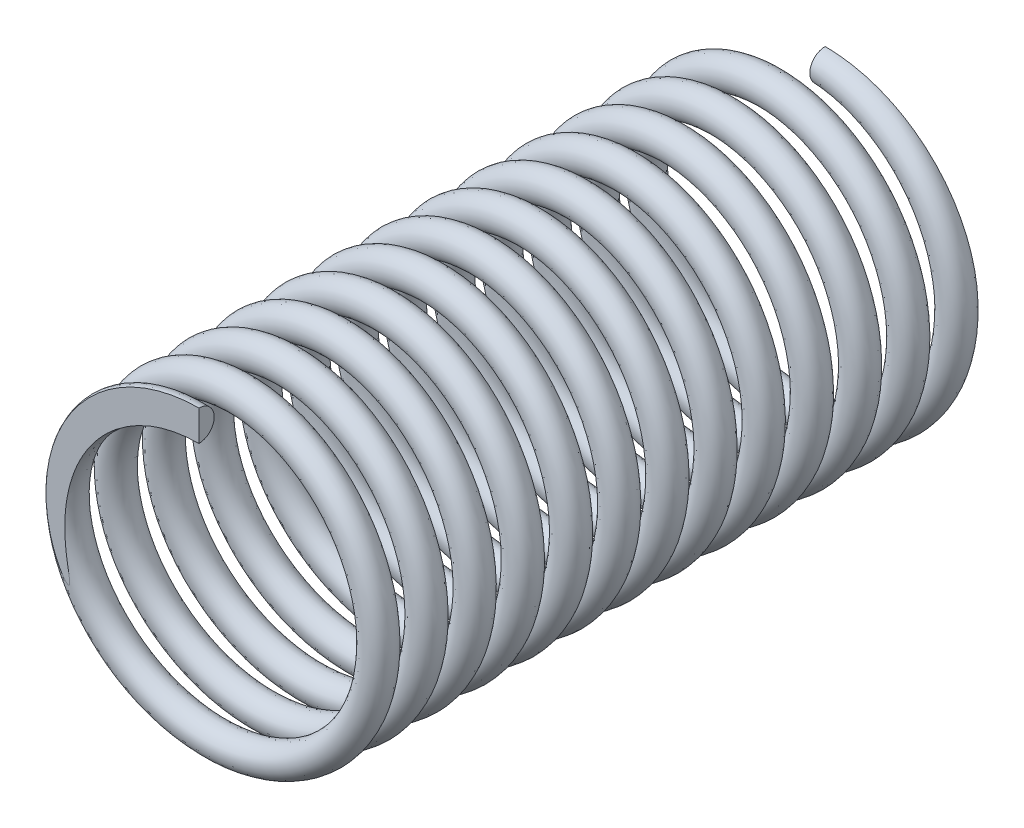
ISO-10303-21;
HEADER;
FILE_DESCRIPTION(('STEP AP214'),'2;1');
FILE_NAME('part.step','',(''),(''),'','','');
FILE_SCHEMA(('AUTOMOTIVE_DESIGN { 1 0 10303 214 1 1 1 1 }'));
ENDSEC;
DATA;
#1=APPLICATION_CONTEXT('core data for automotive mechanical design processes');
#2=APPLICATION_PROTOCOL_DEFINITION('international standard','automotive_design',2000,#1);
#3=PRODUCT_CONTEXT('',#1,'mechanical');
#4=PRODUCT('Part','Part','',(#3));
#5=PRODUCT_RELATED_PRODUCT_CATEGORY('part','',(#4));
#6=PRODUCT_DEFINITION_FORMATION('','',#4);
#7=PRODUCT_DEFINITION_CONTEXT('part definition',#1,'design');
#8=PRODUCT_DEFINITION('design','',#6,#7);
#9=PRODUCT_DEFINITION_SHAPE('','',#8);
#10=(LENGTH_UNIT() NAMED_UNIT(*) SI_UNIT(.MILLI.,.METRE.));
#11=(NAMED_UNIT(*) PLANE_ANGLE_UNIT() SI_UNIT($,.RADIAN.));
#12=(NAMED_UNIT(*) SI_UNIT($,.STERADIAN.) SOLID_ANGLE_UNIT());
#13=UNCERTAINTY_MEASURE_WITH_UNIT(LENGTH_MEASURE(1.E-05),#10,'distance_accuracy_value','');
#14=(GEOMETRIC_REPRESENTATION_CONTEXT(3) GLOBAL_UNCERTAINTY_ASSIGNED_CONTEXT((#13)) GLOBAL_UNIT_ASSIGNED_CONTEXT((#10,
#11,#12)) REPRESENTATION_CONTEXT('',''));
#15=CARTESIAN_POINT('',(0.,0.,0.));
#16=DIRECTION('',(0.,0.,1.));
#17=DIRECTION('',(1.,0.,0.));
#18=AXIS2_PLACEMENT_3D('',#15,#16,#17);
#19=CARTESIAN_POINT('',(0.,5.6,-0.6));
#20=CARTESIAN_POINT('',(1.81955029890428,5.6,-0.50576925));
#21=CARTESIAN_POINT('',(3.29159741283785,4.53049516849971,-0.4115385));
#22=CARTESIAN_POINT('',(4.76364452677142,3.46099033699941,-0.31730775));
#23=CARTESIAN_POINT('',(5.32591649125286,1.73049516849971,-0.223077));
#24=CARTESIAN_POINT('',(5.8881884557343,0.,-0.12884625));
#25=CARTESIAN_POINT('',(5.32591649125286,-1.73049516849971,-0.0346154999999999));
#26=CARTESIAN_POINT('',(4.76364452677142,-3.46099033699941,0.05961525));
#27=CARTESIAN_POINT('',(3.29159741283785,-4.53049516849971,0.153846));
#28=CARTESIAN_POINT('',(1.81955029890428,-5.6,0.24807675));
#29=CARTESIAN_POINT('',(0.,-5.6,0.3423075));
#30=CARTESIAN_POINT('',(-1.81955029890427,-5.6,0.43653825));
#31=CARTESIAN_POINT('',(-3.29159741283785,-4.53049516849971,0.530769));
#32=CARTESIAN_POINT('',(-4.76364452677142,-3.46099033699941,0.62499975));
#33=CARTESIAN_POINT('',(-5.32591649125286,-1.73049516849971,0.7192305));
#34=CARTESIAN_POINT('',(-5.8881884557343,0.,0.81346125));
#35=CARTESIAN_POINT('',(-5.32591649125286,1.7304951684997,0.907692));
#36=CARTESIAN_POINT('',(-4.76364452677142,3.46099033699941,1.00192275));
#37=CARTESIAN_POINT('',(-3.29159741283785,4.53049516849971,1.0961535));
#38=CARTESIAN_POINT('',(-1.81955029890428,5.6,1.19038425));
#39=CARTESIAN_POINT('',(0.,5.6,1.284615));
#40=CARTESIAN_POINT('',(1.81955029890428,5.6,1.37884575));
#41=CARTESIAN_POINT('',(3.29159741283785,4.53049516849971,1.4730765));
#42=CARTESIAN_POINT('',(4.76364452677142,3.46099033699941,1.56730725));
#43=CARTESIAN_POINT('',(5.32591649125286,1.73049516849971,1.661538));
#44=CARTESIAN_POINT('',(5.8881884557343,0.,1.75576875));
#45=CARTESIAN_POINT('',(5.32591649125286,-1.73049516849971,1.8499995));
#46=CARTESIAN_POINT('',(4.76364452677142,-3.46099033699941,1.94423025));
#47=CARTESIAN_POINT('',(3.29159741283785,-4.53049516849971,2.038461));
#48=CARTESIAN_POINT('',(1.81955029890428,-5.6,2.13269175));
#49=CARTESIAN_POINT('',(0.,-5.6,2.2269225));
#50=CARTESIAN_POINT('',(-1.81955029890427,-5.6,2.32115325));
#51=CARTESIAN_POINT('',(-3.29159741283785,-4.53049516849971,2.415384));
#52=CARTESIAN_POINT('',(-4.76364452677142,-3.46099033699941,2.50961475));
#53=CARTESIAN_POINT('',(-5.32591649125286,-1.73049516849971,2.6038455));
#54=CARTESIAN_POINT('',(-5.8881884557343,0.,2.69807625));
#55=CARTESIAN_POINT('',(-5.32591649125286,1.7304951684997,2.792307));
#56=CARTESIAN_POINT('',(-4.76364452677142,3.46099033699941,2.88653775));
#57=CARTESIAN_POINT('',(-3.29159741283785,4.53049516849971,2.9807685));
#58=CARTESIAN_POINT('',(-1.81955029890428,5.6,3.07499925));
#59=CARTESIAN_POINT('',(0.,5.6,3.16923));
#60=CARTESIAN_POINT('',(1.81955029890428,5.6,3.26346075));
#61=CARTESIAN_POINT('',(3.29159741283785,4.53049516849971,3.3576915));
#62=CARTESIAN_POINT('',(4.76364452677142,3.46099033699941,3.45192225));
#63=CARTESIAN_POINT('',(5.32591649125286,1.73049516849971,3.546153));
#64=CARTESIAN_POINT('',(5.8881884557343,0.,3.64038375));
#65=CARTESIAN_POINT('',(5.32591649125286,-1.73049516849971,3.7346145));
#66=CARTESIAN_POINT('',(4.76364452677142,-3.46099033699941,3.82884525));
#67=CARTESIAN_POINT('',(3.29159741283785,-4.53049516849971,3.923076));
#68=CARTESIAN_POINT('',(1.81955029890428,-5.6,4.01730675));
#69=CARTESIAN_POINT('',(0.,-5.6,4.1115375));
#70=CARTESIAN_POINT('',(-1.81955029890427,-5.6,4.20576825));
#71=CARTESIAN_POINT('',(-3.29159741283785,-4.53049516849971,4.299999));
#72=CARTESIAN_POINT('',(-4.76364452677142,-3.46099033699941,4.39422975));
#73=CARTESIAN_POINT('',(-5.32591649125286,-1.73049516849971,4.4884605));
#74=CARTESIAN_POINT('',(-5.8881884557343,0.,4.58269125));
#75=CARTESIAN_POINT('',(-5.32591649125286,1.7304951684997,4.676922));
#76=CARTESIAN_POINT('',(-4.76364452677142,3.46099033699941,4.77115275));
#77=CARTESIAN_POINT('',(-3.29159741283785,4.53049516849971,4.8653835));
#78=CARTESIAN_POINT('',(-1.81955029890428,5.6,4.95961425));
#79=CARTESIAN_POINT('',(0.,5.6,5.053845));
#80=CARTESIAN_POINT('',(1.81955029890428,5.6,5.14807575));
#81=CARTESIAN_POINT('',(3.29159741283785,4.53049516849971,5.2423065));
#82=CARTESIAN_POINT('',(4.76364452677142,3.46099033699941,5.33653725));
#83=CARTESIAN_POINT('',(5.32591649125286,1.73049516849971,5.430768));
#84=CARTESIAN_POINT('',(5.8881884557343,0.,5.52499875));
#85=CARTESIAN_POINT('',(5.32591649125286,-1.73049516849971,5.6192295));
#86=CARTESIAN_POINT('',(4.76364452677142,-3.46099033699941,5.71346025));
#87=CARTESIAN_POINT('',(3.29159741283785,-4.53049516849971,5.807691));
#88=CARTESIAN_POINT('',(1.81955029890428,-5.6,5.90192175));
#89=CARTESIAN_POINT('',(0.,-5.6,5.9961525));
#90=CARTESIAN_POINT('',(-1.81955029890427,-5.6,6.09038325));
#91=CARTESIAN_POINT('',(-3.29159741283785,-4.53049516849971,6.184614));
#92=CARTESIAN_POINT('',(-4.76364452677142,-3.46099033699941,6.27884475));
#93=CARTESIAN_POINT('',(-5.32591649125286,-1.73049516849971,6.3730755));
#94=CARTESIAN_POINT('',(-5.8881884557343,0.,6.46730625));
#95=CARTESIAN_POINT('',(-5.32591649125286,1.7304951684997,6.561537));
#96=CARTESIAN_POINT('',(-4.76364452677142,3.46099033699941,6.65576775));
#97=CARTESIAN_POINT('',(-3.29159741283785,4.53049516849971,6.7499985));
#98=CARTESIAN_POINT('',(-1.81955029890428,5.6,6.84422925));
#99=CARTESIAN_POINT('',(0.,5.6,6.93846));
#100=CARTESIAN_POINT('',(1.81955029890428,5.6,7.03269075));
#101=CARTESIAN_POINT('',(3.29159741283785,4.53049516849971,7.1269215));
#102=CARTESIAN_POINT('',(4.76364452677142,3.46099033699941,7.22115225));
#103=CARTESIAN_POINT('',(5.32591649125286,1.73049516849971,7.315383));
#104=CARTESIAN_POINT('',(5.8881884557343,0.,7.40961375));
#105=CARTESIAN_POINT('',(5.32591649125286,-1.73049516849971,7.5038445));
#106=CARTESIAN_POINT('',(4.76364452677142,-3.46099033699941,7.59807525));
#107=CARTESIAN_POINT('',(3.29159741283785,-4.53049516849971,7.692306));
#108=CARTESIAN_POINT('',(1.81955029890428,-5.6,7.78653675));
#109=CARTESIAN_POINT('',(0.,-5.6,7.8807675));
#110=CARTESIAN_POINT('',(-1.81955029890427,-5.6,7.97499825));
#111=CARTESIAN_POINT('',(-3.29159741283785,-4.53049516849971,8.069229));
#112=CARTESIAN_POINT('',(-4.76364452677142,-3.46099033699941,8.16345975));
#113=CARTESIAN_POINT('',(-5.32591649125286,-1.73049516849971,8.2576905));
#114=CARTESIAN_POINT('',(-5.8881884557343,0.,8.35192125));
#115=CARTESIAN_POINT('',(-5.32591649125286,1.7304951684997,8.446152));
#116=CARTESIAN_POINT('',(-4.76364452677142,3.46099033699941,8.54038275));
#117=CARTESIAN_POINT('',(-3.29159741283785,4.53049516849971,8.6346135));
#118=CARTESIAN_POINT('',(-1.81955029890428,5.6,8.72884425));
#119=CARTESIAN_POINT('',(0.,5.6,8.823075));
#120=CARTESIAN_POINT('',(1.81955029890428,5.6,8.91730575));
#121=CARTESIAN_POINT('',(3.29159741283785,4.53049516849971,9.0115365));
#122=CARTESIAN_POINT('',(4.76364452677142,3.46099033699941,9.10576725));
#123=CARTESIAN_POINT('',(5.32591649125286,1.73049516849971,9.199998));
#124=CARTESIAN_POINT('',(5.8881884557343,0.,9.29422875));
#125=CARTESIAN_POINT('',(5.32591649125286,-1.73049516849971,9.3884595));
#126=CARTESIAN_POINT('',(4.76364452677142,-3.46099033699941,9.48269025));
#127=CARTESIAN_POINT('',(3.29159741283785,-4.53049516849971,9.576921));
#128=CARTESIAN_POINT('',(1.81955029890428,-5.6,9.67115175));
#129=CARTESIAN_POINT('',(0.,-5.6,9.7653825));
#130=CARTESIAN_POINT('',(-1.81955029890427,-5.6,9.85961325));
#131=CARTESIAN_POINT('',(-3.29159741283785,-4.53049516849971,9.953844));
#132=CARTESIAN_POINT('',(-4.76364452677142,-3.46099033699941,10.04807475));
#133=CARTESIAN_POINT('',(-5.32591649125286,-1.73049516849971,10.1423055));
#134=CARTESIAN_POINT('',(-5.8881884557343,0.,10.23653625));
#135=CARTESIAN_POINT('',(-5.32591649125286,1.7304951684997,10.330767));
#136=CARTESIAN_POINT('',(-4.76364452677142,3.46099033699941,10.42499775));
#137=CARTESIAN_POINT('',(-3.29159741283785,4.53049516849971,10.5192285));
#138=CARTESIAN_POINT('',(-1.81955029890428,5.6,10.61345925));
#139=CARTESIAN_POINT('',(0.,5.6,10.70769));
#140=CARTESIAN_POINT('',(1.81955029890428,5.6,10.80192075));
#141=CARTESIAN_POINT('',(3.29159741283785,4.53049516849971,10.8961515));
#142=CARTESIAN_POINT('',(4.76364452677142,3.46099033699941,10.99038225));
#143=CARTESIAN_POINT('',(5.32591649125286,1.73049516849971,11.084613));
#144=CARTESIAN_POINT('',(5.8881884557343,0.,11.17884375));
#145=CARTESIAN_POINT('',(5.32591649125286,-1.73049516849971,11.2730745));
#146=CARTESIAN_POINT('',(4.76364452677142,-3.46099033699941,11.36730525));
#147=CARTESIAN_POINT('',(3.29159741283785,-4.53049516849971,11.461536));
#148=CARTESIAN_POINT('',(1.81955029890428,-5.6,11.55576675));
#149=CARTESIAN_POINT('',(0.,-5.6,11.6499975));
#150=CARTESIAN_POINT('',(-1.81955029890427,-5.6,11.74422825));
#151=CARTESIAN_POINT('',(-3.29159741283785,-4.53049516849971,11.838459));
#152=CARTESIAN_POINT('',(-4.76364452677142,-3.46099033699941,11.93268975));
#153=CARTESIAN_POINT('',(-5.32591649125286,-1.73049516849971,12.0269205));
#154=CARTESIAN_POINT('',(-5.8881884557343,0.,12.12115125));
#155=CARTESIAN_POINT('',(-5.32591649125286,1.7304951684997,12.215382));
#156=CARTESIAN_POINT('',(-4.76364452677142,3.46099033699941,12.30961275));
#157=CARTESIAN_POINT('',(-3.29159741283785,4.53049516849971,12.4038435));
#158=CARTESIAN_POINT('',(-1.81955029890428,5.6,12.49807425));
#159=CARTESIAN_POINT('',(0.,5.6,12.592305));
#160=CARTESIAN_POINT('',(1.81955029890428,5.6,12.68653575));
#161=CARTESIAN_POINT('',(3.29159741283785,4.53049516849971,12.7807665));
#162=CARTESIAN_POINT('',(4.76364452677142,3.46099033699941,12.87499725));
#163=CARTESIAN_POINT('',(5.32591649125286,1.73049516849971,12.969228));
#164=CARTESIAN_POINT('',(5.8881884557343,0.,13.06345875));
#165=CARTESIAN_POINT('',(5.32591649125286,-1.73049516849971,13.1576895));
#166=CARTESIAN_POINT('',(4.76364452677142,-3.46099033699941,13.25192025));
#167=CARTESIAN_POINT('',(3.29159741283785,-4.53049516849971,13.346151));
#168=CARTESIAN_POINT('',(1.81955029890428,-5.6,13.44038175));
#169=CARTESIAN_POINT('',(0.,-5.6,13.5346125));
#170=CARTESIAN_POINT('',(-1.81955029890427,-5.6,13.62884325));
#171=CARTESIAN_POINT('',(-3.29159741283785,-4.53049516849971,13.723074));
#172=CARTESIAN_POINT('',(-4.76364452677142,-3.46099033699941,13.81730475));
#173=CARTESIAN_POINT('',(-5.32591649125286,-1.73049516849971,13.9115355));
#174=CARTESIAN_POINT('',(-5.8881884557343,0.,14.00576625));
#175=CARTESIAN_POINT('',(-5.32591649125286,1.7304951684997,14.099997));
#176=CARTESIAN_POINT('',(-4.76364452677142,3.46099033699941,14.19422775));
#177=CARTESIAN_POINT('',(-3.29159741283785,4.53049516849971,14.2884585));
#178=CARTESIAN_POINT('',(-1.81955029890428,5.6,14.38268925));
#179=CARTESIAN_POINT('',(0.,5.6,14.47692));
#180=CARTESIAN_POINT('',(1.81955029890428,5.6,14.57115075));
#181=CARTESIAN_POINT('',(3.29159741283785,4.53049516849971,14.6653815));
#182=CARTESIAN_POINT('',(4.76364452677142,3.46099033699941,14.75961225));
#183=CARTESIAN_POINT('',(5.32591649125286,1.73049516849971,14.853843));
#184=CARTESIAN_POINT('',(5.8881884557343,0.,14.94807375));
#185=CARTESIAN_POINT('',(5.32591649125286,-1.73049516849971,15.0423045));
#186=CARTESIAN_POINT('',(4.76364452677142,-3.46099033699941,15.13653525));
#187=CARTESIAN_POINT('',(3.29159741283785,-4.53049516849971,15.230766));
#188=CARTESIAN_POINT('',(1.81955029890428,-5.6,15.32499675));
#189=CARTESIAN_POINT('',(0.,-5.6,15.4192275));
#190=CARTESIAN_POINT('',(-1.81955029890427,-5.6,15.51345825));
#191=CARTESIAN_POINT('',(-3.29159741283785,-4.53049516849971,15.607689));
#192=CARTESIAN_POINT('',(-4.76364452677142,-3.46099033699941,15.70191975));
#193=CARTESIAN_POINT('',(-5.32591649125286,-1.73049516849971,15.7961505));
#194=CARTESIAN_POINT('',(-5.8881884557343,0.,15.89038125));
#195=CARTESIAN_POINT('',(-5.32591649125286,1.7304951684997,15.984612));
#196=CARTESIAN_POINT('',(-4.76364452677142,3.46099033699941,16.07884275));
#197=CARTESIAN_POINT('',(-3.29159741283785,4.53049516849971,16.1730735));
#198=CARTESIAN_POINT('',(-1.81955029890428,5.6,16.26730425));
#199=CARTESIAN_POINT('',(0.,5.6,16.361535));
#200=CARTESIAN_POINT('',(1.81955029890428,5.6,16.45576575));
#201=CARTESIAN_POINT('',(3.29159741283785,4.53049516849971,16.5499965));
#202=CARTESIAN_POINT('',(4.76364452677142,3.46099033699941,16.64422725));
#203=CARTESIAN_POINT('',(5.32591649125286,1.73049516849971,16.738458));
#204=CARTESIAN_POINT('',(5.8881884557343,0.,16.83268875));
#205=CARTESIAN_POINT('',(5.32591649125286,-1.73049516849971,16.9269195));
#206=CARTESIAN_POINT('',(4.76364452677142,-3.46099033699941,17.02115025));
#207=CARTESIAN_POINT('',(3.29159741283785,-4.53049516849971,17.115381));
#208=CARTESIAN_POINT('',(1.81955029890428,-5.6,17.20961175));
#209=CARTESIAN_POINT('',(0.,-5.6,17.3038425));
#210=CARTESIAN_POINT('',(-1.81955029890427,-5.6,17.39807325));
#211=CARTESIAN_POINT('',(-3.29159741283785,-4.53049516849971,17.492304));
#212=CARTESIAN_POINT('',(-4.76364452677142,-3.46099033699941,17.58653475));
#213=CARTESIAN_POINT('',(-5.32591649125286,-1.73049516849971,17.6807655));
#214=CARTESIAN_POINT('',(-5.8881884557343,0.,17.77499625));
#215=CARTESIAN_POINT('',(-5.32591649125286,1.7304951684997,17.869227));
#216=CARTESIAN_POINT('',(-4.76364452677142,3.46099033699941,17.96345775));
#217=CARTESIAN_POINT('',(-3.29159741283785,4.53049516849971,18.0576885));
#218=CARTESIAN_POINT('',(-1.81955029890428,5.6,18.15191925));
#219=CARTESIAN_POINT('',(0.,5.6,18.24615));
#220=CARTESIAN_POINT('',(1.81955029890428,5.6,18.34038075));
#221=CARTESIAN_POINT('',(3.29159741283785,4.53049516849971,18.4346115));
#222=CARTESIAN_POINT('',(4.76364452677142,3.46099033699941,18.52884225));
#223=CARTESIAN_POINT('',(5.32591649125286,1.73049516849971,18.623073));
#224=CARTESIAN_POINT('',(5.8881884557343,0.,18.71730375));
#225=CARTESIAN_POINT('',(5.32591649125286,-1.73049516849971,18.8115345));
#226=CARTESIAN_POINT('',(4.76364452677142,-3.46099033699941,18.90576525));
#227=CARTESIAN_POINT('',(3.29159741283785,-4.53049516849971,18.999996));
#228=CARTESIAN_POINT('',(1.81955029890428,-5.6,19.09422675));
#229=CARTESIAN_POINT('',(0.,-5.6,19.1884575));
#230=CARTESIAN_POINT('',(-1.81955029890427,-5.6,19.28268825));
#231=CARTESIAN_POINT('',(-3.29159741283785,-4.53049516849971,19.376919));
#232=CARTESIAN_POINT('',(-4.76364452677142,-3.46099033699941,19.47114975));
#233=CARTESIAN_POINT('',(-5.32591649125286,-1.73049516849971,19.5653805));
#234=CARTESIAN_POINT('',(-5.8881884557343,0.,19.65961125));
#235=CARTESIAN_POINT('',(-5.32591649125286,1.7304951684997,19.753842));
#236=CARTESIAN_POINT('',(-4.76364452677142,3.46099033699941,19.84807275));
#237=CARTESIAN_POINT('',(-3.29159741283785,4.53049516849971,19.9423035));
#238=CARTESIAN_POINT('',(-1.81955029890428,5.6,20.03653425));
#239=CARTESIAN_POINT('',(0.,5.6,20.130765));
#240=CARTESIAN_POINT('',(1.81955029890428,5.6,20.22499575));
#241=CARTESIAN_POINT('',(3.29159741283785,4.53049516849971,20.3192265));
#242=CARTESIAN_POINT('',(4.76364452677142,3.46099033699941,20.41345725));
#243=CARTESIAN_POINT('',(5.32591649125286,1.73049516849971,20.507688));
#244=CARTESIAN_POINT('',(5.8881884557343,0.,20.60191875));
#245=CARTESIAN_POINT('',(5.32591649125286,-1.73049516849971,20.6961495));
#246=CARTESIAN_POINT('',(4.76364452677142,-3.46099033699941,20.79038025));
#247=CARTESIAN_POINT('',(3.29159741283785,-4.53049516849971,20.884611));
#248=CARTESIAN_POINT('',(1.81955029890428,-5.6,20.97884175));
#249=CARTESIAN_POINT('',(0.,-5.6,21.0730725));
#250=CARTESIAN_POINT('',(-1.81955029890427,-5.6,21.16730325));
#251=CARTESIAN_POINT('',(-3.29159741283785,-4.53049516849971,21.261534));
#252=CARTESIAN_POINT('',(-4.76364452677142,-3.46099033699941,21.35576475));
#253=CARTESIAN_POINT('',(-5.32591649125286,-1.73049516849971,21.4499955));
#254=CARTESIAN_POINT('',(-5.8881884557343,0.,21.54422625));
#255=CARTESIAN_POINT('',(-5.32591649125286,1.7304951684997,21.638457));
#256=CARTESIAN_POINT('',(-4.76364452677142,3.46099033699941,21.73268775));
#257=CARTESIAN_POINT('',(-3.29159741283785,4.53049516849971,21.8269185));
#258=CARTESIAN_POINT('',(-1.81955029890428,5.6,21.92114925));
#259=CARTESIAN_POINT('',(0.,5.6,22.01538));
#260=CARTESIAN_POINT('',(1.81955029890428,5.6,22.10961075));
#261=CARTESIAN_POINT('',(3.29159741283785,4.53049516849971,22.2038415));
#262=CARTESIAN_POINT('',(4.76364452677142,3.46099033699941,22.29807225));
#263=CARTESIAN_POINT('',(5.32591649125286,1.73049516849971,22.392303));
#264=CARTESIAN_POINT('',(5.8881884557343,0.,22.48653375));
#265=CARTESIAN_POINT('',(5.32591649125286,-1.73049516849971,22.5807645));
#266=CARTESIAN_POINT('',(4.76364452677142,-3.46099033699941,22.67499525));
#267=CARTESIAN_POINT('',(3.29159741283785,-4.53049516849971,22.769226));
#268=CARTESIAN_POINT('',(1.81955029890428,-5.6,22.86345675));
#269=CARTESIAN_POINT('',(0.,-5.6,22.9576875));
#270=CARTESIAN_POINT('',(-1.81955029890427,-5.6,23.05191825));
#271=CARTESIAN_POINT('',(-3.29159741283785,-4.53049516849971,23.146149));
#272=CARTESIAN_POINT('',(-4.76364452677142,-3.46099033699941,23.24037975));
#273=CARTESIAN_POINT('',(-5.32591649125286,-1.73049516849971,23.3346105));
#274=CARTESIAN_POINT('',(-5.8881884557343,0.,23.42884125));
#275=CARTESIAN_POINT('',(-5.32591649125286,1.7304951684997,23.523072));
#276=CARTESIAN_POINT('',(-4.76364452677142,3.46099033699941,23.61730275));
#277=CARTESIAN_POINT('',(-3.29159741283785,4.53049516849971,23.7115335));
#278=CARTESIAN_POINT('',(-1.81955029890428,5.6,23.80576425));
#279=CARTESIAN_POINT('',(0.,5.6,23.899995));
#280=CARTESIAN_POINT('',(0.,6.8,-0.6));
#281=CARTESIAN_POINT('',(2.20945393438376,6.8,-0.50576925));
#282=CARTESIAN_POINT('',(3.99693971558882,5.50131556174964,-0.4115385));
#283=CARTESIAN_POINT('',(5.78442549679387,4.20263112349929,-0.31730775));
#284=CARTESIAN_POINT('',(6.46718431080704,2.10131556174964,-0.223077));
#285=CARTESIAN_POINT('',(7.14994312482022,0.,-0.12884625));
#286=CARTESIAN_POINT('',(6.46718431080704,-2.10131556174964,-0.0346154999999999));
#287=CARTESIAN_POINT('',(5.78442549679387,-4.20263112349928,0.05961525));
#288=CARTESIAN_POINT('',(3.99693971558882,-5.50131556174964,0.153846));
#289=CARTESIAN_POINT('',(2.20945393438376,-6.8,0.24807675));
#290=CARTESIAN_POINT('',(0.,-6.8,0.3423075));
#291=CARTESIAN_POINT('',(-2.20945393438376,-6.8,0.43653825));
#292=CARTESIAN_POINT('',(-3.99693971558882,-5.50131556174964,0.530769));
#293=CARTESIAN_POINT('',(-5.78442549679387,-4.20263112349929,0.62499975));
#294=CARTESIAN_POINT('',(-6.46718431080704,-2.10131556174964,0.7192305));
#295=CARTESIAN_POINT('',(-7.14994312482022,0.,0.81346125));
#296=CARTESIAN_POINT('',(-6.46718431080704,2.10131556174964,0.907692));
#297=CARTESIAN_POINT('',(-5.78442549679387,4.20263112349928,1.00192275));
#298=CARTESIAN_POINT('',(-3.99693971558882,5.50131556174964,1.0961535));
#299=CARTESIAN_POINT('',(-2.20945393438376,6.8,1.19038425));
#300=CARTESIAN_POINT('',(0.,6.8,1.284615));
#301=CARTESIAN_POINT('',(2.20945393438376,6.8,1.37884575));
#302=CARTESIAN_POINT('',(3.99693971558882,5.50131556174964,1.4730765));
#303=CARTESIAN_POINT('',(5.78442549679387,4.20263112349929,1.56730725));
#304=CARTESIAN_POINT('',(6.46718431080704,2.10131556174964,1.661538));
#305=CARTESIAN_POINT('',(7.14994312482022,0.,1.75576875));
#306=CARTESIAN_POINT('',(6.46718431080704,-2.10131556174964,1.8499995));
#307=CARTESIAN_POINT('',(5.78442549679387,-4.20263112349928,1.94423025));
#308=CARTESIAN_POINT('',(3.99693971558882,-5.50131556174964,2.038461));
#309=CARTESIAN_POINT('',(2.20945393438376,-6.8,2.13269175));
#310=CARTESIAN_POINT('',(0.,-6.8,2.2269225));
#311=CARTESIAN_POINT('',(-2.20945393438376,-6.8,2.32115325));
#312=CARTESIAN_POINT('',(-3.99693971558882,-5.50131556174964,2.415384));
#313=CARTESIAN_POINT('',(-5.78442549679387,-4.20263112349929,2.50961475));
#314=CARTESIAN_POINT('',(-6.46718431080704,-2.10131556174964,2.6038455));
#315=CARTESIAN_POINT('',(-7.14994312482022,0.,2.69807625));
#316=CARTESIAN_POINT('',(-6.46718431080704,2.10131556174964,2.792307));
#317=CARTESIAN_POINT('',(-5.78442549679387,4.20263112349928,2.88653775));
#318=CARTESIAN_POINT('',(-3.99693971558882,5.50131556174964,2.9807685));
#319=CARTESIAN_POINT('',(-2.20945393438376,6.8,3.07499925));
#320=CARTESIAN_POINT('',(0.,6.8,3.16923));
#321=CARTESIAN_POINT('',(2.20945393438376,6.8,3.26346075));
#322=CARTESIAN_POINT('',(3.99693971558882,5.50131556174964,3.3576915));
#323=CARTESIAN_POINT('',(5.78442549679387,4.20263112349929,3.45192225));
#324=CARTESIAN_POINT('',(6.46718431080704,2.10131556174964,3.546153));
#325=CARTESIAN_POINT('',(7.14994312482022,0.,3.64038375));
#326=CARTESIAN_POINT('',(6.46718431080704,-2.10131556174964,3.7346145));
#327=CARTESIAN_POINT('',(5.78442549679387,-4.20263112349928,3.82884525));
#328=CARTESIAN_POINT('',(3.99693971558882,-5.50131556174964,3.923076));
#329=CARTESIAN_POINT('',(2.20945393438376,-6.8,4.01730675));
#330=CARTESIAN_POINT('',(0.,-6.8,4.1115375));
#331=CARTESIAN_POINT('',(-2.20945393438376,-6.8,4.20576825));
#332=CARTESIAN_POINT('',(-3.99693971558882,-5.50131556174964,4.299999));
#333=CARTESIAN_POINT('',(-5.78442549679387,-4.20263112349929,4.39422975));
#334=CARTESIAN_POINT('',(-6.46718431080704,-2.10131556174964,4.4884605));
#335=CARTESIAN_POINT('',(-7.14994312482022,0.,4.58269125));
#336=CARTESIAN_POINT('',(-6.46718431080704,2.10131556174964,4.676922));
#337=CARTESIAN_POINT('',(-5.78442549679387,4.20263112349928,4.77115275));
#338=CARTESIAN_POINT('',(-3.99693971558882,5.50131556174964,4.8653835));
#339=CARTESIAN_POINT('',(-2.20945393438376,6.8,4.95961425));
#340=CARTESIAN_POINT('',(0.,6.8,5.053845));
#341=CARTESIAN_POINT('',(2.20945393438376,6.8,5.14807575));
#342=CARTESIAN_POINT('',(3.99693971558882,5.50131556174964,5.2423065));
#343=CARTESIAN_POINT('',(5.78442549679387,4.20263112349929,5.33653725));
#344=CARTESIAN_POINT('',(6.46718431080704,2.10131556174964,5.430768));
#345=CARTESIAN_POINT('',(7.14994312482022,0.,5.52499875));
#346=CARTESIAN_POINT('',(6.46718431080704,-2.10131556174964,5.6192295));
#347=CARTESIAN_POINT('',(5.78442549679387,-4.20263112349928,5.71346025));
#348=CARTESIAN_POINT('',(3.99693971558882,-5.50131556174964,5.807691));
#349=CARTESIAN_POINT('',(2.20945393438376,-6.8,5.90192175));
#350=CARTESIAN_POINT('',(0.,-6.8,5.9961525));
#351=CARTESIAN_POINT('',(-2.20945393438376,-6.8,6.09038325));
#352=CARTESIAN_POINT('',(-3.99693971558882,-5.50131556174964,6.184614));
#353=CARTESIAN_POINT('',(-5.78442549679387,-4.20263112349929,6.27884475));
#354=CARTESIAN_POINT('',(-6.46718431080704,-2.10131556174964,6.3730755));
#355=CARTESIAN_POINT('',(-7.14994312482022,0.,6.46730625));
#356=CARTESIAN_POINT('',(-6.46718431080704,2.10131556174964,6.561537));
#357=CARTESIAN_POINT('',(-5.78442549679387,4.20263112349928,6.65576775));
#358=CARTESIAN_POINT('',(-3.99693971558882,5.50131556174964,6.7499985));
#359=CARTESIAN_POINT('',(-2.20945393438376,6.8,6.84422925));
#360=CARTESIAN_POINT('',(0.,6.8,6.93846));
#361=CARTESIAN_POINT('',(2.20945393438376,6.8,7.03269075));
#362=CARTESIAN_POINT('',(3.99693971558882,5.50131556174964,7.1269215));
#363=CARTESIAN_POINT('',(5.78442549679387,4.20263112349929,7.22115225));
#364=CARTESIAN_POINT('',(6.46718431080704,2.10131556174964,7.315383));
#365=CARTESIAN_POINT('',(7.14994312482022,0.,7.40961375));
#366=CARTESIAN_POINT('',(6.46718431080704,-2.10131556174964,7.5038445));
#367=CARTESIAN_POINT('',(5.78442549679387,-4.20263112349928,7.59807525));
#368=CARTESIAN_POINT('',(3.99693971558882,-5.50131556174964,7.692306));
#369=CARTESIAN_POINT('',(2.20945393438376,-6.8,7.78653675));
#370=CARTESIAN_POINT('',(0.,-6.8,7.8807675));
#371=CARTESIAN_POINT('',(-2.20945393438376,-6.8,7.97499825));
#372=CARTESIAN_POINT('',(-3.99693971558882,-5.50131556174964,8.069229));
#373=CARTESIAN_POINT('',(-5.78442549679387,-4.20263112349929,8.16345975));
#374=CARTESIAN_POINT('',(-6.46718431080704,-2.10131556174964,8.2576905));
#375=CARTESIAN_POINT('',(-7.14994312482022,0.,8.35192125));
#376=CARTESIAN_POINT('',(-6.46718431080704,2.10131556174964,8.446152));
#377=CARTESIAN_POINT('',(-5.78442549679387,4.20263112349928,8.54038275));
#378=CARTESIAN_POINT('',(-3.99693971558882,5.50131556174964,8.6346135));
#379=CARTESIAN_POINT('',(-2.20945393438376,6.8,8.72884425));
#380=CARTESIAN_POINT('',(0.,6.8,8.823075));
#381=CARTESIAN_POINT('',(2.20945393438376,6.8,8.91730575));
#382=CARTESIAN_POINT('',(3.99693971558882,5.50131556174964,9.0115365));
#383=CARTESIAN_POINT('',(5.78442549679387,4.20263112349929,9.10576725));
#384=CARTESIAN_POINT('',(6.46718431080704,2.10131556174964,9.199998));
#385=CARTESIAN_POINT('',(7.14994312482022,0.,9.29422875));
#386=CARTESIAN_POINT('',(6.46718431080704,-2.10131556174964,9.3884595));
#387=CARTESIAN_POINT('',(5.78442549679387,-4.20263112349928,9.48269025));
#388=CARTESIAN_POINT('',(3.99693971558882,-5.50131556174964,9.576921));
#389=CARTESIAN_POINT('',(2.20945393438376,-6.8,9.67115175));
#390=CARTESIAN_POINT('',(0.,-6.8,9.7653825));
#391=CARTESIAN_POINT('',(-2.20945393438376,-6.8,9.85961325));
#392=CARTESIAN_POINT('',(-3.99693971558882,-5.50131556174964,9.953844));
#393=CARTESIAN_POINT('',(-5.78442549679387,-4.20263112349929,10.04807475));
#394=CARTESIAN_POINT('',(-6.46718431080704,-2.10131556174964,10.1423055));
#395=CARTESIAN_POINT('',(-7.14994312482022,0.,10.23653625));
#396=CARTESIAN_POINT('',(-6.46718431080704,2.10131556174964,10.330767));
#397=CARTESIAN_POINT('',(-5.78442549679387,4.20263112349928,10.42499775));
#398=CARTESIAN_POINT('',(-3.99693971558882,5.50131556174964,10.5192285));
#399=CARTESIAN_POINT('',(-2.20945393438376,6.8,10.61345925));
#400=CARTESIAN_POINT('',(0.,6.8,10.70769));
#401=CARTESIAN_POINT('',(2.20945393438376,6.8,10.80192075));
#402=CARTESIAN_POINT('',(3.99693971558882,5.50131556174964,10.8961515));
#403=CARTESIAN_POINT('',(5.78442549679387,4.20263112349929,10.99038225));
#404=CARTESIAN_POINT('',(6.46718431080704,2.10131556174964,11.084613));
#405=CARTESIAN_POINT('',(7.14994312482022,0.,11.17884375));
#406=CARTESIAN_POINT('',(6.46718431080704,-2.10131556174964,11.2730745));
#407=CARTESIAN_POINT('',(5.78442549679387,-4.20263112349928,11.36730525));
#408=CARTESIAN_POINT('',(3.99693971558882,-5.50131556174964,11.461536));
#409=CARTESIAN_POINT('',(2.20945393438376,-6.8,11.55576675));
#410=CARTESIAN_POINT('',(0.,-6.8,11.6499975));
#411=CARTESIAN_POINT('',(-2.20945393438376,-6.8,11.74422825));
#412=CARTESIAN_POINT('',(-3.99693971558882,-5.50131556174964,11.838459));
#413=CARTESIAN_POINT('',(-5.78442549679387,-4.20263112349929,11.93268975));
#414=CARTESIAN_POINT('',(-6.46718431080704,-2.10131556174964,12.0269205));
#415=CARTESIAN_POINT('',(-7.14994312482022,0.,12.12115125));
#416=CARTESIAN_POINT('',(-6.46718431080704,2.10131556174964,12.215382));
#417=CARTESIAN_POINT('',(-5.78442549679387,4.20263112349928,12.30961275));
#418=CARTESIAN_POINT('',(-3.99693971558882,5.50131556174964,12.4038435));
#419=CARTESIAN_POINT('',(-2.20945393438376,6.8,12.49807425));
#420=CARTESIAN_POINT('',(0.,6.8,12.592305));
#421=CARTESIAN_POINT('',(2.20945393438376,6.8,12.68653575));
#422=CARTESIAN_POINT('',(3.99693971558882,5.50131556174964,12.7807665));
#423=CARTESIAN_POINT('',(5.78442549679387,4.20263112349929,12.87499725));
#424=CARTESIAN_POINT('',(6.46718431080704,2.10131556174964,12.969228));
#425=CARTESIAN_POINT('',(7.14994312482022,0.,13.06345875));
#426=CARTESIAN_POINT('',(6.46718431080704,-2.10131556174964,13.1576895));
#427=CARTESIAN_POINT('',(5.78442549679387,-4.20263112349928,13.25192025));
#428=CARTESIAN_POINT('',(3.99693971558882,-5.50131556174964,13.346151));
#429=CARTESIAN_POINT('',(2.20945393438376,-6.8,13.44038175));
#430=CARTESIAN_POINT('',(0.,-6.8,13.5346125));
#431=CARTESIAN_POINT('',(-2.20945393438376,-6.8,13.62884325));
#432=CARTESIAN_POINT('',(-3.99693971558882,-5.50131556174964,13.723074));
#433=CARTESIAN_POINT('',(-5.78442549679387,-4.20263112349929,13.81730475));
#434=CARTESIAN_POINT('',(-6.46718431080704,-2.10131556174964,13.9115355));
#435=CARTESIAN_POINT('',(-7.14994312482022,0.,14.00576625));
#436=CARTESIAN_POINT('',(-6.46718431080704,2.10131556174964,14.099997));
#437=CARTESIAN_POINT('',(-5.78442549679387,4.20263112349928,14.19422775));
#438=CARTESIAN_POINT('',(-3.99693971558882,5.50131556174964,14.2884585));
#439=CARTESIAN_POINT('',(-2.20945393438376,6.8,14.38268925));
#440=CARTESIAN_POINT('',(0.,6.8,14.47692));
#441=CARTESIAN_POINT('',(2.20945393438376,6.8,14.57115075));
#442=CARTESIAN_POINT('',(3.99693971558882,5.50131556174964,14.6653815));
#443=CARTESIAN_POINT('',(5.78442549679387,4.20263112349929,14.75961225));
#444=CARTESIAN_POINT('',(6.46718431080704,2.10131556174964,14.853843));
#445=CARTESIAN_POINT('',(7.14994312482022,0.,14.94807375));
#446=CARTESIAN_POINT('',(6.46718431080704,-2.10131556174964,15.0423045));
#447=CARTESIAN_POINT('',(5.78442549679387,-4.20263112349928,15.13653525));
#448=CARTESIAN_POINT('',(3.99693971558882,-5.50131556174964,15.230766));
#449=CARTESIAN_POINT('',(2.20945393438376,-6.8,15.32499675));
#450=CARTESIAN_POINT('',(0.,-6.8,15.4192275));
#451=CARTESIAN_POINT('',(-2.20945393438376,-6.8,15.51345825));
#452=CARTESIAN_POINT('',(-3.99693971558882,-5.50131556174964,15.607689));
#453=CARTESIAN_POINT('',(-5.78442549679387,-4.20263112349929,15.70191975));
#454=CARTESIAN_POINT('',(-6.46718431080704,-2.10131556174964,15.7961505));
#455=CARTESIAN_POINT('',(-7.14994312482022,0.,15.89038125));
#456=CARTESIAN_POINT('',(-6.46718431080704,2.10131556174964,15.984612));
#457=CARTESIAN_POINT('',(-5.78442549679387,4.20263112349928,16.07884275));
#458=CARTESIAN_POINT('',(-3.99693971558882,5.50131556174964,16.1730735));
#459=CARTESIAN_POINT('',(-2.20945393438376,6.8,16.26730425));
#460=CARTESIAN_POINT('',(0.,6.8,16.361535));
#461=CARTESIAN_POINT('',(2.20945393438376,6.8,16.45576575));
#462=CARTESIAN_POINT('',(3.99693971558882,5.50131556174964,16.5499965));
#463=CARTESIAN_POINT('',(5.78442549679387,4.20263112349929,16.64422725));
#464=CARTESIAN_POINT('',(6.46718431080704,2.10131556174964,16.738458));
#465=CARTESIAN_POINT('',(7.14994312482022,0.,16.83268875));
#466=CARTESIAN_POINT('',(6.46718431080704,-2.10131556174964,16.9269195));
#467=CARTESIAN_POINT('',(5.78442549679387,-4.20263112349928,17.02115025));
#468=CARTESIAN_POINT('',(3.99693971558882,-5.50131556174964,17.115381));
#469=CARTESIAN_POINT('',(2.20945393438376,-6.8,17.20961175));
#470=CARTESIAN_POINT('',(0.,-6.8,17.3038425));
#471=CARTESIAN_POINT('',(-2.20945393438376,-6.8,17.39807325));
#472=CARTESIAN_POINT('',(-3.99693971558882,-5.50131556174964,17.492304));
#473=CARTESIAN_POINT('',(-5.78442549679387,-4.20263112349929,17.58653475));
#474=CARTESIAN_POINT('',(-6.46718431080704,-2.10131556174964,17.6807655));
#475=CARTESIAN_POINT('',(-7.14994312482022,0.,17.77499625));
#476=CARTESIAN_POINT('',(-6.46718431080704,2.10131556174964,17.869227));
#477=CARTESIAN_POINT('',(-5.78442549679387,4.20263112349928,17.96345775));
#478=CARTESIAN_POINT('',(-3.99693971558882,5.50131556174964,18.0576885));
#479=CARTESIAN_POINT('',(-2.20945393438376,6.8,18.15191925));
#480=CARTESIAN_POINT('',(0.,6.8,18.24615));
#481=CARTESIAN_POINT('',(2.20945393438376,6.8,18.34038075));
#482=CARTESIAN_POINT('',(3.99693971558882,5.50131556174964,18.4346115));
#483=CARTESIAN_POINT('',(5.78442549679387,4.20263112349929,18.52884225));
#484=CARTESIAN_POINT('',(6.46718431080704,2.10131556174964,18.623073));
#485=CARTESIAN_POINT('',(7.14994312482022,0.,18.71730375));
#486=CARTESIAN_POINT('',(6.46718431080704,-2.10131556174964,18.8115345));
#487=CARTESIAN_POINT('',(5.78442549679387,-4.20263112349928,18.90576525));
#488=CARTESIAN_POINT('',(3.99693971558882,-5.50131556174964,18.999996));
#489=CARTESIAN_POINT('',(2.20945393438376,-6.8,19.09422675));
#490=CARTESIAN_POINT('',(0.,-6.8,19.1884575));
#491=CARTESIAN_POINT('',(-2.20945393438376,-6.8,19.28268825));
#492=CARTESIAN_POINT('',(-3.99693971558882,-5.50131556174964,19.376919));
#493=CARTESIAN_POINT('',(-5.78442549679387,-4.20263112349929,19.47114975));
#494=CARTESIAN_POINT('',(-6.46718431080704,-2.10131556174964,19.5653805));
#495=CARTESIAN_POINT('',(-7.14994312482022,0.,19.65961125));
#496=CARTESIAN_POINT('',(-6.46718431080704,2.10131556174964,19.753842));
#497=CARTESIAN_POINT('',(-5.78442549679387,4.20263112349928,19.84807275));
#498=CARTESIAN_POINT('',(-3.99693971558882,5.50131556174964,19.9423035));
#499=CARTESIAN_POINT('',(-2.20945393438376,6.8,20.03653425));
#500=CARTESIAN_POINT('',(0.,6.8,20.130765));
#501=CARTESIAN_POINT('',(2.20945393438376,6.8,20.22499575));
#502=CARTESIAN_POINT('',(3.99693971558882,5.50131556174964,20.3192265));
#503=CARTESIAN_POINT('',(5.78442549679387,4.20263112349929,20.41345725));
#504=CARTESIAN_POINT('',(6.46718431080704,2.10131556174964,20.507688));
#505=CARTESIAN_POINT('',(7.14994312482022,0.,20.60191875));
#506=CARTESIAN_POINT('',(6.46718431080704,-2.10131556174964,20.6961495));
#507=CARTESIAN_POINT('',(5.78442549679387,-4.20263112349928,20.79038025));
#508=CARTESIAN_POINT('',(3.99693971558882,-5.50131556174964,20.884611));
#509=CARTESIAN_POINT('',(2.20945393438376,-6.8,20.97884175));
#510=CARTESIAN_POINT('',(0.,-6.8,21.0730725));
#511=CARTESIAN_POINT('',(-2.20945393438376,-6.8,21.16730325));
#512=CARTESIAN_POINT('',(-3.99693971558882,-5.50131556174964,21.261534));
#513=CARTESIAN_POINT('',(-5.78442549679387,-4.20263112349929,21.35576475));
#514=CARTESIAN_POINT('',(-6.46718431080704,-2.10131556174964,21.4499955));
#515=CARTESIAN_POINT('',(-7.14994312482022,0.,21.54422625));
#516=CARTESIAN_POINT('',(-6.46718431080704,2.10131556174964,21.638457));
#517=CARTESIAN_POINT('',(-5.78442549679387,4.20263112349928,21.73268775));
#518=CARTESIAN_POINT('',(-3.99693971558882,5.50131556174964,21.8269185));
#519=CARTESIAN_POINT('',(-2.20945393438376,6.8,21.92114925));
#520=CARTESIAN_POINT('',(0.,6.8,22.01538));
#521=CARTESIAN_POINT('',(2.20945393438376,6.8,22.10961075));
#522=CARTESIAN_POINT('',(3.99693971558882,5.50131556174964,22.2038415));
#523=CARTESIAN_POINT('',(5.78442549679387,4.20263112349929,22.29807225));
#524=CARTESIAN_POINT('',(6.46718431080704,2.10131556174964,22.392303));
#525=CARTESIAN_POINT('',(7.14994312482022,0.,22.48653375));
#526=CARTESIAN_POINT('',(6.46718431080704,-2.10131556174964,22.5807645));
#527=CARTESIAN_POINT('',(5.78442549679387,-4.20263112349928,22.67499525));
#528=CARTESIAN_POINT('',(3.99693971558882,-5.50131556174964,22.769226));
#529=CARTESIAN_POINT('',(2.20945393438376,-6.8,22.86345675));
#530=CARTESIAN_POINT('',(0.,-6.8,22.9576875));
#531=CARTESIAN_POINT('',(-2.20945393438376,-6.8,23.05191825));
#532=CARTESIAN_POINT('',(-3.99693971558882,-5.50131556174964,23.146149));
#533=CARTESIAN_POINT('',(-5.78442549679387,-4.20263112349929,23.24037975));
#534=CARTESIAN_POINT('',(-6.46718431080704,-2.10131556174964,23.3346105));
#535=CARTESIAN_POINT('',(-7.14994312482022,0.,23.42884125));
#536=CARTESIAN_POINT('',(-6.46718431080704,2.10131556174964,23.523072));
#537=CARTESIAN_POINT('',(-5.78442549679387,4.20263112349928,23.61730275));
#538=CARTESIAN_POINT('',(-3.99693971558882,5.50131556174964,23.7115335));
#539=CARTESIAN_POINT('',(-2.20945393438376,6.8,23.80576425));
#540=CARTESIAN_POINT('',(0.,6.8,23.899995));
#541=CARTESIAN_POINT('',(0.,6.8,0.6));
#542=CARTESIAN_POINT('',(2.20945393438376,6.8,0.69423075));
#543=CARTESIAN_POINT('',(3.99693971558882,5.50131556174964,0.7884615));
#544=CARTESIAN_POINT('',(5.78442549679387,4.20263112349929,0.88269225));
#545=CARTESIAN_POINT('',(6.46718431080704,2.10131556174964,0.976923));
#546=CARTESIAN_POINT('',(7.14994312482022,0.,1.07115375));
#547=CARTESIAN_POINT('',(6.46718431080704,-2.10131556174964,1.1653845));
#548=CARTESIAN_POINT('',(5.78442549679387,-4.20263112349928,1.25961525));
#549=CARTESIAN_POINT('',(3.99693971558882,-5.50131556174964,1.353846));
#550=CARTESIAN_POINT('',(2.20945393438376,-6.8,1.44807675));
#551=CARTESIAN_POINT('',(0.,-6.8,1.5423075));
#552=CARTESIAN_POINT('',(-2.20945393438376,-6.8,1.63653825));
#553=CARTESIAN_POINT('',(-3.99693971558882,-5.50131556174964,1.730769));
#554=CARTESIAN_POINT('',(-5.78442549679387,-4.20263112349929,1.82499975));
#555=CARTESIAN_POINT('',(-6.46718431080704,-2.10131556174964,1.9192305));
#556=CARTESIAN_POINT('',(-7.14994312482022,0.,2.01346125));
#557=CARTESIAN_POINT('',(-6.46718431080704,2.10131556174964,2.107692));
#558=CARTESIAN_POINT('',(-5.78442549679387,4.20263112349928,2.20192275));
#559=CARTESIAN_POINT('',(-3.99693971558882,5.50131556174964,2.2961535));
#560=CARTESIAN_POINT('',(-2.20945393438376,6.8,2.39038425));
#561=CARTESIAN_POINT('',(0.,6.8,2.484615));
#562=CARTESIAN_POINT('',(2.20945393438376,6.8,2.57884575));
#563=CARTESIAN_POINT('',(3.99693971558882,5.50131556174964,2.6730765));
#564=CARTESIAN_POINT('',(5.78442549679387,4.20263112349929,2.76730725));
#565=CARTESIAN_POINT('',(6.46718431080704,2.10131556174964,2.861538));
#566=CARTESIAN_POINT('',(7.14994312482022,0.,2.95576875));
#567=CARTESIAN_POINT('',(6.46718431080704,-2.10131556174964,3.0499995));
#568=CARTESIAN_POINT('',(5.78442549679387,-4.20263112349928,3.14423025));
#569=CARTESIAN_POINT('',(3.99693971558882,-5.50131556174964,3.238461));
#570=CARTESIAN_POINT('',(2.20945393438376,-6.8,3.33269175));
#571=CARTESIAN_POINT('',(0.,-6.8,3.4269225));
#572=CARTESIAN_POINT('',(-2.20945393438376,-6.8,3.52115325));
#573=CARTESIAN_POINT('',(-3.99693971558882,-5.50131556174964,3.615384));
#574=CARTESIAN_POINT('',(-5.78442549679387,-4.20263112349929,3.70961475));
#575=CARTESIAN_POINT('',(-6.46718431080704,-2.10131556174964,3.8038455));
#576=CARTESIAN_POINT('',(-7.14994312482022,0.,3.89807625));
#577=CARTESIAN_POINT('',(-6.46718431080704,2.10131556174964,3.992307));
#578=CARTESIAN_POINT('',(-5.78442549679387,4.20263112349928,4.08653775));
#579=CARTESIAN_POINT('',(-3.99693971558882,5.50131556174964,4.1807685));
#580=CARTESIAN_POINT('',(-2.20945393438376,6.8,4.27499925));
#581=CARTESIAN_POINT('',(0.,6.8,4.36923));
#582=CARTESIAN_POINT('',(2.20945393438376,6.8,4.46346075));
#583=CARTESIAN_POINT('',(3.99693971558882,5.50131556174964,4.5576915));
#584=CARTESIAN_POINT('',(5.78442549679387,4.20263112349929,4.65192225));
#585=CARTESIAN_POINT('',(6.46718431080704,2.10131556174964,4.746153));
#586=CARTESIAN_POINT('',(7.14994312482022,0.,4.84038375));
#587=CARTESIAN_POINT('',(6.46718431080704,-2.10131556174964,4.9346145));
#588=CARTESIAN_POINT('',(5.78442549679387,-4.20263112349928,5.02884525));
#589=CARTESIAN_POINT('',(3.99693971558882,-5.50131556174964,5.123076));
#590=CARTESIAN_POINT('',(2.20945393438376,-6.8,5.21730675));
#591=CARTESIAN_POINT('',(0.,-6.8,5.3115375));
#592=CARTESIAN_POINT('',(-2.20945393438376,-6.8,5.40576825));
#593=CARTESIAN_POINT('',(-3.99693971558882,-5.50131556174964,5.499999));
#594=CARTESIAN_POINT('',(-5.78442549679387,-4.20263112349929,5.59422975));
#595=CARTESIAN_POINT('',(-6.46718431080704,-2.10131556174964,5.6884605));
#596=CARTESIAN_POINT('',(-7.14994312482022,0.,5.78269125));
#597=CARTESIAN_POINT('',(-6.46718431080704,2.10131556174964,5.876922));
#598=CARTESIAN_POINT('',(-5.78442549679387,4.20263112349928,5.97115275));
#599=CARTESIAN_POINT('',(-3.99693971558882,5.50131556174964,6.0653835));
#600=CARTESIAN_POINT('',(-2.20945393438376,6.8,6.15961425));
#601=CARTESIAN_POINT('',(0.,6.8,6.253845));
#602=CARTESIAN_POINT('',(2.20945393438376,6.8,6.34807575));
#603=CARTESIAN_POINT('',(3.99693971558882,5.50131556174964,6.4423065));
#604=CARTESIAN_POINT('',(5.78442549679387,4.20263112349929,6.53653725));
#605=CARTESIAN_POINT('',(6.46718431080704,2.10131556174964,6.630768));
#606=CARTESIAN_POINT('',(7.14994312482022,0.,6.72499875));
#607=CARTESIAN_POINT('',(6.46718431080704,-2.10131556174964,6.8192295));
#608=CARTESIAN_POINT('',(5.78442549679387,-4.20263112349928,6.91346025));
#609=CARTESIAN_POINT('',(3.99693971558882,-5.50131556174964,7.007691));
#610=CARTESIAN_POINT('',(2.20945393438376,-6.8,7.10192175));
#611=CARTESIAN_POINT('',(0.,-6.8,7.1961525));
#612=CARTESIAN_POINT('',(-2.20945393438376,-6.8,7.29038325));
#613=CARTESIAN_POINT('',(-3.99693971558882,-5.50131556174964,7.384614));
#614=CARTESIAN_POINT('',(-5.78442549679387,-4.20263112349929,7.47884475));
#615=CARTESIAN_POINT('',(-6.46718431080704,-2.10131556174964,7.5730755));
#616=CARTESIAN_POINT('',(-7.14994312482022,0.,7.66730625));
#617=CARTESIAN_POINT('',(-6.46718431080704,2.10131556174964,7.761537));
#618=CARTESIAN_POINT('',(-5.78442549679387,4.20263112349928,7.85576775));
#619=CARTESIAN_POINT('',(-3.99693971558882,5.50131556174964,7.9499985));
#620=CARTESIAN_POINT('',(-2.20945393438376,6.8,8.04422925));
#621=CARTESIAN_POINT('',(0.,6.8,8.13846));
#622=CARTESIAN_POINT('',(2.20945393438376,6.8,8.23269075));
#623=CARTESIAN_POINT('',(3.99693971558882,5.50131556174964,8.3269215));
#624=CARTESIAN_POINT('',(5.78442549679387,4.20263112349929,8.42115225));
#625=CARTESIAN_POINT('',(6.46718431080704,2.10131556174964,8.515383));
#626=CARTESIAN_POINT('',(7.14994312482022,0.,8.60961375));
#627=CARTESIAN_POINT('',(6.46718431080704,-2.10131556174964,8.7038445));
#628=CARTESIAN_POINT('',(5.78442549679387,-4.20263112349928,8.79807525));
#629=CARTESIAN_POINT('',(3.99693971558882,-5.50131556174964,8.892306));
#630=CARTESIAN_POINT('',(2.20945393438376,-6.8,8.98653675));
#631=CARTESIAN_POINT('',(0.,-6.8,9.0807675));
#632=CARTESIAN_POINT('',(-2.20945393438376,-6.8,9.17499825));
#633=CARTESIAN_POINT('',(-3.99693971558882,-5.50131556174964,9.269229));
#634=CARTESIAN_POINT('',(-5.78442549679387,-4.20263112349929,9.36345975));
#635=CARTESIAN_POINT('',(-6.46718431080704,-2.10131556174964,9.4576905));
#636=CARTESIAN_POINT('',(-7.14994312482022,0.,9.55192125));
#637=CARTESIAN_POINT('',(-6.46718431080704,2.10131556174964,9.646152));
#638=CARTESIAN_POINT('',(-5.78442549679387,4.20263112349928,9.74038275));
#639=CARTESIAN_POINT('',(-3.99693971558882,5.50131556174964,9.8346135));
#640=CARTESIAN_POINT('',(-2.20945393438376,6.8,9.92884425));
#641=CARTESIAN_POINT('',(0.,6.8,10.023075));
#642=CARTESIAN_POINT('',(2.20945393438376,6.8,10.11730575));
#643=CARTESIAN_POINT('',(3.99693971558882,5.50131556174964,10.2115365));
#644=CARTESIAN_POINT('',(5.78442549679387,4.20263112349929,10.30576725));
#645=CARTESIAN_POINT('',(6.46718431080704,2.10131556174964,10.399998));
#646=CARTESIAN_POINT('',(7.14994312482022,0.,10.49422875));
#647=CARTESIAN_POINT('',(6.46718431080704,-2.10131556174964,10.5884595));
#648=CARTESIAN_POINT('',(5.78442549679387,-4.20263112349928,10.68269025));
#649=CARTESIAN_POINT('',(3.99693971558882,-5.50131556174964,10.776921));
#650=CARTESIAN_POINT('',(2.20945393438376,-6.8,10.87115175));
#651=CARTESIAN_POINT('',(0.,-6.8,10.9653825));
#652=CARTESIAN_POINT('',(-2.20945393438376,-6.8,11.05961325));
#653=CARTESIAN_POINT('',(-3.99693971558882,-5.50131556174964,11.153844));
#654=CARTESIAN_POINT('',(-5.78442549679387,-4.20263112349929,11.24807475));
#655=CARTESIAN_POINT('',(-6.46718431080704,-2.10131556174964,11.3423055));
#656=CARTESIAN_POINT('',(-7.14994312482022,0.,11.43653625));
#657=CARTESIAN_POINT('',(-6.46718431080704,2.10131556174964,11.530767));
#658=CARTESIAN_POINT('',(-5.78442549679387,4.20263112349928,11.62499775));
#659=CARTESIAN_POINT('',(-3.99693971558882,5.50131556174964,11.7192285));
#660=CARTESIAN_POINT('',(-2.20945393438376,6.8,11.81345925));
#661=CARTESIAN_POINT('',(0.,6.8,11.90769));
#662=CARTESIAN_POINT('',(2.20945393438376,6.8,12.00192075));
#663=CARTESIAN_POINT('',(3.99693971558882,5.50131556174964,12.0961515));
#664=CARTESIAN_POINT('',(5.78442549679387,4.20263112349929,12.19038225));
#665=CARTESIAN_POINT('',(6.46718431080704,2.10131556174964,12.284613));
#666=CARTESIAN_POINT('',(7.14994312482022,0.,12.37884375));
#667=CARTESIAN_POINT('',(6.46718431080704,-2.10131556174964,12.4730745));
#668=CARTESIAN_POINT('',(5.78442549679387,-4.20263112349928,12.56730525));
#669=CARTESIAN_POINT('',(3.99693971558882,-5.50131556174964,12.661536));
#670=CARTESIAN_POINT('',(2.20945393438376,-6.8,12.75576675));
#671=CARTESIAN_POINT('',(0.,-6.8,12.8499975));
#672=CARTESIAN_POINT('',(-2.20945393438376,-6.8,12.94422825));
#673=CARTESIAN_POINT('',(-3.99693971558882,-5.50131556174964,13.038459));
#674=CARTESIAN_POINT('',(-5.78442549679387,-4.20263112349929,13.13268975));
#675=CARTESIAN_POINT('',(-6.46718431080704,-2.10131556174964,13.2269205));
#676=CARTESIAN_POINT('',(-7.14994312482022,0.,13.32115125));
#677=CARTESIAN_POINT('',(-6.46718431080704,2.10131556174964,13.415382));
#678=CARTESIAN_POINT('',(-5.78442549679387,4.20263112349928,13.50961275));
#679=CARTESIAN_POINT('',(-3.99693971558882,5.50131556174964,13.6038435));
#680=CARTESIAN_POINT('',(-2.20945393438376,6.8,13.69807425));
#681=CARTESIAN_POINT('',(0.,6.8,13.792305));
#682=CARTESIAN_POINT('',(2.20945393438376,6.8,13.88653575));
#683=CARTESIAN_POINT('',(3.99693971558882,5.50131556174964,13.9807665));
#684=CARTESIAN_POINT('',(5.78442549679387,4.20263112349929,14.07499725));
#685=CARTESIAN_POINT('',(6.46718431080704,2.10131556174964,14.169228));
#686=CARTESIAN_POINT('',(7.14994312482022,0.,14.26345875));
#687=CARTESIAN_POINT('',(6.46718431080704,-2.10131556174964,14.3576895));
#688=CARTESIAN_POINT('',(5.78442549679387,-4.20263112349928,14.45192025));
#689=CARTESIAN_POINT('',(3.99693971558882,-5.50131556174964,14.546151));
#690=CARTESIAN_POINT('',(2.20945393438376,-6.8,14.64038175));
#691=CARTESIAN_POINT('',(0.,-6.8,14.7346125));
#692=CARTESIAN_POINT('',(-2.20945393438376,-6.8,14.82884325));
#693=CARTESIAN_POINT('',(-3.99693971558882,-5.50131556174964,14.923074));
#694=CARTESIAN_POINT('',(-5.78442549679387,-4.20263112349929,15.01730475));
#695=CARTESIAN_POINT('',(-6.46718431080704,-2.10131556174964,15.1115355));
#696=CARTESIAN_POINT('',(-7.14994312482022,0.,15.20576625));
#697=CARTESIAN_POINT('',(-6.46718431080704,2.10131556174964,15.299997));
#698=CARTESIAN_POINT('',(-5.78442549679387,4.20263112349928,15.39422775));
#699=CARTESIAN_POINT('',(-3.99693971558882,5.50131556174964,15.4884585));
#700=CARTESIAN_POINT('',(-2.20945393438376,6.8,15.58268925));
#701=CARTESIAN_POINT('',(0.,6.8,15.67692));
#702=CARTESIAN_POINT('',(2.20945393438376,6.8,15.77115075));
#703=CARTESIAN_POINT('',(3.99693971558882,5.50131556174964,15.8653815));
#704=CARTESIAN_POINT('',(5.78442549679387,4.20263112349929,15.95961225));
#705=CARTESIAN_POINT('',(6.46718431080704,2.10131556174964,16.053843));
#706=CARTESIAN_POINT('',(7.14994312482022,0.,16.14807375));
#707=CARTESIAN_POINT('',(6.46718431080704,-2.10131556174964,16.2423045));
#708=CARTESIAN_POINT('',(5.78442549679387,-4.20263112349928,16.33653525));
#709=CARTESIAN_POINT('',(3.99693971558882,-5.50131556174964,16.430766));
#710=CARTESIAN_POINT('',(2.20945393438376,-6.8,16.52499675));
#711=CARTESIAN_POINT('',(0.,-6.8,16.6192275));
#712=CARTESIAN_POINT('',(-2.20945393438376,-6.8,16.71345825));
#713=CARTESIAN_POINT('',(-3.99693971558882,-5.50131556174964,16.807689));
#714=CARTESIAN_POINT('',(-5.78442549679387,-4.20263112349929,16.90191975));
#715=CARTESIAN_POINT('',(-6.46718431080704,-2.10131556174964,16.9961505));
#716=CARTESIAN_POINT('',(-7.14994312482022,0.,17.09038125));
#717=CARTESIAN_POINT('',(-6.46718431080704,2.10131556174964,17.184612));
#718=CARTESIAN_POINT('',(-5.78442549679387,4.20263112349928,17.27884275));
#719=CARTESIAN_POINT('',(-3.99693971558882,5.50131556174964,17.3730735));
#720=CARTESIAN_POINT('',(-2.20945393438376,6.8,17.46730425));
#721=CARTESIAN_POINT('',(0.,6.8,17.561535));
#722=CARTESIAN_POINT('',(2.20945393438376,6.8,17.65576575));
#723=CARTESIAN_POINT('',(3.99693971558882,5.50131556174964,17.7499965));
#724=CARTESIAN_POINT('',(5.78442549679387,4.20263112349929,17.84422725));
#725=CARTESIAN_POINT('',(6.46718431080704,2.10131556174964,17.938458));
#726=CARTESIAN_POINT('',(7.14994312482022,0.,18.03268875));
#727=CARTESIAN_POINT('',(6.46718431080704,-2.10131556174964,18.1269195));
#728=CARTESIAN_POINT('',(5.78442549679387,-4.20263112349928,18.22115025));
#729=CARTESIAN_POINT('',(3.99693971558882,-5.50131556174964,18.315381));
#730=CARTESIAN_POINT('',(2.20945393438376,-6.8,18.40961175));
#731=CARTESIAN_POINT('',(0.,-6.8,18.5038425));
#732=CARTESIAN_POINT('',(-2.20945393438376,-6.8,18.59807325));
#733=CARTESIAN_POINT('',(-3.99693971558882,-5.50131556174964,18.692304));
#734=CARTESIAN_POINT('',(-5.78442549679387,-4.20263112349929,18.78653475));
#735=CARTESIAN_POINT('',(-6.46718431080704,-2.10131556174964,18.8807655));
#736=CARTESIAN_POINT('',(-7.14994312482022,0.,18.97499625));
#737=CARTESIAN_POINT('',(-6.46718431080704,2.10131556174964,19.069227));
#738=CARTESIAN_POINT('',(-5.78442549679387,4.20263112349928,19.16345775));
#739=CARTESIAN_POINT('',(-3.99693971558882,5.50131556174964,19.2576885));
#740=CARTESIAN_POINT('',(-2.20945393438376,6.8,19.35191925));
#741=CARTESIAN_POINT('',(0.,6.8,19.44615));
#742=CARTESIAN_POINT('',(2.20945393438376,6.8,19.54038075));
#743=CARTESIAN_POINT('',(3.99693971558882,5.50131556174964,19.6346115));
#744=CARTESIAN_POINT('',(5.78442549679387,4.20263112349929,19.72884225));
#745=CARTESIAN_POINT('',(6.46718431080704,2.10131556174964,19.823073));
#746=CARTESIAN_POINT('',(7.14994312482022,0.,19.91730375));
#747=CARTESIAN_POINT('',(6.46718431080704,-2.10131556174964,20.0115345));
#748=CARTESIAN_POINT('',(5.78442549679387,-4.20263112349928,20.10576525));
#749=CARTESIAN_POINT('',(3.99693971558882,-5.50131556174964,20.199996));
#750=CARTESIAN_POINT('',(2.20945393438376,-6.8,20.29422675));
#751=CARTESIAN_POINT('',(0.,-6.8,20.3884575));
#752=CARTESIAN_POINT('',(-2.20945393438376,-6.8,20.48268825));
#753=CARTESIAN_POINT('',(-3.99693971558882,-5.50131556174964,20.576919));
#754=CARTESIAN_POINT('',(-5.78442549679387,-4.20263112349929,20.67114975));
#755=CARTESIAN_POINT('',(-6.46718431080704,-2.10131556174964,20.7653805));
#756=CARTESIAN_POINT('',(-7.14994312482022,0.,20.85961125));
#757=CARTESIAN_POINT('',(-6.46718431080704,2.10131556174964,20.953842));
#758=CARTESIAN_POINT('',(-5.78442549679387,4.20263112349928,21.04807275));
#759=CARTESIAN_POINT('',(-3.99693971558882,5.50131556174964,21.1423035));
#760=CARTESIAN_POINT('',(-2.20945393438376,6.8,21.23653425));
#761=CARTESIAN_POINT('',(0.,6.8,21.330765));
#762=CARTESIAN_POINT('',(2.20945393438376,6.8,21.42499575));
#763=CARTESIAN_POINT('',(3.99693971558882,5.50131556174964,21.5192265));
#764=CARTESIAN_POINT('',(5.78442549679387,4.20263112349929,21.61345725));
#765=CARTESIAN_POINT('',(6.46718431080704,2.10131556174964,21.707688));
#766=CARTESIAN_POINT('',(7.14994312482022,0.,21.80191875));
#767=CARTESIAN_POINT('',(6.46718431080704,-2.10131556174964,21.8961495));
#768=CARTESIAN_POINT('',(5.78442549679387,-4.20263112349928,21.99038025));
#769=CARTESIAN_POINT('',(3.99693971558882,-5.50131556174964,22.084611));
#770=CARTESIAN_POINT('',(2.20945393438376,-6.8,22.17884175));
#771=CARTESIAN_POINT('',(0.,-6.8,22.2730725));
#772=CARTESIAN_POINT('',(-2.20945393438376,-6.8,22.36730325));
#773=CARTESIAN_POINT('',(-3.99693971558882,-5.50131556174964,22.461534));
#774=CARTESIAN_POINT('',(-5.78442549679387,-4.20263112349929,22.55576475));
#775=CARTESIAN_POINT('',(-6.46718431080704,-2.10131556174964,22.6499955));
#776=CARTESIAN_POINT('',(-7.14994312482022,0.,22.74422625));
#777=CARTESIAN_POINT('',(-6.46718431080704,2.10131556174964,22.838457));
#778=CARTESIAN_POINT('',(-5.78442549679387,4.20263112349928,22.93268775));
#779=CARTESIAN_POINT('',(-3.99693971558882,5.50131556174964,23.0269185));
#780=CARTESIAN_POINT('',(-2.20945393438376,6.8,23.12114925));
#781=CARTESIAN_POINT('',(0.,6.8,23.21538));
#782=CARTESIAN_POINT('',(2.20945393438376,6.8,23.30961075));
#783=CARTESIAN_POINT('',(3.99693971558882,5.50131556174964,23.4038415));
#784=CARTESIAN_POINT('',(5.78442549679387,4.20263112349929,23.49807225));
#785=CARTESIAN_POINT('',(6.46718431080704,2.10131556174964,23.592303));
#786=CARTESIAN_POINT('',(7.14994312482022,0.,23.68653375));
#787=CARTESIAN_POINT('',(6.46718431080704,-2.10131556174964,23.7807645));
#788=CARTESIAN_POINT('',(5.78442549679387,-4.20263112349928,23.87499525));
#789=CARTESIAN_POINT('',(3.99693971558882,-5.50131556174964,23.969226));
#790=CARTESIAN_POINT('',(2.20945393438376,-6.8,24.06345675));
#791=CARTESIAN_POINT('',(0.,-6.8,24.1576875));
#792=CARTESIAN_POINT('',(-2.20945393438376,-6.8,24.25191825));
#793=CARTESIAN_POINT('',(-3.99693971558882,-5.50131556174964,24.346149));
#794=CARTESIAN_POINT('',(-5.78442549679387,-4.20263112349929,24.44037975));
#795=CARTESIAN_POINT('',(-6.46718431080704,-2.10131556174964,24.5346105));
#796=CARTESIAN_POINT('',(-7.14994312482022,0.,24.62884125));
#797=CARTESIAN_POINT('',(-6.46718431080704,2.10131556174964,24.723072));
#798=CARTESIAN_POINT('',(-5.78442549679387,4.20263112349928,24.81730275));
#799=CARTESIAN_POINT('',(-3.99693971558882,5.50131556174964,24.9115335));
#800=CARTESIAN_POINT('',(-2.20945393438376,6.8,25.00576425));
#801=CARTESIAN_POINT('',(0.,6.8,25.099995));
#802=CARTESIAN_POINT('',(0.,5.6,0.6));
#803=CARTESIAN_POINT('',(1.81955029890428,5.6,0.69423075));
#804=CARTESIAN_POINT('',(3.29159741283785,4.53049516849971,0.7884615));
#805=CARTESIAN_POINT('',(4.76364452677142,3.46099033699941,0.88269225));
#806=CARTESIAN_POINT('',(5.32591649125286,1.73049516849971,0.976923));
#807=CARTESIAN_POINT('',(5.8881884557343,0.,1.07115375));
#808=CARTESIAN_POINT('',(5.32591649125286,-1.73049516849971,1.1653845));
#809=CARTESIAN_POINT('',(4.76364452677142,-3.46099033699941,1.25961525));
#810=CARTESIAN_POINT('',(3.29159741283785,-4.53049516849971,1.353846));
#811=CARTESIAN_POINT('',(1.81955029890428,-5.6,1.44807675));
#812=CARTESIAN_POINT('',(0.,-5.6,1.5423075));
#813=CARTESIAN_POINT('',(-1.81955029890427,-5.6,1.63653825));
#814=CARTESIAN_POINT('',(-3.29159741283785,-4.53049516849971,1.730769));
#815=CARTESIAN_POINT('',(-4.76364452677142,-3.46099033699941,1.82499975));
#816=CARTESIAN_POINT('',(-5.32591649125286,-1.73049516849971,1.9192305));
#817=CARTESIAN_POINT('',(-5.8881884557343,0.,2.01346125));
#818=CARTESIAN_POINT('',(-5.32591649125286,1.7304951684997,2.107692));
#819=CARTESIAN_POINT('',(-4.76364452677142,3.46099033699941,2.20192275));
#820=CARTESIAN_POINT('',(-3.29159741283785,4.53049516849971,2.2961535));
#821=CARTESIAN_POINT('',(-1.81955029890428,5.6,2.39038425));
#822=CARTESIAN_POINT('',(0.,5.6,2.484615));
#823=CARTESIAN_POINT('',(1.81955029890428,5.6,2.57884575));
#824=CARTESIAN_POINT('',(3.29159741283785,4.53049516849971,2.6730765));
#825=CARTESIAN_POINT('',(4.76364452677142,3.46099033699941,2.76730725));
#826=CARTESIAN_POINT('',(5.32591649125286,1.73049516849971,2.861538));
#827=CARTESIAN_POINT('',(5.8881884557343,0.,2.95576875));
#828=CARTESIAN_POINT('',(5.32591649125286,-1.73049516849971,3.0499995));
#829=CARTESIAN_POINT('',(4.76364452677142,-3.46099033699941,3.14423025));
#830=CARTESIAN_POINT('',(3.29159741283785,-4.53049516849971,3.238461));
#831=CARTESIAN_POINT('',(1.81955029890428,-5.6,3.33269175));
#832=CARTESIAN_POINT('',(0.,-5.6,3.4269225));
#833=CARTESIAN_POINT('',(-1.81955029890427,-5.6,3.52115325));
#834=CARTESIAN_POINT('',(-3.29159741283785,-4.53049516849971,3.615384));
#835=CARTESIAN_POINT('',(-4.76364452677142,-3.46099033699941,3.70961475));
#836=CARTESIAN_POINT('',(-5.32591649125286,-1.73049516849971,3.8038455));
#837=CARTESIAN_POINT('',(-5.8881884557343,0.,3.89807625));
#838=CARTESIAN_POINT('',(-5.32591649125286,1.7304951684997,3.992307));
#839=CARTESIAN_POINT('',(-4.76364452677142,3.46099033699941,4.08653775));
#840=CARTESIAN_POINT('',(-3.29159741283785,4.53049516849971,4.1807685));
#841=CARTESIAN_POINT('',(-1.81955029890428,5.6,4.27499925));
#842=CARTESIAN_POINT('',(0.,5.6,4.36923));
#843=CARTESIAN_POINT('',(1.81955029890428,5.6,4.46346075));
#844=CARTESIAN_POINT('',(3.29159741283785,4.53049516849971,4.5576915));
#845=CARTESIAN_POINT('',(4.76364452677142,3.46099033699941,4.65192225));
#846=CARTESIAN_POINT('',(5.32591649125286,1.73049516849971,4.746153));
#847=CARTESIAN_POINT('',(5.8881884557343,0.,4.84038375));
#848=CARTESIAN_POINT('',(5.32591649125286,-1.73049516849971,4.9346145));
#849=CARTESIAN_POINT('',(4.76364452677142,-3.46099033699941,5.02884525));
#850=CARTESIAN_POINT('',(3.29159741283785,-4.53049516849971,5.123076));
#851=CARTESIAN_POINT('',(1.81955029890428,-5.6,5.21730675));
#852=CARTESIAN_POINT('',(0.,-5.6,5.3115375));
#853=CARTESIAN_POINT('',(-1.81955029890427,-5.6,5.40576825));
#854=CARTESIAN_POINT('',(-3.29159741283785,-4.53049516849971,5.499999));
#855=CARTESIAN_POINT('',(-4.76364452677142,-3.46099033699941,5.59422975));
#856=CARTESIAN_POINT('',(-5.32591649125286,-1.73049516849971,5.6884605));
#857=CARTESIAN_POINT('',(-5.8881884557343,0.,5.78269125));
#858=CARTESIAN_POINT('',(-5.32591649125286,1.7304951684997,5.876922));
#859=CARTESIAN_POINT('',(-4.76364452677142,3.46099033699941,5.97115275));
#860=CARTESIAN_POINT('',(-3.29159741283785,4.53049516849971,6.0653835));
#861=CARTESIAN_POINT('',(-1.81955029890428,5.6,6.15961425));
#862=CARTESIAN_POINT('',(0.,5.6,6.253845));
#863=CARTESIAN_POINT('',(1.81955029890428,5.6,6.34807575));
#864=CARTESIAN_POINT('',(3.29159741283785,4.53049516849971,6.4423065));
#865=CARTESIAN_POINT('',(4.76364452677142,3.46099033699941,6.53653725));
#866=CARTESIAN_POINT('',(5.32591649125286,1.73049516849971,6.630768));
#867=CARTESIAN_POINT('',(5.8881884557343,0.,6.72499875));
#868=CARTESIAN_POINT('',(5.32591649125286,-1.73049516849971,6.8192295));
#869=CARTESIAN_POINT('',(4.76364452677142,-3.46099033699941,6.91346025));
#870=CARTESIAN_POINT('',(3.29159741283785,-4.53049516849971,7.007691));
#871=CARTESIAN_POINT('',(1.81955029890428,-5.6,7.10192175));
#872=CARTESIAN_POINT('',(0.,-5.6,7.1961525));
#873=CARTESIAN_POINT('',(-1.81955029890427,-5.6,7.29038325));
#874=CARTESIAN_POINT('',(-3.29159741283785,-4.53049516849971,7.384614));
#875=CARTESIAN_POINT('',(-4.76364452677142,-3.46099033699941,7.47884475));
#876=CARTESIAN_POINT('',(-5.32591649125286,-1.73049516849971,7.5730755));
#877=CARTESIAN_POINT('',(-5.8881884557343,0.,7.66730625));
#878=CARTESIAN_POINT('',(-5.32591649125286,1.7304951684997,7.761537));
#879=CARTESIAN_POINT('',(-4.76364452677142,3.46099033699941,7.85576775));
#880=CARTESIAN_POINT('',(-3.29159741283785,4.53049516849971,7.9499985));
#881=CARTESIAN_POINT('',(-1.81955029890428,5.6,8.04422925));
#882=CARTESIAN_POINT('',(0.,5.6,8.13846));
#883=CARTESIAN_POINT('',(1.81955029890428,5.6,8.23269075));
#884=CARTESIAN_POINT('',(3.29159741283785,4.53049516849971,8.3269215));
#885=CARTESIAN_POINT('',(4.76364452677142,3.46099033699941,8.42115225));
#886=CARTESIAN_POINT('',(5.32591649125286,1.73049516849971,8.515383));
#887=CARTESIAN_POINT('',(5.8881884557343,0.,8.60961375));
#888=CARTESIAN_POINT('',(5.32591649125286,-1.73049516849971,8.7038445));
#889=CARTESIAN_POINT('',(4.76364452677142,-3.46099033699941,8.79807525));
#890=CARTESIAN_POINT('',(3.29159741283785,-4.53049516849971,8.892306));
#891=CARTESIAN_POINT('',(1.81955029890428,-5.6,8.98653675));
#892=CARTESIAN_POINT('',(0.,-5.6,9.0807675));
#893=CARTESIAN_POINT('',(-1.81955029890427,-5.6,9.17499825));
#894=CARTESIAN_POINT('',(-3.29159741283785,-4.53049516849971,9.269229));
#895=CARTESIAN_POINT('',(-4.76364452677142,-3.46099033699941,9.36345975));
#896=CARTESIAN_POINT('',(-5.32591649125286,-1.73049516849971,9.4576905));
#897=CARTESIAN_POINT('',(-5.8881884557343,0.,9.55192125));
#898=CARTESIAN_POINT('',(-5.32591649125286,1.7304951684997,9.646152));
#899=CARTESIAN_POINT('',(-4.76364452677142,3.46099033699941,9.74038275));
#900=CARTESIAN_POINT('',(-3.29159741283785,4.53049516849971,9.8346135));
#901=CARTESIAN_POINT('',(-1.81955029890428,5.6,9.92884425));
#902=CARTESIAN_POINT('',(0.,5.6,10.023075));
#903=CARTESIAN_POINT('',(1.81955029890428,5.6,10.11730575));
#904=CARTESIAN_POINT('',(3.29159741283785,4.53049516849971,10.2115365));
#905=CARTESIAN_POINT('',(4.76364452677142,3.46099033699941,10.30576725));
#906=CARTESIAN_POINT('',(5.32591649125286,1.73049516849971,10.399998));
#907=CARTESIAN_POINT('',(5.8881884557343,0.,10.49422875));
#908=CARTESIAN_POINT('',(5.32591649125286,-1.73049516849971,10.5884595));
#909=CARTESIAN_POINT('',(4.76364452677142,-3.46099033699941,10.68269025));
#910=CARTESIAN_POINT('',(3.29159741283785,-4.53049516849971,10.776921));
#911=CARTESIAN_POINT('',(1.81955029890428,-5.6,10.87115175));
#912=CARTESIAN_POINT('',(0.,-5.6,10.9653825));
#913=CARTESIAN_POINT('',(-1.81955029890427,-5.6,11.05961325));
#914=CARTESIAN_POINT('',(-3.29159741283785,-4.53049516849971,11.153844));
#915=CARTESIAN_POINT('',(-4.76364452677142,-3.46099033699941,11.24807475));
#916=CARTESIAN_POINT('',(-5.32591649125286,-1.73049516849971,11.3423055));
#917=CARTESIAN_POINT('',(-5.8881884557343,0.,11.43653625));
#918=CARTESIAN_POINT('',(-5.32591649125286,1.7304951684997,11.530767));
#919=CARTESIAN_POINT('',(-4.76364452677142,3.46099033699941,11.62499775));
#920=CARTESIAN_POINT('',(-3.29159741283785,4.53049516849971,11.7192285));
#921=CARTESIAN_POINT('',(-1.81955029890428,5.6,11.81345925));
#922=CARTESIAN_POINT('',(0.,5.6,11.90769));
#923=CARTESIAN_POINT('',(1.81955029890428,5.6,12.00192075));
#924=CARTESIAN_POINT('',(3.29159741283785,4.53049516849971,12.0961515));
#925=CARTESIAN_POINT('',(4.76364452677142,3.46099033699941,12.19038225));
#926=CARTESIAN_POINT('',(5.32591649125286,1.73049516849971,12.284613));
#927=CARTESIAN_POINT('',(5.8881884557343,0.,12.37884375));
#928=CARTESIAN_POINT('',(5.32591649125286,-1.73049516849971,12.4730745));
#929=CARTESIAN_POINT('',(4.76364452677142,-3.46099033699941,12.56730525));
#930=CARTESIAN_POINT('',(3.29159741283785,-4.53049516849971,12.661536));
#931=CARTESIAN_POINT('',(1.81955029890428,-5.6,12.75576675));
#932=CARTESIAN_POINT('',(0.,-5.6,12.8499975));
#933=CARTESIAN_POINT('',(-1.81955029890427,-5.6,12.94422825));
#934=CARTESIAN_POINT('',(-3.29159741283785,-4.53049516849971,13.038459));
#935=CARTESIAN_POINT('',(-4.76364452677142,-3.46099033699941,13.13268975));
#936=CARTESIAN_POINT('',(-5.32591649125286,-1.73049516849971,13.2269205));
#937=CARTESIAN_POINT('',(-5.8881884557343,0.,13.32115125));
#938=CARTESIAN_POINT('',(-5.32591649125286,1.7304951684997,13.415382));
#939=CARTESIAN_POINT('',(-4.76364452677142,3.46099033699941,13.50961275));
#940=CARTESIAN_POINT('',(-3.29159741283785,4.53049516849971,13.6038435));
#941=CARTESIAN_POINT('',(-1.81955029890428,5.6,13.69807425));
#942=CARTESIAN_POINT('',(0.,5.6,13.792305));
#943=CARTESIAN_POINT('',(1.81955029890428,5.6,13.88653575));
#944=CARTESIAN_POINT('',(3.29159741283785,4.53049516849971,13.9807665));
#945=CARTESIAN_POINT('',(4.76364452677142,3.46099033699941,14.07499725));
#946=CARTESIAN_POINT('',(5.32591649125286,1.73049516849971,14.169228));
#947=CARTESIAN_POINT('',(5.8881884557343,0.,14.26345875));
#948=CARTESIAN_POINT('',(5.32591649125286,-1.73049516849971,14.3576895));
#949=CARTESIAN_POINT('',(4.76364452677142,-3.46099033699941,14.45192025));
#950=CARTESIAN_POINT('',(3.29159741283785,-4.53049516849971,14.546151));
#951=CARTESIAN_POINT('',(1.81955029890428,-5.6,14.64038175));
#952=CARTESIAN_POINT('',(0.,-5.6,14.7346125));
#953=CARTESIAN_POINT('',(-1.81955029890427,-5.6,14.82884325));
#954=CARTESIAN_POINT('',(-3.29159741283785,-4.53049516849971,14.923074));
#955=CARTESIAN_POINT('',(-4.76364452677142,-3.46099033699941,15.01730475));
#956=CARTESIAN_POINT('',(-5.32591649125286,-1.73049516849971,15.1115355));
#957=CARTESIAN_POINT('',(-5.8881884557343,0.,15.20576625));
#958=CARTESIAN_POINT('',(-5.32591649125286,1.7304951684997,15.299997));
#959=CARTESIAN_POINT('',(-4.76364452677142,3.46099033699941,15.39422775));
#960=CARTESIAN_POINT('',(-3.29159741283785,4.53049516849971,15.4884585));
#961=CARTESIAN_POINT('',(-1.81955029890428,5.6,15.58268925));
#962=CARTESIAN_POINT('',(0.,5.6,15.67692));
#963=CARTESIAN_POINT('',(1.81955029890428,5.6,15.77115075));
#964=CARTESIAN_POINT('',(3.29159741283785,4.53049516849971,15.8653815));
#965=CARTESIAN_POINT('',(4.76364452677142,3.46099033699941,15.95961225));
#966=CARTESIAN_POINT('',(5.32591649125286,1.73049516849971,16.053843));
#967=CARTESIAN_POINT('',(5.8881884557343,0.,16.14807375));
#968=CARTESIAN_POINT('',(5.32591649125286,-1.73049516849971,16.2423045));
#969=CARTESIAN_POINT('',(4.76364452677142,-3.46099033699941,16.33653525));
#970=CARTESIAN_POINT('',(3.29159741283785,-4.53049516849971,16.430766));
#971=CARTESIAN_POINT('',(1.81955029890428,-5.6,16.52499675));
#972=CARTESIAN_POINT('',(0.,-5.6,16.6192275));
#973=CARTESIAN_POINT('',(-1.81955029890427,-5.6,16.71345825));
#974=CARTESIAN_POINT('',(-3.29159741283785,-4.53049516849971,16.807689));
#975=CARTESIAN_POINT('',(-4.76364452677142,-3.46099033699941,16.90191975));
#976=CARTESIAN_POINT('',(-5.32591649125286,-1.73049516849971,16.9961505));
#977=CARTESIAN_POINT('',(-5.8881884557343,0.,17.09038125));
#978=CARTESIAN_POINT('',(-5.32591649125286,1.7304951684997,17.184612));
#979=CARTESIAN_POINT('',(-4.76364452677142,3.46099033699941,17.27884275));
#980=CARTESIAN_POINT('',(-3.29159741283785,4.53049516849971,17.3730735));
#981=CARTESIAN_POINT('',(-1.81955029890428,5.6,17.46730425));
#982=CARTESIAN_POINT('',(0.,5.6,17.561535));
#983=CARTESIAN_POINT('',(1.81955029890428,5.6,17.65576575));
#984=CARTESIAN_POINT('',(3.29159741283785,4.53049516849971,17.7499965));
#985=CARTESIAN_POINT('',(4.76364452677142,3.46099033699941,17.84422725));
#986=CARTESIAN_POINT('',(5.32591649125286,1.73049516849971,17.938458));
#987=CARTESIAN_POINT('',(5.8881884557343,0.,18.03268875));
#988=CARTESIAN_POINT('',(5.32591649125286,-1.73049516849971,18.1269195));
#989=CARTESIAN_POINT('',(4.76364452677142,-3.46099033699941,18.22115025));
#990=CARTESIAN_POINT('',(3.29159741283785,-4.53049516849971,18.315381));
#991=CARTESIAN_POINT('',(1.81955029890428,-5.6,18.40961175));
#992=CARTESIAN_POINT('',(0.,-5.6,18.5038425));
#993=CARTESIAN_POINT('',(-1.81955029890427,-5.6,18.59807325));
#994=CARTESIAN_POINT('',(-3.29159741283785,-4.53049516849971,18.692304));
#995=CARTESIAN_POINT('',(-4.76364452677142,-3.46099033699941,18.78653475));
#996=CARTESIAN_POINT('',(-5.32591649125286,-1.73049516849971,18.8807655));
#997=CARTESIAN_POINT('',(-5.8881884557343,0.,18.97499625));
#998=CARTESIAN_POINT('',(-5.32591649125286,1.7304951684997,19.069227));
#999=CARTESIAN_POINT('',(-4.76364452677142,3.46099033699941,19.16345775));
#1000=CARTESIAN_POINT('',(-3.29159741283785,4.53049516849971,19.2576885));
#1001=CARTESIAN_POINT('',(-1.81955029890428,5.6,19.35191925));
#1002=CARTESIAN_POINT('',(0.,5.6,19.44615));
#1003=CARTESIAN_POINT('',(1.81955029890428,5.6,19.54038075));
#1004=CARTESIAN_POINT('',(3.29159741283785,4.53049516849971,19.6346115));
#1005=CARTESIAN_POINT('',(4.76364452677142,3.46099033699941,19.72884225));
#1006=CARTESIAN_POINT('',(5.32591649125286,1.73049516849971,19.823073));
#1007=CARTESIAN_POINT('',(5.8881884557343,0.,19.91730375));
#1008=CARTESIAN_POINT('',(5.32591649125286,-1.73049516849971,20.0115345));
#1009=CARTESIAN_POINT('',(4.76364452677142,-3.46099033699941,20.10576525));
#1010=CARTESIAN_POINT('',(3.29159741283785,-4.53049516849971,20.199996));
#1011=CARTESIAN_POINT('',(1.81955029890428,-5.6,20.29422675));
#1012=CARTESIAN_POINT('',(0.,-5.6,20.3884575));
#1013=CARTESIAN_POINT('',(-1.81955029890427,-5.6,20.48268825));
#1014=CARTESIAN_POINT('',(-3.29159741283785,-4.53049516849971,20.576919));
#1015=CARTESIAN_POINT('',(-4.76364452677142,-3.46099033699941,20.67114975));
#1016=CARTESIAN_POINT('',(-5.32591649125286,-1.73049516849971,20.7653805));
#1017=CARTESIAN_POINT('',(-5.8881884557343,0.,20.85961125));
#1018=CARTESIAN_POINT('',(-5.32591649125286,1.7304951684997,20.953842));
#1019=CARTESIAN_POINT('',(-4.76364452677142,3.46099033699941,21.04807275));
#1020=CARTESIAN_POINT('',(-3.29159741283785,4.53049516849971,21.1423035));
#1021=CARTESIAN_POINT('',(-1.81955029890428,5.6,21.23653425));
#1022=CARTESIAN_POINT('',(0.,5.6,21.330765));
#1023=CARTESIAN_POINT('',(1.81955029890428,5.6,21.42499575));
#1024=CARTESIAN_POINT('',(3.29159741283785,4.53049516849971,21.5192265));
#1025=CARTESIAN_POINT('',(4.76364452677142,3.46099033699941,21.61345725));
#1026=CARTESIAN_POINT('',(5.32591649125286,1.73049516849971,21.707688));
#1027=CARTESIAN_POINT('',(5.8881884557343,0.,21.80191875));
#1028=CARTESIAN_POINT('',(5.32591649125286,-1.73049516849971,21.8961495));
#1029=CARTESIAN_POINT('',(4.76364452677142,-3.46099033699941,21.99038025));
#1030=CARTESIAN_POINT('',(3.29159741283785,-4.53049516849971,22.084611));
#1031=CARTESIAN_POINT('',(1.81955029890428,-5.6,22.17884175));
#1032=CARTESIAN_POINT('',(0.,-5.6,22.2730725));
#1033=CARTESIAN_POINT('',(-1.81955029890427,-5.6,22.36730325));
#1034=CARTESIAN_POINT('',(-3.29159741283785,-4.53049516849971,22.461534));
#1035=CARTESIAN_POINT('',(-4.76364452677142,-3.46099033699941,22.55576475));
#1036=CARTESIAN_POINT('',(-5.32591649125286,-1.73049516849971,22.6499955));
#1037=CARTESIAN_POINT('',(-5.8881884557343,0.,22.74422625));
#1038=CARTESIAN_POINT('',(-5.32591649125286,1.7304951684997,22.838457));
#1039=CARTESIAN_POINT('',(-4.76364452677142,3.46099033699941,22.93268775));
#1040=CARTESIAN_POINT('',(-3.29159741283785,4.53049516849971,23.0269185));
#1041=CARTESIAN_POINT('',(-1.81955029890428,5.6,23.12114925));
#1042=CARTESIAN_POINT('',(0.,5.6,23.21538));
#1043=CARTESIAN_POINT('',(1.81955029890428,5.6,23.30961075));
#1044=CARTESIAN_POINT('',(3.29159741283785,4.53049516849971,23.4038415));
#1045=CARTESIAN_POINT('',(4.76364452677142,3.46099033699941,23.49807225));
#1046=CARTESIAN_POINT('',(5.32591649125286,1.73049516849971,23.592303));
#1047=CARTESIAN_POINT('',(5.8881884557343,0.,23.68653375));
#1048=CARTESIAN_POINT('',(5.32591649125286,-1.73049516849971,23.7807645));
#1049=CARTESIAN_POINT('',(4.76364452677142,-3.46099033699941,23.87499525));
#1050=CARTESIAN_POINT('',(3.29159741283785,-4.53049516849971,23.969226));
#1051=CARTESIAN_POINT('',(1.81955029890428,-5.6,24.06345675));
#1052=CARTESIAN_POINT('',(0.,-5.6,24.1576875));
#1053=CARTESIAN_POINT('',(-1.81955029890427,-5.6,24.25191825));
#1054=CARTESIAN_POINT('',(-3.29159741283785,-4.53049516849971,24.346149));
#1055=CARTESIAN_POINT('',(-4.76364452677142,-3.46099033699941,24.44037975));
#1056=CARTESIAN_POINT('',(-5.32591649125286,-1.73049516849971,24.5346105));
#1057=CARTESIAN_POINT('',(-5.8881884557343,0.,24.62884125));
#1058=CARTESIAN_POINT('',(-5.32591649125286,1.7304951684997,24.723072));
#1059=CARTESIAN_POINT('',(-4.76364452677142,3.46099033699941,24.81730275));
#1060=CARTESIAN_POINT('',(-3.29159741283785,4.53049516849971,24.9115335));
#1061=CARTESIAN_POINT('',(-1.81955029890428,5.6,25.00576425));
#1062=CARTESIAN_POINT('',(0.,5.6,25.099995));
#1063=CARTESIAN_POINT('',(0.,4.4,0.6));
#1064=CARTESIAN_POINT('',(1.42964666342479,4.4,0.69423075));
#1065=CARTESIAN_POINT('',(2.58625511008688,3.55967477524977,0.7884615));
#1066=CARTESIAN_POINT('',(3.74286355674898,2.71934955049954,0.88269225));
#1067=CARTESIAN_POINT('',(4.18464867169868,1.35967477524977,0.976923));
#1068=CARTESIAN_POINT('',(4.62643378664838,0.,1.07115375));
#1069=CARTESIAN_POINT('',(4.18464867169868,-1.35967477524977,1.1653845));
#1070=CARTESIAN_POINT('',(3.74286355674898,-2.71934955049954,1.25961525));
#1071=CARTESIAN_POINT('',(2.58625511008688,-3.55967477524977,1.353846));
#1072=CARTESIAN_POINT('',(1.42964666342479,-4.4,1.44807675));
#1073=CARTESIAN_POINT('',(0.,-4.4,1.5423075));
#1074=CARTESIAN_POINT('',(-1.42964666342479,-4.4,1.63653825));
#1075=CARTESIAN_POINT('',(-2.58625511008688,-3.55967477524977,1.730769));
#1076=CARTESIAN_POINT('',(-3.74286355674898,-2.71934955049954,1.82499975));
#1077=CARTESIAN_POINT('',(-4.18464867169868,-1.35967477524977,1.9192305));
#1078=CARTESIAN_POINT('',(-4.62643378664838,0.,2.01346125));
#1079=CARTESIAN_POINT('',(-4.18464867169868,1.35967477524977,2.107692));
#1080=CARTESIAN_POINT('',(-3.74286355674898,2.71934955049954,2.20192275));
#1081=CARTESIAN_POINT('',(-2.58625511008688,3.55967477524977,2.2961535));
#1082=CARTESIAN_POINT('',(-1.42964666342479,4.4,2.39038425));
#1083=CARTESIAN_POINT('',(0.,4.4,2.484615));
#1084=CARTESIAN_POINT('',(1.42964666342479,4.4,2.57884575));
#1085=CARTESIAN_POINT('',(2.58625511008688,3.55967477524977,2.6730765));
#1086=CARTESIAN_POINT('',(3.74286355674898,2.71934955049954,2.76730725));
#1087=CARTESIAN_POINT('',(4.18464867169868,1.35967477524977,2.861538));
#1088=CARTESIAN_POINT('',(4.62643378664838,0.,2.95576875));
#1089=CARTESIAN_POINT('',(4.18464867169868,-1.35967477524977,3.0499995));
#1090=CARTESIAN_POINT('',(3.74286355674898,-2.71934955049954,3.14423025));
#1091=CARTESIAN_POINT('',(2.58625511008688,-3.55967477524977,3.238461));
#1092=CARTESIAN_POINT('',(1.42964666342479,-4.4,3.33269175));
#1093=CARTESIAN_POINT('',(0.,-4.4,3.4269225));
#1094=CARTESIAN_POINT('',(-1.42964666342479,-4.4,3.52115325));
#1095=CARTESIAN_POINT('',(-2.58625511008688,-3.55967477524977,3.615384));
#1096=CARTESIAN_POINT('',(-3.74286355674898,-2.71934955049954,3.70961475));
#1097=CARTESIAN_POINT('',(-4.18464867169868,-1.35967477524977,3.8038455));
#1098=CARTESIAN_POINT('',(-4.62643378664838,0.,3.89807625));
#1099=CARTESIAN_POINT('',(-4.18464867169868,1.35967477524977,3.992307));
#1100=CARTESIAN_POINT('',(-3.74286355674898,2.71934955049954,4.08653775));
#1101=CARTESIAN_POINT('',(-2.58625511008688,3.55967477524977,4.1807685));
#1102=CARTESIAN_POINT('',(-1.42964666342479,4.4,4.27499925));
#1103=CARTESIAN_POINT('',(0.,4.4,4.36923));
#1104=CARTESIAN_POINT('',(1.42964666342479,4.4,4.46346075));
#1105=CARTESIAN_POINT('',(2.58625511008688,3.55967477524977,4.5576915));
#1106=CARTESIAN_POINT('',(3.74286355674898,2.71934955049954,4.65192225));
#1107=CARTESIAN_POINT('',(4.18464867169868,1.35967477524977,4.746153));
#1108=CARTESIAN_POINT('',(4.62643378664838,0.,4.84038375));
#1109=CARTESIAN_POINT('',(4.18464867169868,-1.35967477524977,4.9346145));
#1110=CARTESIAN_POINT('',(3.74286355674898,-2.71934955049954,5.02884525));
#1111=CARTESIAN_POINT('',(2.58625511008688,-3.55967477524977,5.123076));
#1112=CARTESIAN_POINT('',(1.42964666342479,-4.4,5.21730675));
#1113=CARTESIAN_POINT('',(0.,-4.4,5.3115375));
#1114=CARTESIAN_POINT('',(-1.42964666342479,-4.4,5.40576825));
#1115=CARTESIAN_POINT('',(-2.58625511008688,-3.55967477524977,5.499999));
#1116=CARTESIAN_POINT('',(-3.74286355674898,-2.71934955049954,5.59422975));
#1117=CARTESIAN_POINT('',(-4.18464867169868,-1.35967477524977,5.6884605));
#1118=CARTESIAN_POINT('',(-4.62643378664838,0.,5.78269125));
#1119=CARTESIAN_POINT('',(-4.18464867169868,1.35967477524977,5.876922));
#1120=CARTESIAN_POINT('',(-3.74286355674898,2.71934955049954,5.97115275));
#1121=CARTESIAN_POINT('',(-2.58625511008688,3.55967477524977,6.0653835));
#1122=CARTESIAN_POINT('',(-1.42964666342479,4.4,6.15961425));
#1123=CARTESIAN_POINT('',(0.,4.4,6.253845));
#1124=CARTESIAN_POINT('',(1.42964666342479,4.4,6.34807575));
#1125=CARTESIAN_POINT('',(2.58625511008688,3.55967477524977,6.4423065));
#1126=CARTESIAN_POINT('',(3.74286355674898,2.71934955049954,6.53653725));
#1127=CARTESIAN_POINT('',(4.18464867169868,1.35967477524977,6.630768));
#1128=CARTESIAN_POINT('',(4.62643378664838,0.,6.72499875));
#1129=CARTESIAN_POINT('',(4.18464867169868,-1.35967477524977,6.8192295));
#1130=CARTESIAN_POINT('',(3.74286355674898,-2.71934955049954,6.91346025));
#1131=CARTESIAN_POINT('',(2.58625511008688,-3.55967477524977,7.007691));
#1132=CARTESIAN_POINT('',(1.42964666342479,-4.4,7.10192175));
#1133=CARTESIAN_POINT('',(0.,-4.4,7.1961525));
#1134=CARTESIAN_POINT('',(-1.42964666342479,-4.4,7.29038325));
#1135=CARTESIAN_POINT('',(-2.58625511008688,-3.55967477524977,7.384614));
#1136=CARTESIAN_POINT('',(-3.74286355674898,-2.71934955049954,7.47884475));
#1137=CARTESIAN_POINT('',(-4.18464867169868,-1.35967477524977,7.5730755));
#1138=CARTESIAN_POINT('',(-4.62643378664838,0.,7.66730625));
#1139=CARTESIAN_POINT('',(-4.18464867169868,1.35967477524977,7.761537));
#1140=CARTESIAN_POINT('',(-3.74286355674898,2.71934955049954,7.85576775));
#1141=CARTESIAN_POINT('',(-2.58625511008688,3.55967477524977,7.9499985));
#1142=CARTESIAN_POINT('',(-1.42964666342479,4.4,8.04422925));
#1143=CARTESIAN_POINT('',(0.,4.4,8.13846));
#1144=CARTESIAN_POINT('',(1.42964666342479,4.4,8.23269075));
#1145=CARTESIAN_POINT('',(2.58625511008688,3.55967477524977,8.3269215));
#1146=CARTESIAN_POINT('',(3.74286355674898,2.71934955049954,8.42115225));
#1147=CARTESIAN_POINT('',(4.18464867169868,1.35967477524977,8.515383));
#1148=CARTESIAN_POINT('',(4.62643378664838,0.,8.60961375));
#1149=CARTESIAN_POINT('',(4.18464867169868,-1.35967477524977,8.7038445));
#1150=CARTESIAN_POINT('',(3.74286355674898,-2.71934955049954,8.79807525));
#1151=CARTESIAN_POINT('',(2.58625511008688,-3.55967477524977,8.892306));
#1152=CARTESIAN_POINT('',(1.42964666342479,-4.4,8.98653675));
#1153=CARTESIAN_POINT('',(0.,-4.4,9.0807675));
#1154=CARTESIAN_POINT('',(-1.42964666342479,-4.4,9.17499825));
#1155=CARTESIAN_POINT('',(-2.58625511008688,-3.55967477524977,9.269229));
#1156=CARTESIAN_POINT('',(-3.74286355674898,-2.71934955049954,9.36345975));
#1157=CARTESIAN_POINT('',(-4.18464867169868,-1.35967477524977,9.4576905));
#1158=CARTESIAN_POINT('',(-4.62643378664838,0.,9.55192125));
#1159=CARTESIAN_POINT('',(-4.18464867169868,1.35967477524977,9.646152));
#1160=CARTESIAN_POINT('',(-3.74286355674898,2.71934955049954,9.74038275));
#1161=CARTESIAN_POINT('',(-2.58625511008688,3.55967477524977,9.8346135));
#1162=CARTESIAN_POINT('',(-1.42964666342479,4.4,9.92884425));
#1163=CARTESIAN_POINT('',(0.,4.4,10.023075));
#1164=CARTESIAN_POINT('',(1.42964666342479,4.4,10.11730575));
#1165=CARTESIAN_POINT('',(2.58625511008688,3.55967477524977,10.2115365));
#1166=CARTESIAN_POINT('',(3.74286355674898,2.71934955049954,10.30576725));
#1167=CARTESIAN_POINT('',(4.18464867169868,1.35967477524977,10.399998));
#1168=CARTESIAN_POINT('',(4.62643378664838,0.,10.49422875));
#1169=CARTESIAN_POINT('',(4.18464867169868,-1.35967477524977,10.5884595));
#1170=CARTESIAN_POINT('',(3.74286355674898,-2.71934955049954,10.68269025));
#1171=CARTESIAN_POINT('',(2.58625511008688,-3.55967477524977,10.776921));
#1172=CARTESIAN_POINT('',(1.42964666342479,-4.4,10.87115175));
#1173=CARTESIAN_POINT('',(0.,-4.4,10.9653825));
#1174=CARTESIAN_POINT('',(-1.42964666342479,-4.4,11.05961325));
#1175=CARTESIAN_POINT('',(-2.58625511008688,-3.55967477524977,11.153844));
#1176=CARTESIAN_POINT('',(-3.74286355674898,-2.71934955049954,11.24807475));
#1177=CARTESIAN_POINT('',(-4.18464867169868,-1.35967477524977,11.3423055));
#1178=CARTESIAN_POINT('',(-4.62643378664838,0.,11.43653625));
#1179=CARTESIAN_POINT('',(-4.18464867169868,1.35967477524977,11.530767));
#1180=CARTESIAN_POINT('',(-3.74286355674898,2.71934955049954,11.62499775));
#1181=CARTESIAN_POINT('',(-2.58625511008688,3.55967477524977,11.7192285));
#1182=CARTESIAN_POINT('',(-1.42964666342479,4.4,11.81345925));
#1183=CARTESIAN_POINT('',(0.,4.4,11.90769));
#1184=CARTESIAN_POINT('',(1.42964666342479,4.4,12.00192075));
#1185=CARTESIAN_POINT('',(2.58625511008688,3.55967477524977,12.0961515));
#1186=CARTESIAN_POINT('',(3.74286355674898,2.71934955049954,12.19038225));
#1187=CARTESIAN_POINT('',(4.18464867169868,1.35967477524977,12.284613));
#1188=CARTESIAN_POINT('',(4.62643378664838,0.,12.37884375));
#1189=CARTESIAN_POINT('',(4.18464867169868,-1.35967477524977,12.4730745));
#1190=CARTESIAN_POINT('',(3.74286355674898,-2.71934955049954,12.56730525));
#1191=CARTESIAN_POINT('',(2.58625511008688,-3.55967477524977,12.661536));
#1192=CARTESIAN_POINT('',(1.42964666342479,-4.4,12.75576675));
#1193=CARTESIAN_POINT('',(0.,-4.4,12.8499975));
#1194=CARTESIAN_POINT('',(-1.42964666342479,-4.4,12.94422825));
#1195=CARTESIAN_POINT('',(-2.58625511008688,-3.55967477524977,13.038459));
#1196=CARTESIAN_POINT('',(-3.74286355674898,-2.71934955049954,13.13268975));
#1197=CARTESIAN_POINT('',(-4.18464867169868,-1.35967477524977,13.2269205));
#1198=CARTESIAN_POINT('',(-4.62643378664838,0.,13.32115125));
#1199=CARTESIAN_POINT('',(-4.18464867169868,1.35967477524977,13.415382));
#1200=CARTESIAN_POINT('',(-3.74286355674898,2.71934955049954,13.50961275));
#1201=CARTESIAN_POINT('',(-2.58625511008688,3.55967477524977,13.6038435));
#1202=CARTESIAN_POINT('',(-1.42964666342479,4.4,13.69807425));
#1203=CARTESIAN_POINT('',(0.,4.4,13.792305));
#1204=CARTESIAN_POINT('',(1.42964666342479,4.4,13.88653575));
#1205=CARTESIAN_POINT('',(2.58625511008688,3.55967477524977,13.9807665));
#1206=CARTESIAN_POINT('',(3.74286355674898,2.71934955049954,14.07499725));
#1207=CARTESIAN_POINT('',(4.18464867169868,1.35967477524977,14.169228));
#1208=CARTESIAN_POINT('',(4.62643378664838,0.,14.26345875));
#1209=CARTESIAN_POINT('',(4.18464867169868,-1.35967477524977,14.3576895));
#1210=CARTESIAN_POINT('',(3.74286355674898,-2.71934955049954,14.45192025));
#1211=CARTESIAN_POINT('',(2.58625511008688,-3.55967477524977,14.546151));
#1212=CARTESIAN_POINT('',(1.42964666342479,-4.4,14.64038175));
#1213=CARTESIAN_POINT('',(0.,-4.4,14.7346125));
#1214=CARTESIAN_POINT('',(-1.42964666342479,-4.4,14.82884325));
#1215=CARTESIAN_POINT('',(-2.58625511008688,-3.55967477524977,14.923074));
#1216=CARTESIAN_POINT('',(-3.74286355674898,-2.71934955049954,15.01730475));
#1217=CARTESIAN_POINT('',(-4.18464867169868,-1.35967477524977,15.1115355));
#1218=CARTESIAN_POINT('',(-4.62643378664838,0.,15.20576625));
#1219=CARTESIAN_POINT('',(-4.18464867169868,1.35967477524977,15.299997));
#1220=CARTESIAN_POINT('',(-3.74286355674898,2.71934955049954,15.39422775));
#1221=CARTESIAN_POINT('',(-2.58625511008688,3.55967477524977,15.4884585));
#1222=CARTESIAN_POINT('',(-1.42964666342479,4.4,15.58268925));
#1223=CARTESIAN_POINT('',(0.,4.4,15.67692));
#1224=CARTESIAN_POINT('',(1.42964666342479,4.4,15.77115075));
#1225=CARTESIAN_POINT('',(2.58625511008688,3.55967477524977,15.8653815));
#1226=CARTESIAN_POINT('',(3.74286355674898,2.71934955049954,15.95961225));
#1227=CARTESIAN_POINT('',(4.18464867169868,1.35967477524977,16.053843));
#1228=CARTESIAN_POINT('',(4.62643378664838,0.,16.14807375));
#1229=CARTESIAN_POINT('',(4.18464867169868,-1.35967477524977,16.2423045));
#1230=CARTESIAN_POINT('',(3.74286355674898,-2.71934955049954,16.33653525));
#1231=CARTESIAN_POINT('',(2.58625511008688,-3.55967477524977,16.430766));
#1232=CARTESIAN_POINT('',(1.42964666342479,-4.4,16.52499675));
#1233=CARTESIAN_POINT('',(0.,-4.4,16.6192275));
#1234=CARTESIAN_POINT('',(-1.42964666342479,-4.4,16.71345825));
#1235=CARTESIAN_POINT('',(-2.58625511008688,-3.55967477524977,16.807689));
#1236=CARTESIAN_POINT('',(-3.74286355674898,-2.71934955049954,16.90191975));
#1237=CARTESIAN_POINT('',(-4.18464867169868,-1.35967477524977,16.9961505));
#1238=CARTESIAN_POINT('',(-4.62643378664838,0.,17.09038125));
#1239=CARTESIAN_POINT('',(-4.18464867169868,1.35967477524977,17.184612));
#1240=CARTESIAN_POINT('',(-3.74286355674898,2.71934955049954,17.27884275));
#1241=CARTESIAN_POINT('',(-2.58625511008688,3.55967477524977,17.3730735));
#1242=CARTESIAN_POINT('',(-1.42964666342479,4.4,17.46730425));
#1243=CARTESIAN_POINT('',(0.,4.4,17.561535));
#1244=CARTESIAN_POINT('',(1.42964666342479,4.4,17.65576575));
#1245=CARTESIAN_POINT('',(2.58625511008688,3.55967477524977,17.7499965));
#1246=CARTESIAN_POINT('',(3.74286355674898,2.71934955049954,17.84422725));
#1247=CARTESIAN_POINT('',(4.18464867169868,1.35967477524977,17.938458));
#1248=CARTESIAN_POINT('',(4.62643378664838,0.,18.03268875));
#1249=CARTESIAN_POINT('',(4.18464867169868,-1.35967477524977,18.1269195));
#1250=CARTESIAN_POINT('',(3.74286355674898,-2.71934955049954,18.22115025));
#1251=CARTESIAN_POINT('',(2.58625511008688,-3.55967477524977,18.315381));
#1252=CARTESIAN_POINT('',(1.42964666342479,-4.4,18.40961175));
#1253=CARTESIAN_POINT('',(0.,-4.4,18.5038425));
#1254=CARTESIAN_POINT('',(-1.42964666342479,-4.4,18.59807325));
#1255=CARTESIAN_POINT('',(-2.58625511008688,-3.55967477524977,18.692304));
#1256=CARTESIAN_POINT('',(-3.74286355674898,-2.71934955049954,18.78653475));
#1257=CARTESIAN_POINT('',(-4.18464867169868,-1.35967477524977,18.8807655));
#1258=CARTESIAN_POINT('',(-4.62643378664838,0.,18.97499625));
#1259=CARTESIAN_POINT('',(-4.18464867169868,1.35967477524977,19.069227));
#1260=CARTESIAN_POINT('',(-3.74286355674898,2.71934955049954,19.16345775));
#1261=CARTESIAN_POINT('',(-2.58625511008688,3.55967477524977,19.2576885));
#1262=CARTESIAN_POINT('',(-1.42964666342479,4.4,19.35191925));
#1263=CARTESIAN_POINT('',(0.,4.4,19.44615));
#1264=CARTESIAN_POINT('',(1.42964666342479,4.4,19.54038075));
#1265=CARTESIAN_POINT('',(2.58625511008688,3.55967477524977,19.6346115));
#1266=CARTESIAN_POINT('',(3.74286355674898,2.71934955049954,19.72884225));
#1267=CARTESIAN_POINT('',(4.18464867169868,1.35967477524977,19.823073));
#1268=CARTESIAN_POINT('',(4.62643378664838,0.,19.91730375));
#1269=CARTESIAN_POINT('',(4.18464867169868,-1.35967477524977,20.0115345));
#1270=CARTESIAN_POINT('',(3.74286355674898,-2.71934955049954,20.10576525));
#1271=CARTESIAN_POINT('',(2.58625511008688,-3.55967477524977,20.199996));
#1272=CARTESIAN_POINT('',(1.42964666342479,-4.4,20.29422675));
#1273=CARTESIAN_POINT('',(0.,-4.4,20.3884575));
#1274=CARTESIAN_POINT('',(-1.42964666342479,-4.4,20.48268825));
#1275=CARTESIAN_POINT('',(-2.58625511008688,-3.55967477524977,20.576919));
#1276=CARTESIAN_POINT('',(-3.74286355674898,-2.71934955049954,20.67114975));
#1277=CARTESIAN_POINT('',(-4.18464867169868,-1.35967477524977,20.7653805));
#1278=CARTESIAN_POINT('',(-4.62643378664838,0.,20.85961125));
#1279=CARTESIAN_POINT('',(-4.18464867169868,1.35967477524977,20.953842));
#1280=CARTESIAN_POINT('',(-3.74286355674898,2.71934955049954,21.04807275));
#1281=CARTESIAN_POINT('',(-2.58625511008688,3.55967477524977,21.1423035));
#1282=CARTESIAN_POINT('',(-1.42964666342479,4.4,21.23653425));
#1283=CARTESIAN_POINT('',(0.,4.4,21.330765));
#1284=CARTESIAN_POINT('',(1.42964666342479,4.4,21.42499575));
#1285=CARTESIAN_POINT('',(2.58625511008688,3.55967477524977,21.5192265));
#1286=CARTESIAN_POINT('',(3.74286355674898,2.71934955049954,21.61345725));
#1287=CARTESIAN_POINT('',(4.18464867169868,1.35967477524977,21.707688));
#1288=CARTESIAN_POINT('',(4.62643378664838,0.,21.80191875));
#1289=CARTESIAN_POINT('',(4.18464867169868,-1.35967477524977,21.8961495));
#1290=CARTESIAN_POINT('',(3.74286355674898,-2.71934955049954,21.99038025));
#1291=CARTESIAN_POINT('',(2.58625511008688,-3.55967477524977,22.084611));
#1292=CARTESIAN_POINT('',(1.42964666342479,-4.4,22.17884175));
#1293=CARTESIAN_POINT('',(0.,-4.4,22.2730725));
#1294=CARTESIAN_POINT('',(-1.42964666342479,-4.4,22.36730325));
#1295=CARTESIAN_POINT('',(-2.58625511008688,-3.55967477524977,22.461534));
#1296=CARTESIAN_POINT('',(-3.74286355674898,-2.71934955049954,22.55576475));
#1297=CARTESIAN_POINT('',(-4.18464867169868,-1.35967477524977,22.6499955));
#1298=CARTESIAN_POINT('',(-4.62643378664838,0.,22.74422625));
#1299=CARTESIAN_POINT('',(-4.18464867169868,1.35967477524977,22.838457));
#1300=CARTESIAN_POINT('',(-3.74286355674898,2.71934955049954,22.93268775));
#1301=CARTESIAN_POINT('',(-2.58625511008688,3.55967477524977,23.0269185));
#1302=CARTESIAN_POINT('',(-1.42964666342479,4.4,23.12114925));
#1303=CARTESIAN_POINT('',(0.,4.4,23.21538));
#1304=CARTESIAN_POINT('',(1.42964666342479,4.4,23.30961075));
#1305=CARTESIAN_POINT('',(2.58625511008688,3.55967477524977,23.4038415));
#1306=CARTESIAN_POINT('',(3.74286355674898,2.71934955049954,23.49807225));
#1307=CARTESIAN_POINT('',(4.18464867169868,1.35967477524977,23.592303));
#1308=CARTESIAN_POINT('',(4.62643378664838,0.,23.68653375));
#1309=CARTESIAN_POINT('',(4.18464867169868,-1.35967477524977,23.7807645));
#1310=CARTESIAN_POINT('',(3.74286355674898,-2.71934955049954,23.87499525));
#1311=CARTESIAN_POINT('',(2.58625511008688,-3.55967477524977,23.969226));
#1312=CARTESIAN_POINT('',(1.42964666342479,-4.4,24.06345675));
#1313=CARTESIAN_POINT('',(0.,-4.4,24.1576875));
#1314=CARTESIAN_POINT('',(-1.42964666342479,-4.4,24.25191825));
#1315=CARTESIAN_POINT('',(-2.58625511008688,-3.55967477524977,24.346149));
#1316=CARTESIAN_POINT('',(-3.74286355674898,-2.71934955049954,24.44037975));
#1317=CARTESIAN_POINT('',(-4.18464867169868,-1.35967477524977,24.5346105));
#1318=CARTESIAN_POINT('',(-4.62643378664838,0.,24.62884125));
#1319=CARTESIAN_POINT('',(-4.18464867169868,1.35967477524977,24.723072));
#1320=CARTESIAN_POINT('',(-3.74286355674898,2.71934955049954,24.81730275));
#1321=CARTESIAN_POINT('',(-2.58625511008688,3.55967477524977,24.9115335));
#1322=CARTESIAN_POINT('',(-1.42964666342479,4.4,25.00576425));
#1323=CARTESIAN_POINT('',(0.,4.4,25.099995));
#1324=CARTESIAN_POINT('',(0.,4.4,-0.6));
#1325=CARTESIAN_POINT('',(1.42964666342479,4.4,-0.50576925));
#1326=CARTESIAN_POINT('',(2.58625511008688,3.55967477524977,-0.4115385));
#1327=CARTESIAN_POINT('',(3.74286355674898,2.71934955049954,-0.31730775));
#1328=CARTESIAN_POINT('',(4.18464867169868,1.35967477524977,-0.223077));
#1329=CARTESIAN_POINT('',(4.62643378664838,0.,-0.12884625));
#1330=CARTESIAN_POINT('',(4.18464867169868,-1.35967477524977,-0.0346154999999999));
#1331=CARTESIAN_POINT('',(3.74286355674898,-2.71934955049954,0.05961525));
#1332=CARTESIAN_POINT('',(2.58625511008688,-3.55967477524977,0.153846));
#1333=CARTESIAN_POINT('',(1.42964666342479,-4.4,0.24807675));
#1334=CARTESIAN_POINT('',(0.,-4.4,0.3423075));
#1335=CARTESIAN_POINT('',(-1.42964666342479,-4.4,0.43653825));
#1336=CARTESIAN_POINT('',(-2.58625511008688,-3.55967477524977,0.530769));
#1337=CARTESIAN_POINT('',(-3.74286355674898,-2.71934955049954,0.62499975));
#1338=CARTESIAN_POINT('',(-4.18464867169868,-1.35967477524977,0.7192305));
#1339=CARTESIAN_POINT('',(-4.62643378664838,0.,0.81346125));
#1340=CARTESIAN_POINT('',(-4.18464867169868,1.35967477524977,0.907692));
#1341=CARTESIAN_POINT('',(-3.74286355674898,2.71934955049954,1.00192275));
#1342=CARTESIAN_POINT('',(-2.58625511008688,3.55967477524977,1.0961535));
#1343=CARTESIAN_POINT('',(-1.42964666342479,4.4,1.19038425));
#1344=CARTESIAN_POINT('',(0.,4.4,1.284615));
#1345=CARTESIAN_POINT('',(1.42964666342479,4.4,1.37884575));
#1346=CARTESIAN_POINT('',(2.58625511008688,3.55967477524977,1.4730765));
#1347=CARTESIAN_POINT('',(3.74286355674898,2.71934955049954,1.56730725));
#1348=CARTESIAN_POINT('',(4.18464867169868,1.35967477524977,1.661538));
#1349=CARTESIAN_POINT('',(4.62643378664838,0.,1.75576875));
#1350=CARTESIAN_POINT('',(4.18464867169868,-1.35967477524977,1.8499995));
#1351=CARTESIAN_POINT('',(3.74286355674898,-2.71934955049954,1.94423025));
#1352=CARTESIAN_POINT('',(2.58625511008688,-3.55967477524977,2.038461));
#1353=CARTESIAN_POINT('',(1.42964666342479,-4.4,2.13269175));
#1354=CARTESIAN_POINT('',(0.,-4.4,2.2269225));
#1355=CARTESIAN_POINT('',(-1.42964666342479,-4.4,2.32115325));
#1356=CARTESIAN_POINT('',(-2.58625511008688,-3.55967477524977,2.415384));
#1357=CARTESIAN_POINT('',(-3.74286355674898,-2.71934955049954,2.50961475));
#1358=CARTESIAN_POINT('',(-4.18464867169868,-1.35967477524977,2.6038455));
#1359=CARTESIAN_POINT('',(-4.62643378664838,0.,2.69807625));
#1360=CARTESIAN_POINT('',(-4.18464867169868,1.35967477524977,2.792307));
#1361=CARTESIAN_POINT('',(-3.74286355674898,2.71934955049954,2.88653775));
#1362=CARTESIAN_POINT('',(-2.58625511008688,3.55967477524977,2.9807685));
#1363=CARTESIAN_POINT('',(-1.42964666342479,4.4,3.07499925));
#1364=CARTESIAN_POINT('',(0.,4.4,3.16923));
#1365=CARTESIAN_POINT('',(1.42964666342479,4.4,3.26346075));
#1366=CARTESIAN_POINT('',(2.58625511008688,3.55967477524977,3.3576915));
#1367=CARTESIAN_POINT('',(3.74286355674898,2.71934955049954,3.45192225));
#1368=CARTESIAN_POINT('',(4.18464867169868,1.35967477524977,3.546153));
#1369=CARTESIAN_POINT('',(4.62643378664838,0.,3.64038375));
#1370=CARTESIAN_POINT('',(4.18464867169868,-1.35967477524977,3.7346145));
#1371=CARTESIAN_POINT('',(3.74286355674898,-2.71934955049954,3.82884525));
#1372=CARTESIAN_POINT('',(2.58625511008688,-3.55967477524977,3.923076));
#1373=CARTESIAN_POINT('',(1.42964666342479,-4.4,4.01730675));
#1374=CARTESIAN_POINT('',(0.,-4.4,4.1115375));
#1375=CARTESIAN_POINT('',(-1.42964666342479,-4.4,4.20576825));
#1376=CARTESIAN_POINT('',(-2.58625511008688,-3.55967477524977,4.299999));
#1377=CARTESIAN_POINT('',(-3.74286355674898,-2.71934955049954,4.39422975));
#1378=CARTESIAN_POINT('',(-4.18464867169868,-1.35967477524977,4.4884605));
#1379=CARTESIAN_POINT('',(-4.62643378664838,0.,4.58269125));
#1380=CARTESIAN_POINT('',(-4.18464867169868,1.35967477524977,4.676922));
#1381=CARTESIAN_POINT('',(-3.74286355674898,2.71934955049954,4.77115275));
#1382=CARTESIAN_POINT('',(-2.58625511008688,3.55967477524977,4.8653835));
#1383=CARTESIAN_POINT('',(-1.42964666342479,4.4,4.95961425));
#1384=CARTESIAN_POINT('',(0.,4.4,5.053845));
#1385=CARTESIAN_POINT('',(1.42964666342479,4.4,5.14807575));
#1386=CARTESIAN_POINT('',(2.58625511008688,3.55967477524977,5.2423065));
#1387=CARTESIAN_POINT('',(3.74286355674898,2.71934955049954,5.33653725));
#1388=CARTESIAN_POINT('',(4.18464867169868,1.35967477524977,5.430768));
#1389=CARTESIAN_POINT('',(4.62643378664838,0.,5.52499875));
#1390=CARTESIAN_POINT('',(4.18464867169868,-1.35967477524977,5.6192295));
#1391=CARTESIAN_POINT('',(3.74286355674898,-2.71934955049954,5.71346025));
#1392=CARTESIAN_POINT('',(2.58625511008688,-3.55967477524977,5.807691));
#1393=CARTESIAN_POINT('',(1.42964666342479,-4.4,5.90192175));
#1394=CARTESIAN_POINT('',(0.,-4.4,5.9961525));
#1395=CARTESIAN_POINT('',(-1.42964666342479,-4.4,6.09038325));
#1396=CARTESIAN_POINT('',(-2.58625511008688,-3.55967477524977,6.184614));
#1397=CARTESIAN_POINT('',(-3.74286355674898,-2.71934955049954,6.27884475));
#1398=CARTESIAN_POINT('',(-4.18464867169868,-1.35967477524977,6.3730755));
#1399=CARTESIAN_POINT('',(-4.62643378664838,0.,6.46730625));
#1400=CARTESIAN_POINT('',(-4.18464867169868,1.35967477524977,6.561537));
#1401=CARTESIAN_POINT('',(-3.74286355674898,2.71934955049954,6.65576775));
#1402=CARTESIAN_POINT('',(-2.58625511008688,3.55967477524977,6.7499985));
#1403=CARTESIAN_POINT('',(-1.42964666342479,4.4,6.84422925));
#1404=CARTESIAN_POINT('',(0.,4.4,6.93846));
#1405=CARTESIAN_POINT('',(1.42964666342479,4.4,7.03269075));
#1406=CARTESIAN_POINT('',(2.58625511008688,3.55967477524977,7.1269215));
#1407=CARTESIAN_POINT('',(3.74286355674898,2.71934955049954,7.22115225));
#1408=CARTESIAN_POINT('',(4.18464867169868,1.35967477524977,7.315383));
#1409=CARTESIAN_POINT('',(4.62643378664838,0.,7.40961375));
#1410=CARTESIAN_POINT('',(4.18464867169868,-1.35967477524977,7.5038445));
#1411=CARTESIAN_POINT('',(3.74286355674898,-2.71934955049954,7.59807525));
#1412=CARTESIAN_POINT('',(2.58625511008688,-3.55967477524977,7.692306));
#1413=CARTESIAN_POINT('',(1.42964666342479,-4.4,7.78653675));
#1414=CARTESIAN_POINT('',(0.,-4.4,7.8807675));
#1415=CARTESIAN_POINT('',(-1.42964666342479,-4.4,7.97499825));
#1416=CARTESIAN_POINT('',(-2.58625511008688,-3.55967477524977,8.069229));
#1417=CARTESIAN_POINT('',(-3.74286355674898,-2.71934955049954,8.16345975));
#1418=CARTESIAN_POINT('',(-4.18464867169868,-1.35967477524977,8.2576905));
#1419=CARTESIAN_POINT('',(-4.62643378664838,0.,8.35192125));
#1420=CARTESIAN_POINT('',(-4.18464867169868,1.35967477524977,8.446152));
#1421=CARTESIAN_POINT('',(-3.74286355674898,2.71934955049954,8.54038275));
#1422=CARTESIAN_POINT('',(-2.58625511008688,3.55967477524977,8.6346135));
#1423=CARTESIAN_POINT('',(-1.42964666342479,4.4,8.72884425));
#1424=CARTESIAN_POINT('',(0.,4.4,8.823075));
#1425=CARTESIAN_POINT('',(1.42964666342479,4.4,8.91730575));
#1426=CARTESIAN_POINT('',(2.58625511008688,3.55967477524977,9.0115365));
#1427=CARTESIAN_POINT('',(3.74286355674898,2.71934955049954,9.10576725));
#1428=CARTESIAN_POINT('',(4.18464867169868,1.35967477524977,9.199998));
#1429=CARTESIAN_POINT('',(4.62643378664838,0.,9.29422875));
#1430=CARTESIAN_POINT('',(4.18464867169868,-1.35967477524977,9.3884595));
#1431=CARTESIAN_POINT('',(3.74286355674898,-2.71934955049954,9.48269025));
#1432=CARTESIAN_POINT('',(2.58625511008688,-3.55967477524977,9.576921));
#1433=CARTESIAN_POINT('',(1.42964666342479,-4.4,9.67115175));
#1434=CARTESIAN_POINT('',(0.,-4.4,9.7653825));
#1435=CARTESIAN_POINT('',(-1.42964666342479,-4.4,9.85961325));
#1436=CARTESIAN_POINT('',(-2.58625511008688,-3.55967477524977,9.953844));
#1437=CARTESIAN_POINT('',(-3.74286355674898,-2.71934955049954,10.04807475));
#1438=CARTESIAN_POINT('',(-4.18464867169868,-1.35967477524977,10.1423055));
#1439=CARTESIAN_POINT('',(-4.62643378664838,0.,10.23653625));
#1440=CARTESIAN_POINT('',(-4.18464867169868,1.35967477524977,10.330767));
#1441=CARTESIAN_POINT('',(-3.74286355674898,2.71934955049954,10.42499775));
#1442=CARTESIAN_POINT('',(-2.58625511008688,3.55967477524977,10.5192285));
#1443=CARTESIAN_POINT('',(-1.42964666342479,4.4,10.61345925));
#1444=CARTESIAN_POINT('',(0.,4.4,10.70769));
#1445=CARTESIAN_POINT('',(1.42964666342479,4.4,10.80192075));
#1446=CARTESIAN_POINT('',(2.58625511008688,3.55967477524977,10.8961515));
#1447=CARTESIAN_POINT('',(3.74286355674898,2.71934955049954,10.99038225));
#1448=CARTESIAN_POINT('',(4.18464867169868,1.35967477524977,11.084613));
#1449=CARTESIAN_POINT('',(4.62643378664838,0.,11.17884375));
#1450=CARTESIAN_POINT('',(4.18464867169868,-1.35967477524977,11.2730745));
#1451=CARTESIAN_POINT('',(3.74286355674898,-2.71934955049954,11.36730525));
#1452=CARTESIAN_POINT('',(2.58625511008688,-3.55967477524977,11.461536));
#1453=CARTESIAN_POINT('',(1.42964666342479,-4.4,11.55576675));
#1454=CARTESIAN_POINT('',(0.,-4.4,11.6499975));
#1455=CARTESIAN_POINT('',(-1.42964666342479,-4.4,11.74422825));
#1456=CARTESIAN_POINT('',(-2.58625511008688,-3.55967477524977,11.838459));
#1457=CARTESIAN_POINT('',(-3.74286355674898,-2.71934955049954,11.93268975));
#1458=CARTESIAN_POINT('',(-4.18464867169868,-1.35967477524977,12.0269205));
#1459=CARTESIAN_POINT('',(-4.62643378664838,0.,12.12115125));
#1460=CARTESIAN_POINT('',(-4.18464867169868,1.35967477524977,12.215382));
#1461=CARTESIAN_POINT('',(-3.74286355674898,2.71934955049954,12.30961275));
#1462=CARTESIAN_POINT('',(-2.58625511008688,3.55967477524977,12.4038435));
#1463=CARTESIAN_POINT('',(-1.42964666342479,4.4,12.49807425));
#1464=CARTESIAN_POINT('',(0.,4.4,12.592305));
#1465=CARTESIAN_POINT('',(1.42964666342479,4.4,12.68653575));
#1466=CARTESIAN_POINT('',(2.58625511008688,3.55967477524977,12.7807665));
#1467=CARTESIAN_POINT('',(3.74286355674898,2.71934955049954,12.87499725));
#1468=CARTESIAN_POINT('',(4.18464867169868,1.35967477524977,12.969228));
#1469=CARTESIAN_POINT('',(4.62643378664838,0.,13.06345875));
#1470=CARTESIAN_POINT('',(4.18464867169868,-1.35967477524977,13.1576895));
#1471=CARTESIAN_POINT('',(3.74286355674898,-2.71934955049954,13.25192025));
#1472=CARTESIAN_POINT('',(2.58625511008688,-3.55967477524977,13.346151));
#1473=CARTESIAN_POINT('',(1.42964666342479,-4.4,13.44038175));
#1474=CARTESIAN_POINT('',(0.,-4.4,13.5346125));
#1475=CARTESIAN_POINT('',(-1.42964666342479,-4.4,13.62884325));
#1476=CARTESIAN_POINT('',(-2.58625511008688,-3.55967477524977,13.723074));
#1477=CARTESIAN_POINT('',(-3.74286355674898,-2.71934955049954,13.81730475));
#1478=CARTESIAN_POINT('',(-4.18464867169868,-1.35967477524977,13.9115355));
#1479=CARTESIAN_POINT('',(-4.62643378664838,0.,14.00576625));
#1480=CARTESIAN_POINT('',(-4.18464867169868,1.35967477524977,14.099997));
#1481=CARTESIAN_POINT('',(-3.74286355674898,2.71934955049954,14.19422775));
#1482=CARTESIAN_POINT('',(-2.58625511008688,3.55967477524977,14.2884585));
#1483=CARTESIAN_POINT('',(-1.42964666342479,4.4,14.38268925));
#1484=CARTESIAN_POINT('',(0.,4.4,14.47692));
#1485=CARTESIAN_POINT('',(1.42964666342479,4.4,14.57115075));
#1486=CARTESIAN_POINT('',(2.58625511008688,3.55967477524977,14.6653815));
#1487=CARTESIAN_POINT('',(3.74286355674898,2.71934955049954,14.75961225));
#1488=CARTESIAN_POINT('',(4.18464867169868,1.35967477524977,14.853843));
#1489=CARTESIAN_POINT('',(4.62643378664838,0.,14.94807375));
#1490=CARTESIAN_POINT('',(4.18464867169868,-1.35967477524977,15.0423045));
#1491=CARTESIAN_POINT('',(3.74286355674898,-2.71934955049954,15.13653525));
#1492=CARTESIAN_POINT('',(2.58625511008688,-3.55967477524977,15.230766));
#1493=CARTESIAN_POINT('',(1.42964666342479,-4.4,15.32499675));
#1494=CARTESIAN_POINT('',(0.,-4.4,15.4192275));
#1495=CARTESIAN_POINT('',(-1.42964666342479,-4.4,15.51345825));
#1496=CARTESIAN_POINT('',(-2.58625511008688,-3.55967477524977,15.607689));
#1497=CARTESIAN_POINT('',(-3.74286355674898,-2.71934955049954,15.70191975));
#1498=CARTESIAN_POINT('',(-4.18464867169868,-1.35967477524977,15.7961505));
#1499=CARTESIAN_POINT('',(-4.62643378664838,0.,15.89038125));
#1500=CARTESIAN_POINT('',(-4.18464867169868,1.35967477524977,15.984612));
#1501=CARTESIAN_POINT('',(-3.74286355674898,2.71934955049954,16.07884275));
#1502=CARTESIAN_POINT('',(-2.58625511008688,3.55967477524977,16.1730735));
#1503=CARTESIAN_POINT('',(-1.42964666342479,4.4,16.26730425));
#1504=CARTESIAN_POINT('',(0.,4.4,16.361535));
#1505=CARTESIAN_POINT('',(1.42964666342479,4.4,16.45576575));
#1506=CARTESIAN_POINT('',(2.58625511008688,3.55967477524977,16.5499965));
#1507=CARTESIAN_POINT('',(3.74286355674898,2.71934955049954,16.64422725));
#1508=CARTESIAN_POINT('',(4.18464867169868,1.35967477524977,16.738458));
#1509=CARTESIAN_POINT('',(4.62643378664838,0.,16.83268875));
#1510=CARTESIAN_POINT('',(4.18464867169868,-1.35967477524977,16.9269195));
#1511=CARTESIAN_POINT('',(3.74286355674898,-2.71934955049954,17.02115025));
#1512=CARTESIAN_POINT('',(2.58625511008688,-3.55967477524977,17.115381));
#1513=CARTESIAN_POINT('',(1.42964666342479,-4.4,17.20961175));
#1514=CARTESIAN_POINT('',(0.,-4.4,17.3038425));
#1515=CARTESIAN_POINT('',(-1.42964666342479,-4.4,17.39807325));
#1516=CARTESIAN_POINT('',(-2.58625511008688,-3.55967477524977,17.492304));
#1517=CARTESIAN_POINT('',(-3.74286355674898,-2.71934955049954,17.58653475));
#1518=CARTESIAN_POINT('',(-4.18464867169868,-1.35967477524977,17.6807655));
#1519=CARTESIAN_POINT('',(-4.62643378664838,0.,17.77499625));
#1520=CARTESIAN_POINT('',(-4.18464867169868,1.35967477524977,17.869227));
#1521=CARTESIAN_POINT('',(-3.74286355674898,2.71934955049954,17.96345775));
#1522=CARTESIAN_POINT('',(-2.58625511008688,3.55967477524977,18.0576885));
#1523=CARTESIAN_POINT('',(-1.42964666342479,4.4,18.15191925));
#1524=CARTESIAN_POINT('',(0.,4.4,18.24615));
#1525=CARTESIAN_POINT('',(1.42964666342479,4.4,18.34038075));
#1526=CARTESIAN_POINT('',(2.58625511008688,3.55967477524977,18.4346115));
#1527=CARTESIAN_POINT('',(3.74286355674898,2.71934955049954,18.52884225));
#1528=CARTESIAN_POINT('',(4.18464867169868,1.35967477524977,18.623073));
#1529=CARTESIAN_POINT('',(4.62643378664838,0.,18.71730375));
#1530=CARTESIAN_POINT('',(4.18464867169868,-1.35967477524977,18.8115345));
#1531=CARTESIAN_POINT('',(3.74286355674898,-2.71934955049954,18.90576525));
#1532=CARTESIAN_POINT('',(2.58625511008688,-3.55967477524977,18.999996));
#1533=CARTESIAN_POINT('',(1.42964666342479,-4.4,19.09422675));
#1534=CARTESIAN_POINT('',(0.,-4.4,19.1884575));
#1535=CARTESIAN_POINT('',(-1.42964666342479,-4.4,19.28268825));
#1536=CARTESIAN_POINT('',(-2.58625511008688,-3.55967477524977,19.376919));
#1537=CARTESIAN_POINT('',(-3.74286355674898,-2.71934955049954,19.47114975));
#1538=CARTESIAN_POINT('',(-4.18464867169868,-1.35967477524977,19.5653805));
#1539=CARTESIAN_POINT('',(-4.62643378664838,0.,19.65961125));
#1540=CARTESIAN_POINT('',(-4.18464867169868,1.35967477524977,19.753842));
#1541=CARTESIAN_POINT('',(-3.74286355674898,2.71934955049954,19.84807275));
#1542=CARTESIAN_POINT('',(-2.58625511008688,3.55967477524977,19.9423035));
#1543=CARTESIAN_POINT('',(-1.42964666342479,4.4,20.03653425));
#1544=CARTESIAN_POINT('',(0.,4.4,20.130765));
#1545=CARTESIAN_POINT('',(1.42964666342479,4.4,20.22499575));
#1546=CARTESIAN_POINT('',(2.58625511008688,3.55967477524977,20.3192265));
#1547=CARTESIAN_POINT('',(3.74286355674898,2.71934955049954,20.41345725));
#1548=CARTESIAN_POINT('',(4.18464867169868,1.35967477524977,20.507688));
#1549=CARTESIAN_POINT('',(4.62643378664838,0.,20.60191875));
#1550=CARTESIAN_POINT('',(4.18464867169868,-1.35967477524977,20.6961495));
#1551=CARTESIAN_POINT('',(3.74286355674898,-2.71934955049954,20.79038025));
#1552=CARTESIAN_POINT('',(2.58625511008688,-3.55967477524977,20.884611));
#1553=CARTESIAN_POINT('',(1.42964666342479,-4.4,20.97884175));
#1554=CARTESIAN_POINT('',(0.,-4.4,21.0730725));
#1555=CARTESIAN_POINT('',(-1.42964666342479,-4.4,21.16730325));
#1556=CARTESIAN_POINT('',(-2.58625511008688,-3.55967477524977,21.261534));
#1557=CARTESIAN_POINT('',(-3.74286355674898,-2.71934955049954,21.35576475));
#1558=CARTESIAN_POINT('',(-4.18464867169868,-1.35967477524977,21.4499955));
#1559=CARTESIAN_POINT('',(-4.62643378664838,0.,21.54422625));
#1560=CARTESIAN_POINT('',(-4.18464867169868,1.35967477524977,21.638457));
#1561=CARTESIAN_POINT('',(-3.74286355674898,2.71934955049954,21.73268775));
#1562=CARTESIAN_POINT('',(-2.58625511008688,3.55967477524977,21.8269185));
#1563=CARTESIAN_POINT('',(-1.42964666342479,4.4,21.92114925));
#1564=CARTESIAN_POINT('',(0.,4.4,22.01538));
#1565=CARTESIAN_POINT('',(1.42964666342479,4.4,22.10961075));
#1566=CARTESIAN_POINT('',(2.58625511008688,3.55967477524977,22.2038415));
#1567=CARTESIAN_POINT('',(3.74286355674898,2.71934955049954,22.29807225));
#1568=CARTESIAN_POINT('',(4.18464867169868,1.35967477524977,22.392303));
#1569=CARTESIAN_POINT('',(4.62643378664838,0.,22.48653375));
#1570=CARTESIAN_POINT('',(4.18464867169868,-1.35967477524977,22.5807645));
#1571=CARTESIAN_POINT('',(3.74286355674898,-2.71934955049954,22.67499525));
#1572=CARTESIAN_POINT('',(2.58625511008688,-3.55967477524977,22.769226));
#1573=CARTESIAN_POINT('',(1.42964666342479,-4.4,22.86345675));
#1574=CARTESIAN_POINT('',(0.,-4.4,22.9576875));
#1575=CARTESIAN_POINT('',(-1.42964666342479,-4.4,23.05191825));
#1576=CARTESIAN_POINT('',(-2.58625511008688,-3.55967477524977,23.146149));
#1577=CARTESIAN_POINT('',(-3.74286355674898,-2.71934955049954,23.24037975));
#1578=CARTESIAN_POINT('',(-4.18464867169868,-1.35967477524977,23.3346105));
#1579=CARTESIAN_POINT('',(-4.62643378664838,0.,23.42884125));
#1580=CARTESIAN_POINT('',(-4.18464867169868,1.35967477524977,23.523072));
#1581=CARTESIAN_POINT('',(-3.74286355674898,2.71934955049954,23.61730275));
#1582=CARTESIAN_POINT('',(-2.58625511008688,3.55967477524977,23.7115335));
#1583=CARTESIAN_POINT('',(-1.42964666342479,4.4,23.80576425));
#1584=CARTESIAN_POINT('',(0.,4.4,23.899995));
#1585=CARTESIAN_POINT('',(0.,5.6,-0.6));
#1586=CARTESIAN_POINT('',(1.81955029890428,5.6,-0.50576925));
#1587=CARTESIAN_POINT('',(3.29159741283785,4.53049516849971,-0.4115385));
#1588=CARTESIAN_POINT('',(4.76364452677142,3.46099033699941,-0.31730775));
#1589=CARTESIAN_POINT('',(5.32591649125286,1.73049516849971,-0.223077));
#1590=CARTESIAN_POINT('',(5.8881884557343,0.,-0.12884625));
#1591=CARTESIAN_POINT('',(5.32591649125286,-1.73049516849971,-0.0346154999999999));
#1592=CARTESIAN_POINT('',(4.76364452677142,-3.46099033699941,0.05961525));
#1593=CARTESIAN_POINT('',(3.29159741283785,-4.53049516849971,0.153846));
#1594=CARTESIAN_POINT('',(1.81955029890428,-5.6,0.24807675));
#1595=CARTESIAN_POINT('',(0.,-5.6,0.3423075));
#1596=CARTESIAN_POINT('',(-1.81955029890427,-5.6,0.43653825));
#1597=CARTESIAN_POINT('',(-3.29159741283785,-4.53049516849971,0.530769));
#1598=CARTESIAN_POINT('',(-4.76364452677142,-3.46099033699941,0.62499975));
#1599=CARTESIAN_POINT('',(-5.32591649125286,-1.73049516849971,0.7192305));
#1600=CARTESIAN_POINT('',(-5.8881884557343,0.,0.81346125));
#1601=CARTESIAN_POINT('',(-5.32591649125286,1.7304951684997,0.907692));
#1602=CARTESIAN_POINT('',(-4.76364452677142,3.46099033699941,1.00192275));
#1603=CARTESIAN_POINT('',(-3.29159741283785,4.53049516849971,1.0961535));
#1604=CARTESIAN_POINT('',(-1.81955029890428,5.6,1.19038425));
#1605=CARTESIAN_POINT('',(0.,5.6,1.284615));
#1606=CARTESIAN_POINT('',(1.81955029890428,5.6,1.37884575));
#1607=CARTESIAN_POINT('',(3.29159741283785,4.53049516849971,1.4730765));
#1608=CARTESIAN_POINT('',(4.76364452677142,3.46099033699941,1.56730725));
#1609=CARTESIAN_POINT('',(5.32591649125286,1.73049516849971,1.661538));
#1610=CARTESIAN_POINT('',(5.8881884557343,0.,1.75576875));
#1611=CARTESIAN_POINT('',(5.32591649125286,-1.73049516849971,1.8499995));
#1612=CARTESIAN_POINT('',(4.76364452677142,-3.46099033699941,1.94423025));
#1613=CARTESIAN_POINT('',(3.29159741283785,-4.53049516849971,2.038461));
#1614=CARTESIAN_POINT('',(1.81955029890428,-5.6,2.13269175));
#1615=CARTESIAN_POINT('',(0.,-5.6,2.2269225));
#1616=CARTESIAN_POINT('',(-1.81955029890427,-5.6,2.32115325));
#1617=CARTESIAN_POINT('',(-3.29159741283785,-4.53049516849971,2.415384));
#1618=CARTESIAN_POINT('',(-4.76364452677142,-3.46099033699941,2.50961475));
#1619=CARTESIAN_POINT('',(-5.32591649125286,-1.73049516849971,2.6038455));
#1620=CARTESIAN_POINT('',(-5.8881884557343,0.,2.69807625));
#1621=CARTESIAN_POINT('',(-5.32591649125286,1.7304951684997,2.792307));
#1622=CARTESIAN_POINT('',(-4.76364452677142,3.46099033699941,2.88653775));
#1623=CARTESIAN_POINT('',(-3.29159741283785,4.53049516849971,2.9807685));
#1624=CARTESIAN_POINT('',(-1.81955029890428,5.6,3.07499925));
#1625=CARTESIAN_POINT('',(0.,5.6,3.16923));
#1626=CARTESIAN_POINT('',(1.81955029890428,5.6,3.26346075));
#1627=CARTESIAN_POINT('',(3.29159741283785,4.53049516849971,3.3576915));
#1628=CARTESIAN_POINT('',(4.76364452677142,3.46099033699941,3.45192225));
#1629=CARTESIAN_POINT('',(5.32591649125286,1.73049516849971,3.546153));
#1630=CARTESIAN_POINT('',(5.8881884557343,0.,3.64038375));
#1631=CARTESIAN_POINT('',(5.32591649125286,-1.73049516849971,3.7346145));
#1632=CARTESIAN_POINT('',(4.76364452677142,-3.46099033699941,3.82884525));
#1633=CARTESIAN_POINT('',(3.29159741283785,-4.53049516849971,3.923076));
#1634=CARTESIAN_POINT('',(1.81955029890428,-5.6,4.01730675));
#1635=CARTESIAN_POINT('',(0.,-5.6,4.1115375));
#1636=CARTESIAN_POINT('',(-1.81955029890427,-5.6,4.20576825));
#1637=CARTESIAN_POINT('',(-3.29159741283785,-4.53049516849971,4.299999));
#1638=CARTESIAN_POINT('',(-4.76364452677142,-3.46099033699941,4.39422975));
#1639=CARTESIAN_POINT('',(-5.32591649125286,-1.73049516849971,4.4884605));
#1640=CARTESIAN_POINT('',(-5.8881884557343,0.,4.58269125));
#1641=CARTESIAN_POINT('',(-5.32591649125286,1.7304951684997,4.676922));
#1642=CARTESIAN_POINT('',(-4.76364452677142,3.46099033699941,4.77115275));
#1643=CARTESIAN_POINT('',(-3.29159741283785,4.53049516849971,4.8653835));
#1644=CARTESIAN_POINT('',(-1.81955029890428,5.6,4.95961425));
#1645=CARTESIAN_POINT('',(0.,5.6,5.053845));
#1646=CARTESIAN_POINT('',(1.81955029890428,5.6,5.14807575));
#1647=CARTESIAN_POINT('',(3.29159741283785,4.53049516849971,5.2423065));
#1648=CARTESIAN_POINT('',(4.76364452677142,3.46099033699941,5.33653725));
#1649=CARTESIAN_POINT('',(5.32591649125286,1.73049516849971,5.430768));
#1650=CARTESIAN_POINT('',(5.8881884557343,0.,5.52499875));
#1651=CARTESIAN_POINT('',(5.32591649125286,-1.73049516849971,5.6192295));
#1652=CARTESIAN_POINT('',(4.76364452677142,-3.46099033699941,5.71346025));
#1653=CARTESIAN_POINT('',(3.29159741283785,-4.53049516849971,5.807691));
#1654=CARTESIAN_POINT('',(1.81955029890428,-5.6,5.90192175));
#1655=CARTESIAN_POINT('',(0.,-5.6,5.9961525));
#1656=CARTESIAN_POINT('',(-1.81955029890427,-5.6,6.09038325));
#1657=CARTESIAN_POINT('',(-3.29159741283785,-4.53049516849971,6.184614));
#1658=CARTESIAN_POINT('',(-4.76364452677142,-3.46099033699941,6.27884475));
#1659=CARTESIAN_POINT('',(-5.32591649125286,-1.73049516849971,6.3730755));
#1660=CARTESIAN_POINT('',(-5.8881884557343,0.,6.46730625));
#1661=CARTESIAN_POINT('',(-5.32591649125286,1.7304951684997,6.561537));
#1662=CARTESIAN_POINT('',(-4.76364452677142,3.46099033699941,6.65576775));
#1663=CARTESIAN_POINT('',(-3.29159741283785,4.53049516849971,6.7499985));
#1664=CARTESIAN_POINT('',(-1.81955029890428,5.6,6.84422925));
#1665=CARTESIAN_POINT('',(0.,5.6,6.93846));
#1666=CARTESIAN_POINT('',(1.81955029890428,5.6,7.03269075));
#1667=CARTESIAN_POINT('',(3.29159741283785,4.53049516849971,7.1269215));
#1668=CARTESIAN_POINT('',(4.76364452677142,3.46099033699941,7.22115225));
#1669=CARTESIAN_POINT('',(5.32591649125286,1.73049516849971,7.315383));
#1670=CARTESIAN_POINT('',(5.8881884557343,0.,7.40961375));
#1671=CARTESIAN_POINT('',(5.32591649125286,-1.73049516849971,7.5038445));
#1672=CARTESIAN_POINT('',(4.76364452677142,-3.46099033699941,7.59807525));
#1673=CARTESIAN_POINT('',(3.29159741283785,-4.53049516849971,7.692306));
#1674=CARTESIAN_POINT('',(1.81955029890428,-5.6,7.78653675));
#1675=CARTESIAN_POINT('',(0.,-5.6,7.8807675));
#1676=CARTESIAN_POINT('',(-1.81955029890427,-5.6,7.97499825));
#1677=CARTESIAN_POINT('',(-3.29159741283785,-4.53049516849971,8.069229));
#1678=CARTESIAN_POINT('',(-4.76364452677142,-3.46099033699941,8.16345975));
#1679=CARTESIAN_POINT('',(-5.32591649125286,-1.73049516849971,8.2576905));
#1680=CARTESIAN_POINT('',(-5.8881884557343,0.,8.35192125));
#1681=CARTESIAN_POINT('',(-5.32591649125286,1.7304951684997,8.446152));
#1682=CARTESIAN_POINT('',(-4.76364452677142,3.46099033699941,8.54038275));
#1683=CARTESIAN_POINT('',(-3.29159741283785,4.53049516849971,8.6346135));
#1684=CARTESIAN_POINT('',(-1.81955029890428,5.6,8.72884425));
#1685=CARTESIAN_POINT('',(0.,5.6,8.823075));
#1686=CARTESIAN_POINT('',(1.81955029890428,5.6,8.91730575));
#1687=CARTESIAN_POINT('',(3.29159741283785,4.53049516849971,9.0115365));
#1688=CARTESIAN_POINT('',(4.76364452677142,3.46099033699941,9.10576725));
#1689=CARTESIAN_POINT('',(5.32591649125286,1.73049516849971,9.199998));
#1690=CARTESIAN_POINT('',(5.8881884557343,0.,9.29422875));
#1691=CARTESIAN_POINT('',(5.32591649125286,-1.73049516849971,9.3884595));
#1692=CARTESIAN_POINT('',(4.76364452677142,-3.46099033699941,9.48269025));
#1693=CARTESIAN_POINT('',(3.29159741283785,-4.53049516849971,9.576921));
#1694=CARTESIAN_POINT('',(1.81955029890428,-5.6,9.67115175));
#1695=CARTESIAN_POINT('',(0.,-5.6,9.7653825));
#1696=CARTESIAN_POINT('',(-1.81955029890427,-5.6,9.85961325));
#1697=CARTESIAN_POINT('',(-3.29159741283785,-4.53049516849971,9.953844));
#1698=CARTESIAN_POINT('',(-4.76364452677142,-3.46099033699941,10.04807475));
#1699=CARTESIAN_POINT('',(-5.32591649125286,-1.73049516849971,10.1423055));
#1700=CARTESIAN_POINT('',(-5.8881884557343,0.,10.23653625));
#1701=CARTESIAN_POINT('',(-5.32591649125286,1.7304951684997,10.330767));
#1702=CARTESIAN_POINT('',(-4.76364452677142,3.46099033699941,10.42499775));
#1703=CARTESIAN_POINT('',(-3.29159741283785,4.53049516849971,10.5192285));
#1704=CARTESIAN_POINT('',(-1.81955029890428,5.6,10.61345925));
#1705=CARTESIAN_POINT('',(0.,5.6,10.70769));
#1706=CARTESIAN_POINT('',(1.81955029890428,5.6,10.80192075));
#1707=CARTESIAN_POINT('',(3.29159741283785,4.53049516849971,10.8961515));
#1708=CARTESIAN_POINT('',(4.76364452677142,3.46099033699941,10.99038225));
#1709=CARTESIAN_POINT('',(5.32591649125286,1.73049516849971,11.084613));
#1710=CARTESIAN_POINT('',(5.8881884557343,0.,11.17884375));
#1711=CARTESIAN_POINT('',(5.32591649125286,-1.73049516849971,11.2730745));
#1712=CARTESIAN_POINT('',(4.76364452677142,-3.46099033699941,11.36730525));
#1713=CARTESIAN_POINT('',(3.29159741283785,-4.53049516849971,11.461536));
#1714=CARTESIAN_POINT('',(1.81955029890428,-5.6,11.55576675));
#1715=CARTESIAN_POINT('',(0.,-5.6,11.6499975));
#1716=CARTESIAN_POINT('',(-1.81955029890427,-5.6,11.74422825));
#1717=CARTESIAN_POINT('',(-3.29159741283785,-4.53049516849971,11.838459));
#1718=CARTESIAN_POINT('',(-4.76364452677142,-3.46099033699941,11.93268975));
#1719=CARTESIAN_POINT('',(-5.32591649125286,-1.73049516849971,12.0269205));
#1720=CARTESIAN_POINT('',(-5.8881884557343,0.,12.12115125));
#1721=CARTESIAN_POINT('',(-5.32591649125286,1.7304951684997,12.215382));
#1722=CARTESIAN_POINT('',(-4.76364452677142,3.46099033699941,12.30961275));
#1723=CARTESIAN_POINT('',(-3.29159741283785,4.53049516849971,12.4038435));
#1724=CARTESIAN_POINT('',(-1.81955029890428,5.6,12.49807425));
#1725=CARTESIAN_POINT('',(0.,5.6,12.592305));
#1726=CARTESIAN_POINT('',(1.81955029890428,5.6,12.68653575));
#1727=CARTESIAN_POINT('',(3.29159741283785,4.53049516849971,12.7807665));
#1728=CARTESIAN_POINT('',(4.76364452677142,3.46099033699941,12.87499725));
#1729=CARTESIAN_POINT('',(5.32591649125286,1.73049516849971,12.969228));
#1730=CARTESIAN_POINT('',(5.8881884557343,0.,13.06345875));
#1731=CARTESIAN_POINT('',(5.32591649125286,-1.73049516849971,13.1576895));
#1732=CARTESIAN_POINT('',(4.76364452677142,-3.46099033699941,13.25192025));
#1733=CARTESIAN_POINT('',(3.29159741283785,-4.53049516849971,13.346151));
#1734=CARTESIAN_POINT('',(1.81955029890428,-5.6,13.44038175));
#1735=CARTESIAN_POINT('',(0.,-5.6,13.5346125));
#1736=CARTESIAN_POINT('',(-1.81955029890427,-5.6,13.62884325));
#1737=CARTESIAN_POINT('',(-3.29159741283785,-4.53049516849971,13.723074));
#1738=CARTESIAN_POINT('',(-4.76364452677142,-3.46099033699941,13.81730475));
#1739=CARTESIAN_POINT('',(-5.32591649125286,-1.73049516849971,13.9115355));
#1740=CARTESIAN_POINT('',(-5.8881884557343,0.,14.00576625));
#1741=CARTESIAN_POINT('',(-5.32591649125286,1.7304951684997,14.099997));
#1742=CARTESIAN_POINT('',(-4.76364452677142,3.46099033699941,14.19422775));
#1743=CARTESIAN_POINT('',(-3.29159741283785,4.53049516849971,14.2884585));
#1744=CARTESIAN_POINT('',(-1.81955029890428,5.6,14.38268925));
#1745=CARTESIAN_POINT('',(0.,5.6,14.47692));
#1746=CARTESIAN_POINT('',(1.81955029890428,5.6,14.57115075));
#1747=CARTESIAN_POINT('',(3.29159741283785,4.53049516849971,14.6653815));
#1748=CARTESIAN_POINT('',(4.76364452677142,3.46099033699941,14.75961225));
#1749=CARTESIAN_POINT('',(5.32591649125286,1.73049516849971,14.853843));
#1750=CARTESIAN_POINT('',(5.8881884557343,0.,14.94807375));
#1751=CARTESIAN_POINT('',(5.32591649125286,-1.73049516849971,15.0423045));
#1752=CARTESIAN_POINT('',(4.76364452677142,-3.46099033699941,15.13653525));
#1753=CARTESIAN_POINT('',(3.29159741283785,-4.53049516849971,15.230766));
#1754=CARTESIAN_POINT('',(1.81955029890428,-5.6,15.32499675));
#1755=CARTESIAN_POINT('',(0.,-5.6,15.4192275));
#1756=CARTESIAN_POINT('',(-1.81955029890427,-5.6,15.51345825));
#1757=CARTESIAN_POINT('',(-3.29159741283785,-4.53049516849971,15.607689));
#1758=CARTESIAN_POINT('',(-4.76364452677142,-3.46099033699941,15.70191975));
#1759=CARTESIAN_POINT('',(-5.32591649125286,-1.73049516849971,15.7961505));
#1760=CARTESIAN_POINT('',(-5.8881884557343,0.,15.89038125));
#1761=CARTESIAN_POINT('',(-5.32591649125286,1.7304951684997,15.984612));
#1762=CARTESIAN_POINT('',(-4.76364452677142,3.46099033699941,16.07884275));
#1763=CARTESIAN_POINT('',(-3.29159741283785,4.53049516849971,16.1730735));
#1764=CARTESIAN_POINT('',(-1.81955029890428,5.6,16.26730425));
#1765=CARTESIAN_POINT('',(0.,5.6,16.361535));
#1766=CARTESIAN_POINT('',(1.81955029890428,5.6,16.45576575));
#1767=CARTESIAN_POINT('',(3.29159741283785,4.53049516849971,16.5499965));
#1768=CARTESIAN_POINT('',(4.76364452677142,3.46099033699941,16.64422725));
#1769=CARTESIAN_POINT('',(5.32591649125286,1.73049516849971,16.738458));
#1770=CARTESIAN_POINT('',(5.8881884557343,0.,16.83268875));
#1771=CARTESIAN_POINT('',(5.32591649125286,-1.73049516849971,16.9269195));
#1772=CARTESIAN_POINT('',(4.76364452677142,-3.46099033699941,17.02115025));
#1773=CARTESIAN_POINT('',(3.29159741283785,-4.53049516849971,17.115381));
#1774=CARTESIAN_POINT('',(1.81955029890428,-5.6,17.20961175));
#1775=CARTESIAN_POINT('',(0.,-5.6,17.3038425));
#1776=CARTESIAN_POINT('',(-1.81955029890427,-5.6,17.39807325));
#1777=CARTESIAN_POINT('',(-3.29159741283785,-4.53049516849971,17.492304));
#1778=CARTESIAN_POINT('',(-4.76364452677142,-3.46099033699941,17.58653475));
#1779=CARTESIAN_POINT('',(-5.32591649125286,-1.73049516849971,17.6807655));
#1780=CARTESIAN_POINT('',(-5.8881884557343,0.,17.77499625));
#1781=CARTESIAN_POINT('',(-5.32591649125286,1.7304951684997,17.869227));
#1782=CARTESIAN_POINT('',(-4.76364452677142,3.46099033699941,17.96345775));
#1783=CARTESIAN_POINT('',(-3.29159741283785,4.53049516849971,18.0576885));
#1784=CARTESIAN_POINT('',(-1.81955029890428,5.6,18.15191925));
#1785=CARTESIAN_POINT('',(0.,5.6,18.24615));
#1786=CARTESIAN_POINT('',(1.81955029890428,5.6,18.34038075));
#1787=CARTESIAN_POINT('',(3.29159741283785,4.53049516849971,18.4346115));
#1788=CARTESIAN_POINT('',(4.76364452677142,3.46099033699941,18.52884225));
#1789=CARTESIAN_POINT('',(5.32591649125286,1.73049516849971,18.623073));
#1790=CARTESIAN_POINT('',(5.8881884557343,0.,18.71730375));
#1791=CARTESIAN_POINT('',(5.32591649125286,-1.73049516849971,18.8115345));
#1792=CARTESIAN_POINT('',(4.76364452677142,-3.46099033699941,18.90576525));
#1793=CARTESIAN_POINT('',(3.29159741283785,-4.53049516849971,18.999996));
#1794=CARTESIAN_POINT('',(1.81955029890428,-5.6,19.09422675));
#1795=CARTESIAN_POINT('',(0.,-5.6,19.1884575));
#1796=CARTESIAN_POINT('',(-1.81955029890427,-5.6,19.28268825));
#1797=CARTESIAN_POINT('',(-3.29159741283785,-4.53049516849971,19.376919));
#1798=CARTESIAN_POINT('',(-4.76364452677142,-3.46099033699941,19.47114975));
#1799=CARTESIAN_POINT('',(-5.32591649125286,-1.73049516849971,19.5653805));
#1800=CARTESIAN_POINT('',(-5.8881884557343,0.,19.65961125));
#1801=CARTESIAN_POINT('',(-5.32591649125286,1.7304951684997,19.753842));
#1802=CARTESIAN_POINT('',(-4.76364452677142,3.46099033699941,19.84807275));
#1803=CARTESIAN_POINT('',(-3.29159741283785,4.53049516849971,19.9423035));
#1804=CARTESIAN_POINT('',(-1.81955029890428,5.6,20.03653425));
#1805=CARTESIAN_POINT('',(0.,5.6,20.130765));
#1806=CARTESIAN_POINT('',(1.81955029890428,5.6,20.22499575));
#1807=CARTESIAN_POINT('',(3.29159741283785,4.53049516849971,20.3192265));
#1808=CARTESIAN_POINT('',(4.76364452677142,3.46099033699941,20.41345725));
#1809=CARTESIAN_POINT('',(5.32591649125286,1.73049516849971,20.507688));
#1810=CARTESIAN_POINT('',(5.8881884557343,0.,20.60191875));
#1811=CARTESIAN_POINT('',(5.32591649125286,-1.73049516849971,20.6961495));
#1812=CARTESIAN_POINT('',(4.76364452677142,-3.46099033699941,20.79038025));
#1813=CARTESIAN_POINT('',(3.29159741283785,-4.53049516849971,20.884611));
#1814=CARTESIAN_POINT('',(1.81955029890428,-5.6,20.97884175));
#1815=CARTESIAN_POINT('',(0.,-5.6,21.0730725));
#1816=CARTESIAN_POINT('',(-1.81955029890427,-5.6,21.16730325));
#1817=CARTESIAN_POINT('',(-3.29159741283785,-4.53049516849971,21.261534));
#1818=CARTESIAN_POINT('',(-4.76364452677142,-3.46099033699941,21.35576475));
#1819=CARTESIAN_POINT('',(-5.32591649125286,-1.73049516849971,21.4499955));
#1820=CARTESIAN_POINT('',(-5.8881884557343,0.,21.54422625));
#1821=CARTESIAN_POINT('',(-5.32591649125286,1.7304951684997,21.638457));
#1822=CARTESIAN_POINT('',(-4.76364452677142,3.46099033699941,21.73268775));
#1823=CARTESIAN_POINT('',(-3.29159741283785,4.53049516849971,21.8269185));
#1824=CARTESIAN_POINT('',(-1.81955029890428,5.6,21.92114925));
#1825=CARTESIAN_POINT('',(0.,5.6,22.01538));
#1826=CARTESIAN_POINT('',(1.81955029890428,5.6,22.10961075));
#1827=CARTESIAN_POINT('',(3.29159741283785,4.53049516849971,22.2038415));
#1828=CARTESIAN_POINT('',(4.76364452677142,3.46099033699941,22.29807225));
#1829=CARTESIAN_POINT('',(5.32591649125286,1.73049516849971,22.392303));
#1830=CARTESIAN_POINT('',(5.8881884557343,0.,22.48653375));
#1831=CARTESIAN_POINT('',(5.32591649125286,-1.73049516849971,22.5807645));
#1832=CARTESIAN_POINT('',(4.76364452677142,-3.46099033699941,22.67499525));
#1833=CARTESIAN_POINT('',(3.29159741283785,-4.53049516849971,22.769226));
#1834=CARTESIAN_POINT('',(1.81955029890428,-5.6,22.86345675));
#1835=CARTESIAN_POINT('',(0.,-5.6,22.9576875));
#1836=CARTESIAN_POINT('',(-1.81955029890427,-5.6,23.05191825));
#1837=CARTESIAN_POINT('',(-3.29159741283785,-4.53049516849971,23.146149));
#1838=CARTESIAN_POINT('',(-4.76364452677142,-3.46099033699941,23.24037975));
#1839=CARTESIAN_POINT('',(-5.32591649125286,-1.73049516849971,23.3346105));
#1840=CARTESIAN_POINT('',(-5.8881884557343,0.,23.42884125));
#1841=CARTESIAN_POINT('',(-5.32591649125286,1.7304951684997,23.523072));
#1842=CARTESIAN_POINT('',(-4.76364452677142,3.46099033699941,23.61730275));
#1843=CARTESIAN_POINT('',(-3.29159741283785,4.53049516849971,23.7115335));
#1844=CARTESIAN_POINT('',(-1.81955029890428,5.6,23.80576425));
#1845=CARTESIAN_POINT('',(0.,5.6,23.899995));
#1846=(BOUNDED_SURFACE() B_SPLINE_SURFACE(3,2,((#19,#20,#21,#22,#23,#24,#25,#26,#27,#28,#29,#30,
#31,#32,#33,#34,#35,#36,#37,#38,#39,#40,#41,#42,#43,#44,#45,#46,#47,#48,#49,#50,#51,#52,#53,#54,
#55,#56,#57,#58,#59,#60,#61,#62,#63,#64,#65,#66,#67,#68,#69,#70,#71,#72,#73,#74,#75,#76,#77,#78,
#79,#80,#81,#82,#83,#84,#85,#86,#87,#88,#89,#90,#91,#92,#93,#94,#95,#96,#97,#98,#99,#100,#101,
#102,#103,#104,#105,#106,#107,#108,#109,#110,#111,#112,#113,#114,#115,#116,#117,#118,#119,#120,
#121,#122,#123,#124,#125,#126,#127,#128,#129,#130,#131,#132,#133,#134,#135,#136,#137,#138,#139,
#140,#141,#142,#143,#144,#145,#146,#147,#148,#149,#150,#151,#152,#153,#154,#155,#156,#157,#158,
#159,#160,#161,#162,#163,#164,#165,#166,#167,#168,#169,#170,#171,#172,#173,#174,#175,#176,#177,
#178,#179,#180,#181,#182,#183,#184,#185,#186,#187,#188,#189,#190,#191,#192,#193,#194,#195,#196,
#197,#198,#199,#200,#201,#202,#203,#204,#205,#206,#207,#208,#209,#210,#211,#212,#213,#214,#215,
#216,#217,#218,#219,#220,#221,#222,#223,#224,#225,#226,#227,#228,#229,#230,#231,#232,#233,#234,
#235,#236,#237,#238,#239,#240,#241,#242,#243,#244,#245,#246,#247,#248,#249,#250,#251,#252,#253,
#254,#255,#256,#257,#258,#259,#260,#261,#262,#263,#264,#265,#266,#267,#268,#269,#270,#271,#272,
#273,#274,#275,#276,#277,#278,#279),(#280,#281,#282,#283,#284,#285,#286,#287,#288,#289,#290,
#291,#292,#293,#294,#295,#296,#297,#298,#299,#300,#301,#302,#303,#304,#305,#306,#307,#308,#309,
#310,#311,#312,#313,#314,#315,#316,#317,#318,#319,#320,#321,#322,#323,#324,#325,#326,#327,#328,
#329,#330,#331,#332,#333,#334,#335,#336,#337,#338,#339,#340,#341,#342,#343,#344,#345,#346,#347,
#348,#349,#350,#351,#352,#353,#354,#355,#356,#357,#358,#359,#360,#361,#362,#363,#364,#365,#366,
#367,#368,#369,#370,#371,#372,#373,#374,#375,#376,#377,#378,#379,#380,#381,#382,#383,#384,#385,
#386,#387,#388,#389,#390,#391,#392,#393,#394,#395,#396,#397,#398,#399,#400,#401,#402,#403,#404,
#405,#406,#407,#408,#409,#410,#411,#412,#413,#414,#415,#416,#417,#418,#419,#420,#421,#422,#423,
#424,#425,#426,#427,#428,#429,#430,#431,#432,#433,#434,#435,#436,#437,#438,#439,#440,#441,#442,
#443,#444,#445,#446,#447,#448,#449,#450,#451,#452,#453,#454,#455,#456,#457,#458,#459,#460,#461,
#462,#463,#464,#465,#466,#467,#468,#469,#470,#471,#472,#473,#474,#475,#476,#477,#478,#479,#480,
#481,#482,#483,#484,#485,#486,#487,#488,#489,#490,#491,#492,#493,#494,#495,#496,#497,#498,#499,
#500,#501,#502,#503,#504,#505,#506,#507,#508,#509,#510,#511,#512,#513,#514,#515,#516,#517,#518,
#519,#520,#521,#522,#523,#524,#525,#526,#527,#528,#529,#530,#531,#532,#533,#534,#535,#536,#537,
#538,#539,#540),(#541,#542,#543,#544,#545,#546,#547,#548,#549,#550,#551,#552,#553,#554,#555,
#556,#557,#558,#559,#560,#561,#562,#563,#564,#565,#566,#567,#568,#569,#570,#571,#572,#573,#574,
#575,#576,#577,#578,#579,#580,#581,#582,#583,#584,#585,#586,#587,#588,#589,#590,#591,#592,#593,
#594,#595,#596,#597,#598,#599,#600,#601,#602,#603,#604,#605,#606,#607,#608,#609,#610,#611,#612,
#613,#614,#615,#616,#617,#618,#619,#620,#621,#622,#623,#624,#625,#626,#627,#628,#629,#630,#631,
#632,#633,#634,#635,#636,#637,#638,#639,#640,#641,#642,#643,#644,#645,#646,#647,#648,#649,#650,
#651,#652,#653,#654,#655,#656,#657,#658,#659,#660,#661,#662,#663,#664,#665,#666,#667,#668,#669,
#670,#671,#672,#673,#674,#675,#676,#677,#678,#679,#680,#681,#682,#683,#684,#685,#686,#687,#688,
#689,#690,#691,#692,#693,#694,#695,#696,#697,#698,#699,#700,#701,#702,#703,#704,#705,#706,#707,
#708,#709,#710,#711,#712,#713,#714,#715,#716,#717,#718,#719,#720,#721,#722,#723,#724,#725,#726,
#727,#728,#729,#730,#731,#732,#733,#734,#735,#736,#737,#738,#739,#740,#741,#742,#743,#744,#745,
#746,#747,#748,#749,#750,#751,#752,#753,#754,#755,#756,#757,#758,#759,#760,#761,#762,#763,#764,
#765,#766,#767,#768,#769,#770,#771,#772,#773,#774,#775,#776,#777,#778,#779,#780,#781,#782,#783,
#784,#785,#786,#787,#788,#789,#790,#791,#792,#793,#794,#795,#796,#797,#798,#799,#800,#801),
(#802,#803,#804,#805,#806,#807,#808,#809,#810,#811,#812,#813,#814,#815,#816,#817,#818,#819,#820,
#821,#822,#823,#824,#825,#826,#827,#828,#829,#830,#831,#832,#833,#834,#835,#836,#837,#838,#839,
#840,#841,#842,#843,#844,#845,#846,#847,#848,#849,#850,#851,#852,#853,#854,#855,#856,#857,#858,
#859,#860,#861,#862,#863,#864,#865,#866,#867,#868,#869,#870,#871,#872,#873,#874,#875,#876,#877,
#878,#879,#880,#881,#882,#883,#884,#885,#886,#887,#888,#889,#890,#891,#892,#893,#894,#895,#896,
#897,#898,#899,#900,#901,#902,#903,#904,#905,#906,#907,#908,#909,#910,#911,#912,#913,#914,#915,
#916,#917,#918,#919,#920,#921,#922,#923,#924,#925,#926,#927,#928,#929,#930,#931,#932,#933,#934,
#935,#936,#937,#938,#939,#940,#941,#942,#943,#944,#945,#946,#947,#948,#949,#950,#951,#952,#953,
#954,#955,#956,#957,#958,#959,#960,#961,#962,#963,#964,#965,#966,#967,#968,#969,#970,#971,#972,
#973,#974,#975,#976,#977,#978,#979,#980,#981,#982,#983,#984,#985,#986,#987,#988,#989,#990,#991,
#992,#993,#994,#995,#996,#997,#998,#999,#1000,#1001,#1002,#1003,#1004,#1005,#1006,#1007,#1008,
#1009,#1010,#1011,#1012,#1013,#1014,#1015,#1016,#1017,#1018,#1019,#1020,#1021,#1022,#1023,#1024,
#1025,#1026,#1027,#1028,#1029,#1030,#1031,#1032,#1033,#1034,#1035,#1036,#1037,#1038,#1039,#1040,
#1041,#1042,#1043,#1044,#1045,#1046,#1047,#1048,#1049,#1050,#1051,#1052,#1053,#1054,#1055,#1056,
#1057,#1058,#1059,#1060,#1061,#1062),(#1063,#1064,#1065,#1066,#1067,#1068,#1069,#1070,#1071,
#1072,#1073,#1074,#1075,#1076,#1077,#1078,#1079,#1080,#1081,#1082,#1083,#1084,#1085,#1086,#1087,
#1088,#1089,#1090,#1091,#1092,#1093,#1094,#1095,#1096,#1097,#1098,#1099,#1100,#1101,#1102,#1103,
#1104,#1105,#1106,#1107,#1108,#1109,#1110,#1111,#1112,#1113,#1114,#1115,#1116,#1117,#1118,#1119,
#1120,#1121,#1122,#1123,#1124,#1125,#1126,#1127,#1128,#1129,#1130,#1131,#1132,#1133,#1134,#1135,
#1136,#1137,#1138,#1139,#1140,#1141,#1142,#1143,#1144,#1145,#1146,#1147,#1148,#1149,#1150,#1151,
#1152,#1153,#1154,#1155,#1156,#1157,#1158,#1159,#1160,#1161,#1162,#1163,#1164,#1165,#1166,#1167,
#1168,#1169,#1170,#1171,#1172,#1173,#1174,#1175,#1176,#1177,#1178,#1179,#1180,#1181,#1182,#1183,
#1184,#1185,#1186,#1187,#1188,#1189,#1190,#1191,#1192,#1193,#1194,#1195,#1196,#1197,#1198,#1199,
#1200,#1201,#1202,#1203,#1204,#1205,#1206,#1207,#1208,#1209,#1210,#1211,#1212,#1213,#1214,#1215,
#1216,#1217,#1218,#1219,#1220,#1221,#1222,#1223,#1224,#1225,#1226,#1227,#1228,#1229,#1230,#1231,
#1232,#1233,#1234,#1235,#1236,#1237,#1238,#1239,#1240,#1241,#1242,#1243,#1244,#1245,#1246,#1247,
#1248,#1249,#1250,#1251,#1252,#1253,#1254,#1255,#1256,#1257,#1258,#1259,#1260,#1261,#1262,#1263,
#1264,#1265,#1266,#1267,#1268,#1269,#1270,#1271,#1272,#1273,#1274,#1275,#1276,#1277,#1278,#1279,
#1280,#1281,#1282,#1283,#1284,#1285,#1286,#1287,#1288,#1289,#1290,#1291,#1292,#1293,#1294,#1295,
#1296,#1297,#1298,#1299,#1300,#1301,#1302,#1303,#1304,#1305,#1306,#1307,#1308,#1309,#1310,#1311,
#1312,#1313,#1314,#1315,#1316,#1317,#1318,#1319,#1320,#1321,#1322,#1323),(#1324,#1325,#1326,
#1327,#1328,#1329,#1330,#1331,#1332,#1333,#1334,#1335,#1336,#1337,#1338,#1339,#1340,#1341,#1342,
#1343,#1344,#1345,#1346,#1347,#1348,#1349,#1350,#1351,#1352,#1353,#1354,#1355,#1356,#1357,#1358,
#1359,#1360,#1361,#1362,#1363,#1364,#1365,#1366,#1367,#1368,#1369,#1370,#1371,#1372,#1373,#1374,
#1375,#1376,#1377,#1378,#1379,#1380,#1381,#1382,#1383,#1384,#1385,#1386,#1387,#1388,#1389,#1390,
#1391,#1392,#1393,#1394,#1395,#1396,#1397,#1398,#1399,#1400,#1401,#1402,#1403,#1404,#1405,#1406,
#1407,#1408,#1409,#1410,#1411,#1412,#1413,#1414,#1415,#1416,#1417,#1418,#1419,#1420,#1421,#1422,
#1423,#1424,#1425,#1426,#1427,#1428,#1429,#1430,#1431,#1432,#1433,#1434,#1435,#1436,#1437,#1438,
#1439,#1440,#1441,#1442,#1443,#1444,#1445,#1446,#1447,#1448,#1449,#1450,#1451,#1452,#1453,#1454,
#1455,#1456,#1457,#1458,#1459,#1460,#1461,#1462,#1463,#1464,#1465,#1466,#1467,#1468,#1469,#1470,
#1471,#1472,#1473,#1474,#1475,#1476,#1477,#1478,#1479,#1480,#1481,#1482,#1483,#1484,#1485,#1486,
#1487,#1488,#1489,#1490,#1491,#1492,#1493,#1494,#1495,#1496,#1497,#1498,#1499,#1500,#1501,#1502,
#1503,#1504,#1505,#1506,#1507,#1508,#1509,#1510,#1511,#1512,#1513,#1514,#1515,#1516,#1517,#1518,
#1519,#1520,#1521,#1522,#1523,#1524,#1525,#1526,#1527,#1528,#1529,#1530,#1531,#1532,#1533,#1534,
#1535,#1536,#1537,#1538,#1539,#1540,#1541,#1542,#1543,#1544,#1545,#1546,#1547,#1548,#1549,#1550,
#1551,#1552,#1553,#1554,#1555,#1556,#1557,#1558,#1559,#1560,#1561,#1562,#1563,#1564,#1565,#1566,
#1567,#1568,#1569,#1570,#1571,#1572,#1573,#1574,#1575,#1576,#1577,#1578,#1579,#1580,#1581,#1582,
#1583,#1584),(#1585,#1586,#1587,#1588,#1589,#1590,#1591,#1592,#1593,#1594,#1595,#1596,#1597,
#1598,#1599,#1600,#1601,#1602,#1603,#1604,#1605,#1606,#1607,#1608,#1609,#1610,#1611,#1612,#1613,
#1614,#1615,#1616,#1617,#1618,#1619,#1620,#1621,#1622,#1623,#1624,#1625,#1626,#1627,#1628,#1629,
#1630,#1631,#1632,#1633,#1634,#1635,#1636,#1637,#1638,#1639,#1640,#1641,#1642,#1643,#1644,#1645,
#1646,#1647,#1648,#1649,#1650,#1651,#1652,#1653,#1654,#1655,#1656,#1657,#1658,#1659,#1660,#1661,
#1662,#1663,#1664,#1665,#1666,#1667,#1668,#1669,#1670,#1671,#1672,#1673,#1674,#1675,#1676,#1677,
#1678,#1679,#1680,#1681,#1682,#1683,#1684,#1685,#1686,#1687,#1688,#1689,#1690,#1691,#1692,#1693,
#1694,#1695,#1696,#1697,#1698,#1699,#1700,#1701,#1702,#1703,#1704,#1705,#1706,#1707,#1708,#1709,
#1710,#1711,#1712,#1713,#1714,#1715,#1716,#1717,#1718,#1719,#1720,#1721,#1722,#1723,#1724,#1725,
#1726,#1727,#1728,#1729,#1730,#1731,#1732,#1733,#1734,#1735,#1736,#1737,#1738,#1739,#1740,#1741,
#1742,#1743,#1744,#1745,#1746,#1747,#1748,#1749,#1750,#1751,#1752,#1753,#1754,#1755,#1756,#1757,
#1758,#1759,#1760,#1761,#1762,#1763,#1764,#1765,#1766,#1767,#1768,#1769,#1770,#1771,#1772,#1773,
#1774,#1775,#1776,#1777,#1778,#1779,#1780,#1781,#1782,#1783,#1784,#1785,#1786,#1787,#1788,#1789,
#1790,#1791,#1792,#1793,#1794,#1795,#1796,#1797,#1798,#1799,#1800,#1801,#1802,#1803,#1804,#1805,
#1806,#1807,#1808,#1809,#1810,#1811,#1812,#1813,#1814,#1815,#1816,#1817,#1818,#1819,#1820,#1821,
#1822,#1823,#1824,#1825,#1826,#1827,#1828,#1829,#1830,#1831,#1832,#1833,#1834,#1835,#1836,#1837,
#1838,#1839,#1840,#1841,#1842,#1843,#1844,#1845)),.UNSPECIFIED.,.T.,.F.,
.F.) B_SPLINE_SURFACE_WITH_KNOTS((4,3,4),(3,2,2,2,2,2,2,2,2,2,2,2,2,2,2,2,2,2,2,2,2,2,2,2,2,2,2,
2,2,2,2,2,2,2,2,2,2,2,2,2,2,2,2,2,2,2,2,2,2,2,2,2,2,2,2,2,2,2,2,2,2,2,2,2,2,2,2,2,2,2,2,2,2,2,2,
2,2,2,2,2,2,2,2,2,2,2,2,2,2,2,2,2,2,2,2,2,2,2,2,2,2,2,2,2,2,2,2,2,2,2,2,2,2,2,2,2,2,2,2,2,2,2,2,
2,2,2,2,2,2,2,3),(0.,0.5,1.),(0.,0.00769230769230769,0.0153846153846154,0.0230769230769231,
0.0307692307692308,0.0384615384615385,0.0461538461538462,0.0538461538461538,0.0615384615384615,
0.0692307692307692,0.0769230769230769,0.0846153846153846,0.0923076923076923,0.1,
0.107692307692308,0.115384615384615,0.123076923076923,0.130769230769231,0.138461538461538,
0.146153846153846,0.153846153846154,0.161538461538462,0.169230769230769,0.176923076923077,
0.184615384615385,0.192307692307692,0.2,0.207692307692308,0.215384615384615,0.223076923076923,
0.230769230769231,0.238461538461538,0.246153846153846,0.253846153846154,0.261538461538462,
0.269230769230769,0.276923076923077,0.284615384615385,0.292307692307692,0.3,0.307692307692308,
0.315384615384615,0.323076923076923,0.330769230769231,0.338461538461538,0.346153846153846,
0.353846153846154,0.361538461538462,0.369230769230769,0.376923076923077,0.384615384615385,
0.392307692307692,0.4,0.407692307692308,0.415384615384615,0.423076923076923,0.430769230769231,
0.438461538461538,0.446153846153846,0.453846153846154,0.461538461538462,0.469230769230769,
0.476923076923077,0.484615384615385,0.492307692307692,0.5,0.507692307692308,0.515384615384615,
0.523076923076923,0.530769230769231,0.538461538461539,0.546153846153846,0.553846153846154,
0.561538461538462,0.569230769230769,0.576923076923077,0.584615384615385,0.592307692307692,0.6,
0.607692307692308,0.615384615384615,0.623076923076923,0.630769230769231,0.638461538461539,
0.646153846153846,0.653846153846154,0.661538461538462,0.669230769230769,0.676923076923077,
0.684615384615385,0.692307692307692,0.7,0.707692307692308,0.715384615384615,0.723076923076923,
0.730769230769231,0.738461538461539,0.746153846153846,0.753846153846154,0.761538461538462,
0.769230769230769,0.776923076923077,0.784615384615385,0.792307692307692,0.8,0.807692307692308,
0.815384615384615,0.823076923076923,0.830769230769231,0.838461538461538,0.846153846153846,
0.853846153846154,0.861538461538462,0.869230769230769,0.876923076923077,0.884615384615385,
0.892307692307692,0.9,0.907692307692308,0.915384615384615,0.923076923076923,0.930769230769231,
0.938461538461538,0.946153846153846,0.953846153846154,0.961538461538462,0.969230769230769,
0.976923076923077,0.984615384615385,0.992307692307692,1.),
.UNSPECIFIED.) GEOMETRIC_REPRESENTATION_ITEM() RATIONAL_B_SPLINE_SURFACE(((1.,0.951056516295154,
1.,0.951056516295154,1.,0.951056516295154,1.,0.951056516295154,1.,0.951056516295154,1.,
0.951056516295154,1.,0.951056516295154,1.,0.951056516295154,1.,0.951056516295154,1.,
0.951056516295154,1.,0.951056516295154,1.,0.951056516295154,1.,0.951056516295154,1.,
0.951056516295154,1.,0.951056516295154,1.,0.951056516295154,1.,0.951056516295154,1.,
0.951056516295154,1.,0.951056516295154,1.,0.951056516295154,1.,0.951056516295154,1.,
0.951056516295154,1.,0.951056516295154,1.,0.951056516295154,1.,0.951056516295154,1.,
0.951056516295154,1.,0.951056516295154,1.,0.951056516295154,1.,0.951056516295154,1.,
0.951056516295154,1.,0.951056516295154,1.,0.951056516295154,1.,0.951056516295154,1.,
0.951056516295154,1.,0.951056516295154,1.,0.951056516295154,1.,0.951056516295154,1.,
0.951056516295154,1.,0.951056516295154,1.,0.951056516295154,1.,0.951056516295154,1.,
0.951056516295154,1.,0.951056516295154,1.,0.951056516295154,1.,0.951056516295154,1.,
0.951056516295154,1.,0.951056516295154,1.,0.951056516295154,1.,0.951056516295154,1.,
0.951056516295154,1.,0.951056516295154,1.,0.951056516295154,1.,0.951056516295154,1.,
0.951056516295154,1.,0.951056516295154,1.,0.951056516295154,1.,0.951056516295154,1.,
0.951056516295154,1.,0.951056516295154,1.,0.951056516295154,1.,0.951056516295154,1.,
0.951056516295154,1.,0.951056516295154,1.,0.951056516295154,1.,0.951056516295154,1.,
0.951056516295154,1.,0.951056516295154,1.,0.951056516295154,1.,0.951056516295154,1.,
0.951056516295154,1.,0.951056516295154,1.,0.951056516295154,1.,0.951056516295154,1.,
0.951056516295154,1.,0.951056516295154,1.,0.951056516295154,1.,0.951056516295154,1.,
0.951056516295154,1.,0.951056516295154,1.,0.951056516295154,1.,0.951056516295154,1.,
0.951056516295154,1.,0.951056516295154,1.,0.951056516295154,1.,0.951056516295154,1.,
0.951056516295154,1.,0.951056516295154,1.,0.951056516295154,1.,0.951056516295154,1.,
0.951056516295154,1.,0.951056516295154,1.,0.951056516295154,1.,0.951056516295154,1.,
0.951056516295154,1.,0.951056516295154,1.,0.951056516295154,1.,0.951056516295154,1.,
0.951056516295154,1.,0.951056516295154,1.,0.951056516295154,1.,0.951056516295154,1.,
0.951056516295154,1.,0.951056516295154,1.,0.951056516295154,1.,0.951056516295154,1.,
0.951056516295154,1.,0.951056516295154,1.,0.951056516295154,1.,0.951056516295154,1.,
0.951056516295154,1.,0.951056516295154,1.,0.951056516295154,1.,0.951056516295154,1.,
0.951056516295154,1.,0.951056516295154,1.,0.951056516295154,1.,0.951056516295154,1.,
0.951056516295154,1.,0.951056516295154,1.,0.951056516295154,1.,0.951056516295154,1.,
0.951056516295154,1.,0.951056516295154,1.,0.951056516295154,1.,0.951056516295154,1.,
0.951056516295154,1.,0.951056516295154,1.,0.951056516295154,1.,0.951056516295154,1.,
0.951056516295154,1.),(0.333333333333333,0.317018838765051,0.333333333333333,0.317018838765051,
0.333333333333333,0.317018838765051,0.333333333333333,0.317018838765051,0.333333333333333,
0.317018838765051,0.333333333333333,0.317018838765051,0.333333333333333,0.317018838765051,
0.333333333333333,0.317018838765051,0.333333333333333,0.317018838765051,0.333333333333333,
0.317018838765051,0.333333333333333,0.317018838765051,0.333333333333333,0.317018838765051,
0.333333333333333,0.317018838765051,0.333333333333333,0.317018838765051,0.333333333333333,
0.317018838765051,0.333333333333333,0.317018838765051,0.333333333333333,0.317018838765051,
0.333333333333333,0.317018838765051,0.333333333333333,0.317018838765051,0.333333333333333,
0.317018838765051,0.333333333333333,0.317018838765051,0.333333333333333,0.317018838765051,
0.333333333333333,0.317018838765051,0.333333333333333,0.317018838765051,0.333333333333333,
0.317018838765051,0.333333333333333,0.317018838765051,0.333333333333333,0.317018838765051,
0.333333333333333,0.317018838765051,0.333333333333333,0.317018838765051,0.333333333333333,
0.317018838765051,0.333333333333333,0.317018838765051,0.333333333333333,0.317018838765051,
0.333333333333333,0.317018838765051,0.333333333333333,0.317018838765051,0.333333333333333,
0.317018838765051,0.333333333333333,0.317018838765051,0.333333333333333,0.317018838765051,
0.333333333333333,0.317018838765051,0.333333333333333,0.317018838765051,0.333333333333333,
0.317018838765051,0.333333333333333,0.317018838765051,0.333333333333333,0.317018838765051,
0.333333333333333,0.317018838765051,0.333333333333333,0.317018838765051,0.333333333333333,
0.317018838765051,0.333333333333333,0.317018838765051,0.333333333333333,0.317018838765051,
0.333333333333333,0.317018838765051,0.333333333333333,0.317018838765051,0.333333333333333,
0.317018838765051,0.333333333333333,0.317018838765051,0.333333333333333,0.317018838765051,
0.333333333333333,0.317018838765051,0.333333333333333,0.317018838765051,0.333333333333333,
0.317018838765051,0.333333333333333,0.317018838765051,0.333333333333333,0.317018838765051,
0.333333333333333,0.317018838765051,0.333333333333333,0.317018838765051,0.333333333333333,
0.317018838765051,0.333333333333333,0.317018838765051,0.333333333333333,0.317018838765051,
0.333333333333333,0.317018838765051,0.333333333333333,0.317018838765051,0.333333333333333,
0.317018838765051,0.333333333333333,0.317018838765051,0.333333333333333,0.317018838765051,
0.333333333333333,0.317018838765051,0.333333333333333,0.317018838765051,0.333333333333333,
0.317018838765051,0.333333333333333,0.317018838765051,0.333333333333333,0.317018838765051,
0.333333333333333,0.317018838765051,0.333333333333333,0.317018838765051,0.333333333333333,
0.317018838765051,0.333333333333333,0.317018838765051,0.333333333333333,0.317018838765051,
0.333333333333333,0.317018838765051,0.333333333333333,0.317018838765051,0.333333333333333,
0.317018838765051,0.333333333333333,0.317018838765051,0.333333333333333,0.317018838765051,
0.333333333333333,0.317018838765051,0.333333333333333,0.317018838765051,0.333333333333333,
0.317018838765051,0.333333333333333,0.317018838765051,0.333333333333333,0.317018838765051,
0.333333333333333,0.317018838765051,0.333333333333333,0.317018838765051,0.333333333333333,
0.317018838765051,0.333333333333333,0.317018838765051,0.333333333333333,0.317018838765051,
0.333333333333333,0.317018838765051,0.333333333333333,0.317018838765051,0.333333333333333,
0.317018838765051,0.333333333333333,0.317018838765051,0.333333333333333,0.317018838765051,
0.333333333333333,0.317018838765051,0.333333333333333,0.317018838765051,0.333333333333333,
0.317018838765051,0.333333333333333,0.317018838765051,0.333333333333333,0.317018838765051,
0.333333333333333,0.317018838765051,0.333333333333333,0.317018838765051,0.333333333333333,
0.317018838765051,0.333333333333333,0.317018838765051,0.333333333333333,0.317018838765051,
0.333333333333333,0.317018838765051,0.333333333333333,0.317018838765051,0.333333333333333,
0.317018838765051,0.333333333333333,0.317018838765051,0.333333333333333,0.317018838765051,
0.333333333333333,0.317018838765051,0.333333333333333,0.317018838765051,0.333333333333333,
0.317018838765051,0.333333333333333,0.317018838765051,0.333333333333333,0.317018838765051,
0.333333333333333,0.317018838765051,0.333333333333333,0.317018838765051,0.333333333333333,
0.317018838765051,0.333333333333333,0.317018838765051,0.333333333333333,0.317018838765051,
0.333333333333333,0.317018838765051,0.333333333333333,0.317018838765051,0.333333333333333,
0.317018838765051,0.333333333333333,0.317018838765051,0.333333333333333,0.317018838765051,
0.333333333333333,0.317018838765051,0.333333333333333,0.317018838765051,0.333333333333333,
0.317018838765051,0.333333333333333),(0.333333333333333,0.317018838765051,0.333333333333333,
0.317018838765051,0.333333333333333,0.317018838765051,0.333333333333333,0.317018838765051,
0.333333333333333,0.317018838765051,0.333333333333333,0.317018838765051,0.333333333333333,
0.317018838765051,0.333333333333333,0.317018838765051,0.333333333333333,0.317018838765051,
0.333333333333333,0.317018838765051,0.333333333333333,0.317018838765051,0.333333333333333,
0.317018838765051,0.333333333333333,0.317018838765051,0.333333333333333,0.317018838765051,
0.333333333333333,0.317018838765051,0.333333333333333,0.317018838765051,0.333333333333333,
0.317018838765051,0.333333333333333,0.317018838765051,0.333333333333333,0.317018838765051,
0.333333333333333,0.317018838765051,0.333333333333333,0.317018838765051,0.333333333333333,
0.317018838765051,0.333333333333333,0.317018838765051,0.333333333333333,0.317018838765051,
0.333333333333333,0.317018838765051,0.333333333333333,0.317018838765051,0.333333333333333,
0.317018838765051,0.333333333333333,0.317018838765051,0.333333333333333,0.317018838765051,
0.333333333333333,0.317018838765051,0.333333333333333,0.317018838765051,0.333333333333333,
0.317018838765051,0.333333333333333,0.317018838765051,0.333333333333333,0.317018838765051,
0.333333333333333,0.317018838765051,0.333333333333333,0.317018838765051,0.333333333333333,
0.317018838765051,0.333333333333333,0.317018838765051,0.333333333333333,0.317018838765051,
0.333333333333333,0.317018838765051,0.333333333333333,0.317018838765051,0.333333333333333,
0.317018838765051,0.333333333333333,0.317018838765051,0.333333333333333,0.317018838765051,
0.333333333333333,0.317018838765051,0.333333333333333,0.317018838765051,0.333333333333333,
0.317018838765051,0.333333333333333,0.317018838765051,0.333333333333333,0.317018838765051,
0.333333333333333,0.317018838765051,0.333333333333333,0.317018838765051,0.333333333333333,
0.317018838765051,0.333333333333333,0.317018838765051,0.333333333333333,0.317018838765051,
0.333333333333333,0.317018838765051,0.333333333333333,0.317018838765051,0.333333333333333,
0.317018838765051,0.333333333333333,0.317018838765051,0.333333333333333,0.317018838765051,
0.333333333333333,0.317018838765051,0.333333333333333,0.317018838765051,0.333333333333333,
0.317018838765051,0.333333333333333,0.317018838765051,0.333333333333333,0.317018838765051,
0.333333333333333,0.317018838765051,0.333333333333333,0.317018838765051,0.333333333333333,
0.317018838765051,0.333333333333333,0.317018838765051,0.333333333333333,0.317018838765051,
0.333333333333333,0.317018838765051,0.333333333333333,0.317018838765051,0.333333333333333,
0.317018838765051,0.333333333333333,0.317018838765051,0.333333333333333,0.317018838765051,
0.333333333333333,0.317018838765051,0.333333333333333,0.317018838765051,0.333333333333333,
0.317018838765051,0.333333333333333,0.317018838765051,0.333333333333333,0.317018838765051,
0.333333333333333,0.317018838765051,0.333333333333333,0.317018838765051,0.333333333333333,
0.317018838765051,0.333333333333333,0.317018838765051,0.333333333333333,0.317018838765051,
0.333333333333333,0.317018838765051,0.333333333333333,0.317018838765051,0.333333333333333,
0.317018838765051,0.333333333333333,0.317018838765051,0.333333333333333,0.317018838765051,
0.333333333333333,0.317018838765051,0.333333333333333,0.317018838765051,0.333333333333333,
0.317018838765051,0.333333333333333,0.317018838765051,0.333333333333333,0.317018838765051,
0.333333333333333,0.317018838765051,0.333333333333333,0.317018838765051,0.333333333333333,
0.317018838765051,0.333333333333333,0.317018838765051,0.333333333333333,0.317018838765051,
0.333333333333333,0.317018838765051,0.333333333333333,0.317018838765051,0.333333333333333,
0.317018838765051,0.333333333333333,0.317018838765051,0.333333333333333,0.317018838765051,
0.333333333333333,0.317018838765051,0.333333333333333,0.317018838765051,0.333333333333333,
0.317018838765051,0.333333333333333,0.317018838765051,0.333333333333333,0.317018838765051,
0.333333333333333,0.317018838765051,0.333333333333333,0.317018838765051,0.333333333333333,
0.317018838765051,0.333333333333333,0.317018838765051,0.333333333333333,0.317018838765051,
0.333333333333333,0.317018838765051,0.333333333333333,0.317018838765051,0.333333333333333,
0.317018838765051,0.333333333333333,0.317018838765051,0.333333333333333,0.317018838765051,
0.333333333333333,0.317018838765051,0.333333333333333,0.317018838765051,0.333333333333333,
0.317018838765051,0.333333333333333,0.317018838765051,0.333333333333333,0.317018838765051,
0.333333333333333,0.317018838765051,0.333333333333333,0.317018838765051,0.333333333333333,
0.317018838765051,0.333333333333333,0.317018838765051,0.333333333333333,0.317018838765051,
0.333333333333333,0.317018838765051,0.333333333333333),(1.,0.951056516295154,1.,
0.951056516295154,1.,0.951056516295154,1.,0.951056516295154,1.,0.951056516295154,1.,
0.951056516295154,1.,0.951056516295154,1.,0.951056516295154,1.,0.951056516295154,1.,
0.951056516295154,1.,0.951056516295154,1.,0.951056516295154,1.,0.951056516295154,1.,
0.951056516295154,1.,0.951056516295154,1.,0.951056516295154,1.,0.951056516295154,1.,
0.951056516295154,1.,0.951056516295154,1.,0.951056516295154,1.,0.951056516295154,1.,
0.951056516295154,1.,0.951056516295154,1.,0.951056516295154,1.,0.951056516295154,1.,
0.951056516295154,1.,0.951056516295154,1.,0.951056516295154,1.,0.951056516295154,1.,
0.951056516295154,1.,0.951056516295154,1.,0.951056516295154,1.,0.951056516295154,1.,
0.951056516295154,1.,0.951056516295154,1.,0.951056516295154,1.,0.951056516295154,1.,
0.951056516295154,1.,0.951056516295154,1.,0.951056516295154,1.,0.951056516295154,1.,
0.951056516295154,1.,0.951056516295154,1.,0.951056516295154,1.,0.951056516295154,1.,
0.951056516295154,1.,0.951056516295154,1.,0.951056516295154,1.,0.951056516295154,1.,
0.951056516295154,1.,0.951056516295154,1.,0.951056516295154,1.,0.951056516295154,1.,
0.951056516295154,1.,0.951056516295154,1.,0.951056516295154,1.,0.951056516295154,1.,
0.951056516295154,1.,0.951056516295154,1.,0.951056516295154,1.,0.951056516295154,1.,
0.951056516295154,1.,0.951056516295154,1.,0.951056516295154,1.,0.951056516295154,1.,
0.951056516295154,1.,0.951056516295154,1.,0.951056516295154,1.,0.951056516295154,1.,
0.951056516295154,1.,0.951056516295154,1.,0.951056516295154,1.,0.951056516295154,1.,
0.951056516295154,1.,0.951056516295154,1.,0.951056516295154,1.,0.951056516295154,1.,
0.951056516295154,1.,0.951056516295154,1.,0.951056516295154,1.,0.951056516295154,1.,
0.951056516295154,1.,0.951056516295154,1.,0.951056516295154,1.,0.951056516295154,1.,
0.951056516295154,1.,0.951056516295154,1.,0.951056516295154,1.,0.951056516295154,1.,
0.951056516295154,1.,0.951056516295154,1.,0.951056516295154,1.,0.951056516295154,1.,
0.951056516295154,1.,0.951056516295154,1.,0.951056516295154,1.,0.951056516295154,1.,
0.951056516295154,1.,0.951056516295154,1.,0.951056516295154,1.,0.951056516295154,1.,
0.951056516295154,1.,0.951056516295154,1.,0.951056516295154,1.,0.951056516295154,1.,
0.951056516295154,1.,0.951056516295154,1.,0.951056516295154,1.,0.951056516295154,1.,
0.951056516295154,1.,0.951056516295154,1.,0.951056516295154,1.,0.951056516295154,1.,
0.951056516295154,1.,0.951056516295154,1.,0.951056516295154,1.,0.951056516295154,1.,
0.951056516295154,1.,0.951056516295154,1.,0.951056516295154,1.,0.951056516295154,1.,
0.951056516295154,1.,0.951056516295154,1.,0.951056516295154,1.,0.951056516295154,1.,
0.951056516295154,1.,0.951056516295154,1.,0.951056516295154,1.,0.951056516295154,1.,
0.951056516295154,1.),(0.333333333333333,0.317018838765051,0.333333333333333,0.317018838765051,
0.333333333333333,0.317018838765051,0.333333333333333,0.317018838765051,0.333333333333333,
0.317018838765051,0.333333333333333,0.317018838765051,0.333333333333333,0.317018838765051,
0.333333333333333,0.317018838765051,0.333333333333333,0.317018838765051,0.333333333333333,
0.317018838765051,0.333333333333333,0.317018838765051,0.333333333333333,0.317018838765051,
0.333333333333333,0.317018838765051,0.333333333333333,0.317018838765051,0.333333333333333,
0.317018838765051,0.333333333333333,0.317018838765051,0.333333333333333,0.317018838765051,
0.333333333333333,0.317018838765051,0.333333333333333,0.317018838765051,0.333333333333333,
0.317018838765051,0.333333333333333,0.317018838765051,0.333333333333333,0.317018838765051,
0.333333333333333,0.317018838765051,0.333333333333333,0.317018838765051,0.333333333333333,
0.317018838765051,0.333333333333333,0.317018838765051,0.333333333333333,0.317018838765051,
0.333333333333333,0.317018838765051,0.333333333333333,0.317018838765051,0.333333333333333,
0.317018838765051,0.333333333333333,0.317018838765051,0.333333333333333,0.317018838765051,
0.333333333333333,0.317018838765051,0.333333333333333,0.317018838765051,0.333333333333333,
0.317018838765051,0.333333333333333,0.317018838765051,0.333333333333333,0.317018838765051,
0.333333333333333,0.317018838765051,0.333333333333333,0.317018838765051,0.333333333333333,
0.317018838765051,0.333333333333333,0.317018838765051,0.333333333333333,0.317018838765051,
0.333333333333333,0.317018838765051,0.333333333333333,0.317018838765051,0.333333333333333,
0.317018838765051,0.333333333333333,0.317018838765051,0.333333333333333,0.317018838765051,
0.333333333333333,0.317018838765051,0.333333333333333,0.317018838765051,0.333333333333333,
0.317018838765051,0.333333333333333,0.317018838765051,0.333333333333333,0.317018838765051,
0.333333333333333,0.317018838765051,0.333333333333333,0.317018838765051,0.333333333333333,
0.317018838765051,0.333333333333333,0.317018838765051,0.333333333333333,0.317018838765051,
0.333333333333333,0.317018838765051,0.333333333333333,0.317018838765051,0.333333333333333,
0.317018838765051,0.333333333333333,0.317018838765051,0.333333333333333,0.317018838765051,
0.333333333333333,0.317018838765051,0.333333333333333,0.317018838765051,0.333333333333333,
0.317018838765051,0.333333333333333,0.317018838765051,0.333333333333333,0.317018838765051,
0.333333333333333,0.317018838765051,0.333333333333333,0.317018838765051,0.333333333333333,
0.317018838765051,0.333333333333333,0.317018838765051,0.333333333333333,0.317018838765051,
0.333333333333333,0.317018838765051,0.333333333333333,0.317018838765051,0.333333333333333,
0.317018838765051,0.333333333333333,0.317018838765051,0.333333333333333,0.317018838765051,
0.333333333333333,0.317018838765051,0.333333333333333,0.317018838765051,0.333333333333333,
0.317018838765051,0.333333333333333,0.317018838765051,0.333333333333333,0.317018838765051,
0.333333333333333,0.317018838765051,0.333333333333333,0.317018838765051,0.333333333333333,
0.317018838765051,0.333333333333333,0.317018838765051,0.333333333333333,0.317018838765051,
0.333333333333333,0.317018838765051,0.333333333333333,0.317018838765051,0.333333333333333,
0.317018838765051,0.333333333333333,0.317018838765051,0.333333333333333,0.317018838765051,
0.333333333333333,0.317018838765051,0.333333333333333,0.317018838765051,0.333333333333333,
0.317018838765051,0.333333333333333,0.317018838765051,0.333333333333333,0.317018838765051,
0.333333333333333,0.317018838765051,0.333333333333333,0.317018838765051,0.333333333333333,
0.317018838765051,0.333333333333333,0.317018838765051,0.333333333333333,0.317018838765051,
0.333333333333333,0.317018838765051,0.333333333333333,0.317018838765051,0.333333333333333,
0.317018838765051,0.333333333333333,0.317018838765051,0.333333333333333,0.317018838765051,
0.333333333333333,0.317018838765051,0.333333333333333,0.317018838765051,0.333333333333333,
0.317018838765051,0.333333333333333,0.317018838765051,0.333333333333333,0.317018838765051,
0.333333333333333,0.317018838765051,0.333333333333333,0.317018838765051,0.333333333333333,
0.317018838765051,0.333333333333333,0.317018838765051,0.333333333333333,0.317018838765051,
0.333333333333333,0.317018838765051,0.333333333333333,0.317018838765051,0.333333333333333,
0.317018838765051,0.333333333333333,0.317018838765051,0.333333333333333,0.317018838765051,
0.333333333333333,0.317018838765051,0.333333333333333,0.317018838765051,0.333333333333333,
0.317018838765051,0.333333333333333,0.317018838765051,0.333333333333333,0.317018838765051,
0.333333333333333,0.317018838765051,0.333333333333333,0.317018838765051,0.333333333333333,
0.317018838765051,0.333333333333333),(0.333333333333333,0.317018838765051,0.333333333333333,
0.317018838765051,0.333333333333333,0.317018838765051,0.333333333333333,0.317018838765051,
0.333333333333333,0.317018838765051,0.333333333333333,0.317018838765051,0.333333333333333,
0.317018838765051,0.333333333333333,0.317018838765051,0.333333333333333,0.317018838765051,
0.333333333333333,0.317018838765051,0.333333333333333,0.317018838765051,0.333333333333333,
0.317018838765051,0.333333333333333,0.317018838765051,0.333333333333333,0.317018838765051,
0.333333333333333,0.317018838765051,0.333333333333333,0.317018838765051,0.333333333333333,
0.317018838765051,0.333333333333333,0.317018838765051,0.333333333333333,0.317018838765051,
0.333333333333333,0.317018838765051,0.333333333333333,0.317018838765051,0.333333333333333,
0.317018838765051,0.333333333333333,0.317018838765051,0.333333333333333,0.317018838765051,
0.333333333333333,0.317018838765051,0.333333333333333,0.317018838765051,0.333333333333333,
0.317018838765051,0.333333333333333,0.317018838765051,0.333333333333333,0.317018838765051,
0.333333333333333,0.317018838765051,0.333333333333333,0.317018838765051,0.333333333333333,
0.317018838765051,0.333333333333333,0.317018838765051,0.333333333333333,0.317018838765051,
0.333333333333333,0.317018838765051,0.333333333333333,0.317018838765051,0.333333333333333,
0.317018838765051,0.333333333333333,0.317018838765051,0.333333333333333,0.317018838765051,
0.333333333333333,0.317018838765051,0.333333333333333,0.317018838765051,0.333333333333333,
0.317018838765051,0.333333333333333,0.317018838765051,0.333333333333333,0.317018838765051,
0.333333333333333,0.317018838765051,0.333333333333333,0.317018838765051,0.333333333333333,
0.317018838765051,0.333333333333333,0.317018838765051,0.333333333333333,0.317018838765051,
0.333333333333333,0.317018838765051,0.333333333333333,0.317018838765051,0.333333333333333,
0.317018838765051,0.333333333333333,0.317018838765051,0.333333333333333,0.317018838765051,
0.333333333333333,0.317018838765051,0.333333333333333,0.317018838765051,0.333333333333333,
0.317018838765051,0.333333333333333,0.317018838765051,0.333333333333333,0.317018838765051,
0.333333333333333,0.317018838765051,0.333333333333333,0.317018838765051,0.333333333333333,
0.317018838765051,0.333333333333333,0.317018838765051,0.333333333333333,0.317018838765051,
0.333333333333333,0.317018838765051,0.333333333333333,0.317018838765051,0.333333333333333,
0.317018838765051,0.333333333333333,0.317018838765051,0.333333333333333,0.317018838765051,
0.333333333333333,0.317018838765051,0.333333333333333,0.317018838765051,0.333333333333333,
0.317018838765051,0.333333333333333,0.317018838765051,0.333333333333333,0.317018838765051,
0.333333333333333,0.317018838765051,0.333333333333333,0.317018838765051,0.333333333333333,
0.317018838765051,0.333333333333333,0.317018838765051,0.333333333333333,0.317018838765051,
0.333333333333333,0.317018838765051,0.333333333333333,0.317018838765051,0.333333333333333,
0.317018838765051,0.333333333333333,0.317018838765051,0.333333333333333,0.317018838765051,
0.333333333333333,0.317018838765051,0.333333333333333,0.317018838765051,0.333333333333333,
0.317018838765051,0.333333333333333,0.317018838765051,0.333333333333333,0.317018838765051,
0.333333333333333,0.317018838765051,0.333333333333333,0.317018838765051,0.333333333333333,
0.317018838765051,0.333333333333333,0.317018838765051,0.333333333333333,0.317018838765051,
0.333333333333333,0.317018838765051,0.333333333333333,0.317018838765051,0.333333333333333,
0.317018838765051,0.333333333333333,0.317018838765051,0.333333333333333,0.317018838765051,
0.333333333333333,0.317018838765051,0.333333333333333,0.317018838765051,0.333333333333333,
0.317018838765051,0.333333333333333,0.317018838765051,0.333333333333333,0.317018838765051,
0.333333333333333,0.317018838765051,0.333333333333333,0.317018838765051,0.333333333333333,
0.317018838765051,0.333333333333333,0.317018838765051,0.333333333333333,0.317018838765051,
0.333333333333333,0.317018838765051,0.333333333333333,0.317018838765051,0.333333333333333,
0.317018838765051,0.333333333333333,0.317018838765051,0.333333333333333,0.317018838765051,
0.333333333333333,0.317018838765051,0.333333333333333,0.317018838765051,0.333333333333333,
0.317018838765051,0.333333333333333,0.317018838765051,0.333333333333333,0.317018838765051,
0.333333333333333,0.317018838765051,0.333333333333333,0.317018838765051,0.333333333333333,
0.317018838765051,0.333333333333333,0.317018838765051,0.333333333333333,0.317018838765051,
0.333333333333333,0.317018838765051,0.333333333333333,0.317018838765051,0.333333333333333,
0.317018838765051,0.333333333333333,0.317018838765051,0.333333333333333,0.317018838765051,
0.333333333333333,0.317018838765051,0.333333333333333),(1.,0.951056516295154,1.,
0.951056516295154,1.,0.951056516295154,1.,0.951056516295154,1.,0.951056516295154,1.,
0.951056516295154,1.,0.951056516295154,1.,0.951056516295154,1.,0.951056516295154,1.,
0.951056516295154,1.,0.951056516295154,1.,0.951056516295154,1.,0.951056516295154,1.,
0.951056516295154,1.,0.951056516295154,1.,0.951056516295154,1.,0.951056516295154,1.,
0.951056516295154,1.,0.951056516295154,1.,0.951056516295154,1.,0.951056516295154,1.,
0.951056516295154,1.,0.951056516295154,1.,0.951056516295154,1.,0.951056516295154,1.,
0.951056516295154,1.,0.951056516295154,1.,0.951056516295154,1.,0.951056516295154,1.,
0.951056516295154,1.,0.951056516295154,1.,0.951056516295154,1.,0.951056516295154,1.,
0.951056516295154,1.,0.951056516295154,1.,0.951056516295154,1.,0.951056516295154,1.,
0.951056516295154,1.,0.951056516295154,1.,0.951056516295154,1.,0.951056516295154,1.,
0.951056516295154,1.,0.951056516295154,1.,0.951056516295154,1.,0.951056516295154,1.,
0.951056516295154,1.,0.951056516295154,1.,0.951056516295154,1.,0.951056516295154,1.,
0.951056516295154,1.,0.951056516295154,1.,0.951056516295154,1.,0.951056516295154,1.,
0.951056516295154,1.,0.951056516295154,1.,0.951056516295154,1.,0.951056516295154,1.,
0.951056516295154,1.,0.951056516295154,1.,0.951056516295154,1.,0.951056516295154,1.,
0.951056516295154,1.,0.951056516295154,1.,0.951056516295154,1.,0.951056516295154,1.,
0.951056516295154,1.,0.951056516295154,1.,0.951056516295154,1.,0.951056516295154,1.,
0.951056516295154,1.,0.951056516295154,1.,0.951056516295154,1.,0.951056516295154,1.,
0.951056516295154,1.,0.951056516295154,1.,0.951056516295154,1.,0.951056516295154,1.,
0.951056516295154,1.,0.951056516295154,1.,0.951056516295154,1.,0.951056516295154,1.,
0.951056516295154,1.,0.951056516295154,1.,0.951056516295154,1.,0.951056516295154,1.,
0.951056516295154,1.,0.951056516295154,1.,0.951056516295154,1.,0.951056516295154,1.,
0.951056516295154,1.,0.951056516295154,1.,0.951056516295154,1.,0.951056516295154,1.,
0.951056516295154,1.,0.951056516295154,1.,0.951056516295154,1.,0.951056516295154,1.,
0.951056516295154,1.,0.951056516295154,1.,0.951056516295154,1.,0.951056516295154,1.,
0.951056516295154,1.,0.951056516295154,1.,0.951056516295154,1.,0.951056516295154,1.,
0.951056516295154,1.,0.951056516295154,1.,0.951056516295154,1.,0.951056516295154,1.,
0.951056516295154,1.,0.951056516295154,1.,0.951056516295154,1.,0.951056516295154,1.,
0.951056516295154,1.,0.951056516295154,1.,0.951056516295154,1.,0.951056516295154,1.,
0.951056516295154,1.,0.951056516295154,1.,0.951056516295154,1.,0.951056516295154,1.,
0.951056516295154,1.,0.951056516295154,1.,0.951056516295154,1.,0.951056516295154,1.,
0.951056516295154,1.,0.951056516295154,1.,0.951056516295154,1.,0.951056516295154,1.,
0.951056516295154,1.))) REPRESENTATION_ITEM('') SURFACE());
#1847=CARTESIAN_POINT('',(0.,5.6,0.));
#1848=DIRECTION('',(1.,0.,0.));
#1849=DIRECTION('',(0.,0.,-1.));
#1850=AXIS2_PLACEMENT_3D('',#1847,#1848,#1849);
#1851=CIRCLE('',#1850,0.6);
#1852=CARTESIAN_POINT('',(0.,6.2,0.));
#1853=VERTEX_POINT('',#1852);
#1854=CARTESIAN_POINT('',(0.,5.,0.));
#1855=VERTEX_POINT('',#1854);
#1856=EDGE_CURVE('E66',#1853,#1855,#1851,.T.);
#1857=CARTESIAN_POINT('',(0.,5.,0.));
#1858=CARTESIAN_POINT('',(0.201179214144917,5.00003545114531,-1.37554922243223E-13));
#1859=CARTESIAN_POINT('',(0.402272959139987,4.9881977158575,0.));
#1860=CARTESIAN_POINT('',(0.801936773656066,4.94116126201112,0.));
#1861=CARTESIAN_POINT('',(1.00050381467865,4.9059367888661,2.16773732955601E-13));
#1862=CARTESIAN_POINT('',(1.4791873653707,4.79179771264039,2.6589375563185E-13));
#1863=CARTESIAN_POINT('',(1.75641500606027,4.70043498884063,0.));
#1864=CARTESIAN_POINT('',(2.29182641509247,4.47235352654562,0.));
#1865=CARTESIAN_POINT('',(2.54999795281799,4.33560596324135,0.));
#1866=CARTESIAN_POINT('',(2.91695180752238,4.09964507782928,0.));
#1867=CARTESIAN_POINT('',(3.03589787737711,4.01584055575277,0.));
#1868=CARTESIAN_POINT('',(3.26645824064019,3.83863101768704,0.));
#1869=CARTESIAN_POINT('',(3.37807231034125,3.74522570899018,0.));
#1870=CARTESIAN_POINT('',(3.59310835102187,3.54956109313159,0.));
#1871=CARTESIAN_POINT('',(3.69653537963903,3.44730733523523,0.));
#1872=CARTESIAN_POINT('',(3.8946141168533,3.23462444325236,0.));
#1873=CARTESIAN_POINT('',(3.98926571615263,3.12419520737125,0.));
#1874=CARTESIAN_POINT('',(4.17057535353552,2.89416457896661,0.));
#1875=CARTESIAN_POINT('',(4.25708667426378,2.77444750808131,0.));
#1876=CARTESIAN_POINT('',(4.41985266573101,2.52824698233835,0.));
#1877=CARTESIAN_POINT('',(4.49610772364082,2.40176378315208,0.));
#1878=CARTESIAN_POINT('',(4.6379996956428,2.14267388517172,0.));
#1879=CARTESIAN_POINT('',(4.70361820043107,2.01005706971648,0.));
#1880=CARTESIAN_POINT('',(4.79363243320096,1.80742812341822,0.));
#1881=CARTESIAN_POINT('',(4.82223848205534,1.7392576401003,0.));
#1882=CARTESIAN_POINT('',(4.87660350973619,1.60179017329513,0.));
#1883=CARTESIAN_POINT('',(4.90236244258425,1.53249317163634,0.));
#1884=CARTESIAN_POINT('',(4.97626257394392,1.32085807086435,0.));
#1885=CARTESIAN_POINT('',(5.02005465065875,1.17697576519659,0.));
#1886=CARTESIAN_POINT('',(5.09596952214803,0.886208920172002,0.));
#1887=CARTESIAN_POINT('',(5.128093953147,0.739324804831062,3.22406666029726E-13));
#1888=CARTESIAN_POINT('',(5.18060845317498,0.444098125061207,-3.21089172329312E-13));
#1889=CARTESIAN_POINT('',(5.20104593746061,0.295763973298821,-1.198058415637E-12));
#1890=CARTESIAN_POINT('',(5.23055137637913,-0.0020815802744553,1.19846426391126E-12));
#1891=CARTESIAN_POINT('',(5.23961547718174,-0.151593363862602,4.47336227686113E-12));
#1892=CARTESIAN_POINT('',(5.24552102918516,-0.399684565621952,3.13809134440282E-12));
#1893=CARTESIAN_POINT('',(5.24548148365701,-0.498203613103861,8.40661660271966E-13));
#1894=CARTESIAN_POINT('',(5.24081711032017,-0.695115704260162,-8.40498387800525E-13));
#1895=CARTESIAN_POINT('',(5.23619317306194,-0.793508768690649,-2.24794560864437E-13));
#1896=CARTESIAN_POINT('',(5.22263520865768,-0.989909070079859,2.24607506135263E-13));
#1897=CARTESIAN_POINT('',(5.21370477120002,-1.08791655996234,0.));
#1898=CARTESIAN_POINT('',(5.19192263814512,-1.28378083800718,0.));
#1899=CARTESIAN_POINT('',(5.17905947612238,-1.38163633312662,0.));
#1900=CARTESIAN_POINT('',(5.15742528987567,-1.52807213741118,0.));
#1901=CARTESIAN_POINT('',(5.14982314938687,-1.5768308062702,0.));
#1902=CARTESIAN_POINT('',(5.13403035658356,-1.67425271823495,0.));
#1903=CARTESIAN_POINT('',(5.12583969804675,-1.72291596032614,0.));
#1904=CARTESIAN_POINT('',(5.10931607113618,-1.82021929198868,0.));
#1905=CARTESIAN_POINT('',(5.10098309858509,-1.86885938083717,0.));
#1906=CARTESIAN_POINT('',(5.08884745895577,-1.94187744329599,0.));
#1907=CARTESIAN_POINT('',(5.08486312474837,-1.96622489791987,0.));
#1908=CARTESIAN_POINT('',(5.0771715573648,-2.01496332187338,0.));
#1909=CARTESIAN_POINT('',(5.07346430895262,-2.0393542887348,0.));
#1910=CARTESIAN_POINT('',(5.0682661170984,-2.07626656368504,0.));
#1911=CARTESIAN_POINT('',(5.06657786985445,-2.08875984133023,0.));
#1912=CARTESIAN_POINT('',(5.06339869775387,-2.11377287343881,0.));
#1913=CARTESIAN_POINT('',(5.06190778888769,-2.1262926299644,0.));
#1914=CARTESIAN_POINT('',(5.05920499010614,-2.15136667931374,0.));
#1915=CARTESIAN_POINT('',(5.05799318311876,-2.16392098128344,-2.45414618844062E-13));
#1916=CARTESIAN_POINT('',(5.05597920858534,-2.18906176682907,2.45365076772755E-13));
#1917=CARTESIAN_POINT('',(5.05517695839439,-2.20164824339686,9.15533979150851E-13));
#1918=CARTESIAN_POINT('',(5.05428037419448,-2.22511570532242,7.99850411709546E-13));
#1919=CARTESIAN_POINT('',(5.05410379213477,-2.2359929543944,2.01731795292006E-13));
#1920=CARTESIAN_POINT('',(5.05450875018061,-2.25770909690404,-2.01177260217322E-13));
#1921=CARTESIAN_POINT('',(5.05508820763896,-2.26854801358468,0.));
#1922=CARTESIAN_POINT('',(5.05736597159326,-2.28807158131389,0.));
#1923=CARTESIAN_POINT('',(5.05883150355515,-2.29677531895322,0.));
#1924=CARTESIAN_POINT('',(5.0623472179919,-2.30955828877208,0.));
#1925=CARTESIAN_POINT('',(5.06375435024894,-2.3138046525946,0.));
#1926=CARTESIAN_POINT('',(5.06723450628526,-2.32200442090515,0.));
#1927=CARTESIAN_POINT('',(5.0693032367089,-2.32595951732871,0.));
#1928=CARTESIAN_POINT('',(5.07419947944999,-2.3329161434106,0.));
#1929=CARTESIAN_POINT('',(5.07694469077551,-2.33597084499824,0.));
#1930=CARTESIAN_POINT('',(5.08339895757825,-2.34095747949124,0.));
#1931=CARTESIAN_POINT('',(5.08711525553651,-2.34288060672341,0.));
#1932=CARTESIAN_POINT('',(5.09456167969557,-2.34507101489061,0.));
#1933=CARTESIAN_POINT('',(5.09825082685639,-2.34548865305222,0.));
#1934=CARTESIAN_POINT('',(5.10785144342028,-2.34536625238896,0.));
#1935=CARTESIAN_POINT('',(5.11372722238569,-2.34407479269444,0.));
#1936=CARTESIAN_POINT('',(5.12628600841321,-2.33988788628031,0.));
#1937=CARTESIAN_POINT('',(5.1328478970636,-2.33669401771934,0.));
#1938=CARTESIAN_POINT('',(5.14549855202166,-2.3294336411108,0.));
#1939=CARTESIAN_POINT('',(5.15158406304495,-2.32536174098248,0.));
#1940=CARTESIAN_POINT('',(5.16773734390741,-2.31352801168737,0.));
#1941=CARTESIAN_POINT('',(5.17742713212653,-2.3052618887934,0.));
#1942=CARTESIAN_POINT('',(5.19611243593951,-2.2879700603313,0.));
#1943=CARTESIAN_POINT('',(5.20510626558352,-2.27894261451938,0.));
#1944=CARTESIAN_POINT('',(5.22259711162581,-2.26038650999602,0.));
#1945=CARTESIAN_POINT('',(5.23109311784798,-2.25085690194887,0.));
#1946=CARTESIAN_POINT('',(5.24767557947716,-2.23147188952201,0.));
#1947=CARTESIAN_POINT('',(5.25576252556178,-2.22161690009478,0.));
#1948=CARTESIAN_POINT('',(5.27945353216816,-2.19178273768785,0.));
#1949=CARTESIAN_POINT('',(5.2945842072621,-2.17142768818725,0.));
#1950=CARTESIAN_POINT('',(5.32390658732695,-2.13004908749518,0.));
#1951=CARTESIAN_POINT('',(5.3380978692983,-2.10902524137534,0.));
#1952=CARTESIAN_POINT('',(5.37956969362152,-2.04514282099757,0.));
#1953=CARTESIAN_POINT('',(5.40570025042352,-2.00153678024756,0.));
#1954=CARTESIAN_POINT('',(5.45559917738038,-1.91297811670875,0.));
#1955=CARTESIAN_POINT('',(5.47936603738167,-1.86802465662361,0.));
#1956=CARTESIAN_POINT('',(5.52484018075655,-1.77714174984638,0.));
#1957=CARTESIAN_POINT('',(5.54654915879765,-1.73121314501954,0.));
#1958=CARTESIAN_POINT('',(5.62151704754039,-1.56448398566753,0.));
#1959=CARTESIAN_POINT('',(5.66972376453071,-1.44138397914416,0.));
#1960=CARTESIAN_POINT('',(5.75544543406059,-1.19142932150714,0.));
#1961=CARTESIAN_POINT('',(5.79294791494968,-1.06457047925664,0.));
#1962=CARTESIAN_POINT('',(5.85772180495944,-0.808204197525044,0.));
#1963=CARTESIAN_POINT('',(5.88498853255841,-0.678695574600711,0.));
#1964=CARTESIAN_POINT('',(5.92952408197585,-0.418059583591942,0.));
#1965=CARTESIAN_POINT('',(5.94679691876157,-0.286932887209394,0.));
#1966=CARTESIAN_POINT('',(5.98441164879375,0.113030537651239,0.));
#1967=CARTESIAN_POINT('',(5.98930986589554,0.383451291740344,0.));
#1968=CARTESIAN_POINT('',(5.95964950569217,0.922011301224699,0.));
#1969=CARTESIAN_POINT('',(5.92510107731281,1.19015112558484,0.));
#1970=CARTESIAN_POINT('',(5.85640687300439,1.53004165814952,0.));
#1971=CARTESIAN_POINT('',(5.83952964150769,1.60553318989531,0.));
#1972=CARTESIAN_POINT('',(5.80269948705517,1.75575960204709,0.));
#1973=CARTESIAN_POINT('',(5.78274692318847,1.83049456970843,0.));
#1974=CARTESIAN_POINT('',(5.718439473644,2.05343786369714,0.));
#1975=CARTESIAN_POINT('',(5.66963470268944,2.20038520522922,0.));
#1976=CARTESIAN_POINT('',(5.56053081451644,2.49007562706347,0.));
#1977=CARTESIAN_POINT('',(5.50022179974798,2.63281496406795,0.));
#1978=CARTESIAN_POINT('',(5.36852354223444,2.91308025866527,0.));
#1979=CARTESIAN_POINT('',(5.29713486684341,3.05060648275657,0.));
#1980=CARTESIAN_POINT('',(5.13932839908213,3.32736588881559,0.));
#1981=CARTESIAN_POINT('',(5.05228164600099,3.46624083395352,0.));
#1982=CARTESIAN_POINT('',(4.86691586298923,3.73634306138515,0.));
#1983=CARTESIAN_POINT('',(4.76859164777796,3.86756678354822,0.));
#1984=CARTESIAN_POINT('',(4.56157964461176,4.12121037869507,0.));
#1985=CARTESIAN_POINT('',(4.45290898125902,4.24364423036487,0.));
#1986=CARTESIAN_POINT('',(4.22584594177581,4.47913874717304,0.));
#1987=CARTESIAN_POINT('',(4.10745350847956,4.59219935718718,0.));
#1988=CARTESIAN_POINT('',(3.861233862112,4.80865430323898,0.));
#1989=CARTESIAN_POINT('',(3.73336817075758,4.91200486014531,0.));
#1990=CARTESIAN_POINT('',(3.46969642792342,5.1078315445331,0.));
#1991=CARTESIAN_POINT('',(3.33389551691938,5.20031459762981,0.));
#1992=CARTESIAN_POINT('',(3.05518245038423,5.373932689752,0.));
#1993=CARTESIAN_POINT('',(2.91226877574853,5.45506529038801,0.));
#1994=CARTESIAN_POINT('',(2.6202859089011,5.60540785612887,0.));
#1995=CARTESIAN_POINT('',(2.47121611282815,5.67461664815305,0.));
#1996=CARTESIAN_POINT('',(2.16793850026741,5.80063911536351,0.));
#1997=CARTESIAN_POINT('',(2.01373125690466,5.85745416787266,0.));
#1998=CARTESIAN_POINT('',(1.70120667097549,5.95832792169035,0.));
#1999=CARTESIAN_POINT('',(1.54288884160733,6.00238510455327,0.));
#2000=CARTESIAN_POINT('',(1.15674605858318,6.0930363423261,0.));
#2001=CARTESIAN_POINT('',(0.927336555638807,6.13309840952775,0.));
#2002=CARTESIAN_POINT('',(0.580915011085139,6.17321478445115,0.));
#2003=CARTESIAN_POINT('',(0.464961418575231,6.18325747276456,0.));
#2004=CARTESIAN_POINT('',(0.232682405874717,6.19664898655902,0.));
#2005=CARTESIAN_POINT('',(0.116357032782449,6.19999862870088,0.));
#2006=CARTESIAN_POINT('',(0.,6.2,0.));
#2007=B_SPLINE_CURVE_WITH_KNOTS('',3,(#1857,#1858,#1859,#1860,#1861,#1862,#1863,#1864,#1865,
#1866,#1867,#1868,#1869,#1870,#1871,#1872,#1873,#1874,#1875,#1876,#1877,#1878,#1879,#1880,#1881,
#1882,#1883,#1884,#1885,#1886,#1887,#1888,#1889,#1890,#1891,#1892,#1893,#1894,#1895,#1896,#1897,
#1898,#1899,#1900,#1901,#1902,#1903,#1904,#1905,#1906,#1907,#1908,#1909,#1910,#1911,#1912,#1913,
#1914,#1915,#1916,#1917,#1918,#1919,#1920,#1921,#1922,#1923,#1924,#1925,#1926,#1927,#1928,#1929,
#1930,#1931,#1932,#1933,#1934,#1935,#1936,#1937,#1938,#1939,#1940,#1941,#1942,#1943,#1944,#1945,
#1946,#1947,#1948,#1949,#1950,#1951,#1952,#1953,#1954,#1955,#1956,#1957,#1958,#1959,#1960,#1961,
#1962,#1963,#1964,#1965,#1966,#1967,#1968,#1969,#1970,#1971,#1972,#1973,#1974,#1975,#1976,#1977,
#1978,#1979,#1980,#1981,#1982,#1983,#1984,#1985,#1986,#1987,#1988,#1989,#1990,#1991,#1992,#1993,
#1994,#1995,#1996,#1997,#1998,#1999,#2000,#2001,#2002,#2003,#2004,#2005,#2006),.UNSPECIFIED.,
.F.,.F.,(4,2,2,2,2,2,2,2,2,2,2,2,2,2,2,2,2,2,2,2,2,2,2,2,2,2,2,2,2,2,2,2,2,2,2,2,2,2,2,2,2,2,2,
2,2,2,2,2,2,2,2,2,2,2,2,2,2,2,2,2,2,2,2,2,2,2,2,2,2,2,2,2,2,2,4),(0.,0.603029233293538,
1.20672365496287,2.0781531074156,2.95013708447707,3.38622550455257,3.8223272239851,
4.25815739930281,4.69399300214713,5.13658713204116,5.5791645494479,6.0224999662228,
6.2442323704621,6.46596835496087,6.91663479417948,7.36723800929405,7.81599986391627,
8.26491373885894,8.56037130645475,8.85577149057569,9.15092586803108,9.44694915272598,
9.59498907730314,9.74303056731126,9.89107641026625,9.96508989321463,10.0390993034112,
10.0769187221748,10.1147412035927,10.1525749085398,10.1904009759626,10.2230199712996,
10.2555493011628,10.2819156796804,10.2953013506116,10.3086018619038,10.3207377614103,
10.3329668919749,10.3439344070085,10.3616803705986,10.3834697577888,10.4053969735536,
10.4435172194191,10.481727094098,10.5200119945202,10.5582498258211,10.634294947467,
10.7103740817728,10.8627702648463,11.0152631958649,11.1676294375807,11.5636091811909,
11.9600484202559,12.356668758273,12.7531296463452,13.5613446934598,14.3693518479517,
14.6013774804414,14.833376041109,15.297371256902,15.7617674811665,16.2261399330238,
16.7172693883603,17.2086255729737,17.6991821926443,18.1897416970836,18.6824163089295,
19.1747752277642,19.6672397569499,20.1597527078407,20.6522108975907,21.1447276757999,
21.8415960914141,22.1905981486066,22.5395576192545),.UNSPECIFIED.);
#2008=EDGE_CURVE('E42',#1855,#1853,#2007,.T.);
#2009=CARTESIAN_POINT('',(0.,5.6,24.499995));
#2010=DIRECTION('',(-1.,0.,0.));
#2011=DIRECTION('',(0.,0.,1.));
#2012=AXIS2_PLACEMENT_3D('',#2009,#2010,#2011);
#2013=CIRCLE('',#2012,0.6);
#2014=CARTESIAN_POINT('',(0.,6.2,24.5));
#2015=VERTEX_POINT('',#2014);
#2016=CARTESIAN_POINT('',(0.,5.00000000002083,24.5));
#2017=VERTEX_POINT('',#2016);
#2018=EDGE_CURVE('E64',#2015,#2017,#2013,.T.);
#2019=CARTESIAN_POINT('',(0.,5.00000000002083,24.5));
#2020=CARTESIAN_POINT('',(-0.201179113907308,5.00003554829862,24.5000000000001));
#2021=CARTESIAN_POINT('',(-0.402272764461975,4.98819792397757,24.5000000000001));
#2022=CARTESIAN_POINT('',(-0.801936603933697,4.94116169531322,24.4999999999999));
#2023=CARTESIAN_POINT('',(-1.0005037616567,4.90593731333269,24.4999999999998));
#2024=CARTESIAN_POINT('',(-1.47918772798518,4.79179840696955,24.4999999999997));
#2025=CARTESIAN_POINT('',(-1.75641566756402,4.70043573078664,24.4999999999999));
#2026=CARTESIAN_POINT('',(-2.29182733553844,4.47235442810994,24.5000000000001));
#2027=CARTESIAN_POINT('',(-2.54999885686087,4.33560703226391,24.5));
#2028=CARTESIAN_POINT('',(-2.9169525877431,4.09964650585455,24.5));
#2029=CARTESIAN_POINT('',(-3.03589853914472,4.01584217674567,24.5));
#2030=CARTESIAN_POINT('',(-3.2664587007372,3.8386330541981,24.5));
#2031=CARTESIAN_POINT('',(-3.37807268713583,3.74522796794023,24.5));
#2032=CARTESIAN_POINT('',(-3.59310897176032,3.54956348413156,24.5));
#2033=CARTESIAN_POINT('',(-3.69653629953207,3.44730960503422,24.5));
#2034=CARTESIAN_POINT('',(-3.89461561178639,3.23462644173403,24.5));
#2035=CARTESIAN_POINT('',(-3.98926748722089,3.12419705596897,24.5));
#2036=CARTESIAN_POINT('',(-4.17057797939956,2.89416569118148,24.5));
#2037=CARTESIAN_POINT('',(-4.25708984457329,2.77444800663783,24.5));
#2038=CARTESIAN_POINT('',(-4.41985683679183,2.52824617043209,24.5));
#2039=CARTESIAN_POINT('',(-4.49611234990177,2.40176227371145,24.5));
#2040=CARTESIAN_POINT('',(-4.63800447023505,2.14267212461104,24.5));
#2041=CARTESIAN_POINT('',(-4.70362276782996,2.0100558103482,24.5));
#2042=CARTESIAN_POINT('',(-4.79363675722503,1.80742766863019,24.5));
#2043=CARTESIAN_POINT('',(-4.82224273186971,1.73925747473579,24.5));
#2044=CARTESIAN_POINT('',(-4.8766076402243,1.60179059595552,24.5));
#2045=CARTESIAN_POINT('',(-4.9023665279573,1.53249389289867,24.5));
#2046=CARTESIAN_POINT('',(-4.97626634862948,1.32086034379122,24.5));
#2047=CARTESIAN_POINT('',(-5.02005825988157,1.17697932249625,24.5000000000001));
#2048=CARTESIAN_POINT('',(-5.09597307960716,0.886214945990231,24.4999999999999));
#2049=CARTESIAN_POINT('',(-5.1280976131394,0.739332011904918,24.4999999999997));
#2050=CARTESIAN_POINT('',(-5.18061306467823,0.444104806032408,24.5000000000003));
#2051=CARTESIAN_POINT('',(-5.20105117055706,0.295768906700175,24.5000000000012));
#2052=CARTESIAN_POINT('',(-5.23055761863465,-0.00207986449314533,24.4999999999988));
#2053=CARTESIAN_POINT('',(-5.23962213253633,-0.151593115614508,24.4999999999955));
#2054=CARTESIAN_POINT('',(-5.24552674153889,-0.399621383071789,24.4999999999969));
#2055=CARTESIAN_POINT('',(-5.24548902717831,-0.498075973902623,24.4999999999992));
#2056=CARTESIAN_POINT('',(-5.24083424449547,-0.694859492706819,24.5000000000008));
#2057=CARTESIAN_POINT('',(-5.23621806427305,-0.793188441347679,24.5000000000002));
#2058=CARTESIAN_POINT('',(-5.22268095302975,-0.989461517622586,24.4999999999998));
#2059=CARTESIAN_POINT('',(-5.21376359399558,-1.08740589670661,24.4999999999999));
#2060=CARTESIAN_POINT('',(-5.19201188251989,-1.2831431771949,24.5000000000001));
#2061=CARTESIAN_POINT('',(-5.17916613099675,-1.38093479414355,24.5));
#2062=CARTESIAN_POINT('',(-5.15755979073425,-1.52727531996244,24.5));
#2063=CARTESIAN_POINT('',(-5.14996721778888,-1.57600233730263,24.5));
#2064=CARTESIAN_POINT('',(-5.13419238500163,-1.67336081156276,24.5));
#2065=CARTESIAN_POINT('',(-5.12601011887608,-1.72199226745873,24.5));
#2066=CARTESIAN_POINT('',(-5.1095007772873,-1.81923173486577,24.5));
#2067=CARTESIAN_POINT('',(-5.10117369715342,-1.86783974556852,24.5));
#2068=CARTESIAN_POINT('',(-5.08904195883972,-1.9408089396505,24.5));
#2069=CARTESIAN_POINT('',(-5.0850580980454,-1.96514000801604,24.5));
#2070=CARTESIAN_POINT('',(-5.07736453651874,-2.01384524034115,24.5));
#2071=CARTESIAN_POINT('',(-5.0736548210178,-2.03821940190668,24.5));
#2072=CARTESIAN_POINT('',(-5.06843934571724,-2.07517174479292,24.5));
#2073=CARTESIAN_POINT('',(-5.06673909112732,-2.08772223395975,24.5));
#2074=CARTESIAN_POINT('',(-5.06353610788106,-2.11284979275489,24.5));
#2075=CARTESIAN_POINT('',(-5.06203339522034,-2.125426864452,24.4999999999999));
#2076=CARTESIAN_POINT('',(-5.05930758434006,-2.15061573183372,24.5000000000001));
#2077=CARTESIAN_POINT('',(-5.0580845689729,-2.16322753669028,24.5000000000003));
#2078=CARTESIAN_POINT('',(-5.05604943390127,-2.18848362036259,24.4999999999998));
#2079=CARTESIAN_POINT('',(-5.05523723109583,-2.20112789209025,24.4999999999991));
#2080=CARTESIAN_POINT('',(-5.05432534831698,-2.22468509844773,24.4999999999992));
#2081=CARTESIAN_POINT('',(-5.0541422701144,-2.23559420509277,24.4999999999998));
#2082=CARTESIAN_POINT('',(-5.05453518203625,-2.25737451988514,24.5000000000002));
#2083=CARTESIAN_POINT('',(-5.0551090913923,-2.26824574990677,24.5));
#2084=CARTESIAN_POINT('',(-5.05737767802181,-2.2878165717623,24.4999999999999));
#2085=CARTESIAN_POINT('',(-5.05883795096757,-2.29653523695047,24.5));
#2086=CARTESIAN_POINT('',(-5.06234451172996,-2.3093421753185,24.5));
#2087=CARTESIAN_POINT('',(-5.06374826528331,-2.31359669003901,24.5));
#2088=CARTESIAN_POINT('',(-5.06722122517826,-2.32181417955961,24.5));
#2089=CARTESIAN_POINT('',(-5.06928616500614,-2.32577882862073,24.5));
#2090=CARTESIAN_POINT('',(-5.07417444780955,-2.33275476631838,24.5));
#2091=CARTESIAN_POINT('',(-5.07691510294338,-2.3358192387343,24.5));
#2092=CARTESIAN_POINT('',(-5.08336391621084,-2.34082812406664,24.5));
#2093=CARTESIAN_POINT('',(-5.08707939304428,-2.34276369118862,24.5));
#2094=CARTESIAN_POINT('',(-5.0945269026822,-2.34497295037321,24.5));
#2095=CARTESIAN_POINT('',(-5.09821719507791,-2.34539827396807,24.5));
#2096=CARTESIAN_POINT('',(-5.10780319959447,-2.34529175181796,24.5));
#2097=CARTESIAN_POINT('',(-5.11366467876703,-2.34401368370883,24.5));
#2098=CARTESIAN_POINT('',(-5.1261784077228,-2.33986260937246,24.5));
#2099=CARTESIAN_POINT('',(-5.13271182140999,-2.33669543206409,24.5));
#2100=CARTESIAN_POINT('',(-5.14530871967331,-2.32949127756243,24.5));
#2101=CARTESIAN_POINT('',(-5.15136897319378,-2.32544892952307,24.4999999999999));
#2102=CARTESIAN_POINT('',(-5.16743716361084,-2.31371140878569,24.4999999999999));
#2103=CARTESIAN_POINT('',(-5.177071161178,-2.30551591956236,24.5));
#2104=CARTESIAN_POINT('',(-5.19564999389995,-2.28836890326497,24.5));
#2105=CARTESIAN_POINT('',(-5.20459315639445,-2.27941564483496,24.5));
#2106=CARTESIAN_POINT('',(-5.22198632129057,-2.26101011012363,24.5));
#2107=CARTESIAN_POINT('',(-5.23043531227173,-2.25155688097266,24.5));
#2108=CARTESIAN_POINT('',(-5.24692656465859,-2.23232602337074,24.5));
#2109=CARTESIAN_POINT('',(-5.25496931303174,-2.22254880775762,24.5));
#2110=CARTESIAN_POINT('',(-5.278530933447,-2.19294971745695,24.5));
#2111=CARTESIAN_POINT('',(-5.29357982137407,-2.17275376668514,24.5));
#2112=CARTESIAN_POINT('',(-5.32274587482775,-2.13169688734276,24.5));
#2113=CARTESIAN_POINT('',(-5.33686262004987,-2.1108356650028,24.5));
#2114=CARTESIAN_POINT('',(-5.37812002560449,-2.04744584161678,24.5));
#2115=CARTESIAN_POINT('',(-5.40412012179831,-2.00417404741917,24.5));
#2116=CARTESIAN_POINT('',(-5.45378151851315,-1.91629354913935,24.5));
#2117=CARTESIAN_POINT('',(-5.47744133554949,-1.87168402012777,24.5));
#2118=CARTESIAN_POINT('',(-5.52271860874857,-1.78149395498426,24.5));
#2119=CARTESIAN_POINT('',(-5.54433774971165,-1.73591425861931,24.5));
#2120=CARTESIAN_POINT('',(-5.61928671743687,-1.56985776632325,24.4999999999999));
#2121=CARTESIAN_POINT('',(-5.66756376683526,-1.44707273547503,24.5));
#2122=CARTESIAN_POINT('',(-5.7534583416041,-1.19774217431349,24.5));
#2123=CARTESIAN_POINT('',(-5.79106335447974,-1.07119242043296,24.5));
#2124=CARTESIAN_POINT('',(-5.85607747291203,-0.815435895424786,24.5));
#2125=CARTESIAN_POINT('',(-5.8834817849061,-0.686227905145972,24.5));
#2126=CARTESIAN_POINT('',(-5.92832792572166,-0.426183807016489,24.5));
#2127=CARTESIAN_POINT('',(-5.94577379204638,-0.295348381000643,24.5));
#2128=CARTESIAN_POINT('',(-5.98398529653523,0.103922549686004,24.5));
#2129=CARTESIAN_POINT('',(-5.98933745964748,0.37396445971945,24.5));
#2130=CARTESIAN_POINT('',(-5.96067578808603,0.911839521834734,24.5));
#2131=CARTESIAN_POINT('',(-5.92667241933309,1.17967324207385,24.4999999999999));
#2132=CARTESIAN_POINT('',(-5.85871452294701,1.51930585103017,24.5));
#2133=CARTESIAN_POINT('',(-5.84198987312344,1.59480191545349,24.5));
#2134=CARTESIAN_POINT('',(-5.80546518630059,1.74504366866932,24.5));
#2135=CARTESIAN_POINT('',(-5.7856655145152,1.819789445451,24.5));
#2136=CARTESIAN_POINT('',(-5.72181209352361,2.04277337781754,24.5));
#2137=CARTESIAN_POINT('',(-5.67330388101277,2.18975842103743,24.5));
#2138=CARTESIAN_POINT('',(-5.56479623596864,2.47955135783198,24.5));
#2139=CARTESIAN_POINT('',(-5.50478682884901,2.62235550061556,24.5));
#2140=CARTESIAN_POINT('',(-5.37368403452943,2.9027751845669,24.5));
#2141=CARTESIAN_POINT('',(-5.30259121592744,3.04039099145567,24.5));
#2142=CARTESIAN_POINT('',(-5.14536239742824,3.31740691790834,24.5));
#2143=CARTESIAN_POINT('',(-5.0585932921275,3.45644809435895,24.5));
#2144=CARTESIAN_POINT('',(-4.87380803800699,3.72684612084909,24.5));
#2145=CARTESIAN_POINT('',(-4.77579159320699,3.85820276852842,24.5));
#2146=CARTESIAN_POINT('',(-4.56934521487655,4.11219173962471,24.5));
#2147=CARTESIAN_POINT('',(-4.46092819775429,4.23483456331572,24.5));
#2148=CARTESIAN_POINT('',(-4.23439661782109,4.47072283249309,24.5));
#2149=CARTESIAN_POINT('',(-4.11628563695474,4.58397171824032,24.5));
#2150=CARTESIAN_POINT('',(-3.87057108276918,4.80087203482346,24.5));
#2151=CARTESIAN_POINT('',(-3.74292560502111,4.90447598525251,24.5));
#2152=CARTESIAN_POINT('',(-3.47966994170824,5.10082273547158,24.5));
#2153=CARTESIAN_POINT('',(-3.34406490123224,5.19357243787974,24.4999999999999));
#2154=CARTESIAN_POINT('',(-3.0657228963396,5.36774105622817,24.4999999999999));
#2155=CARTESIAN_POINT('',(-2.92298442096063,5.44915755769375,24.5));
#2156=CARTESIAN_POINT('',(-2.63132862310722,5.60008176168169,24.5));
#2157=CARTESIAN_POINT('',(-2.48241070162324,5.66958830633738,24.5));
#2158=CARTESIAN_POINT('',(-2.17941238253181,5.79621852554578,24.5));
#2159=CARTESIAN_POINT('',(-2.02533256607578,5.85334358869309,24.5));
#2160=CARTESIAN_POINT('',(-1.71303745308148,5.9548476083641,24.5));
#2161=CARTESIAN_POINT('',(-1.55482165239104,5.99922500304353,24.5));
#2162=CARTESIAN_POINT('',(-1.16688023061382,6.09113563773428,24.5));
#2163=CARTESIAN_POINT('',(-0.935498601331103,6.13190802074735,24.5));
#2164=CARTESIAN_POINT('',(-0.586055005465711,6.17273738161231,24.5));
#2165=CARTESIAN_POINT('',(-0.469079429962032,6.18295898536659,24.5));
#2166=CARTESIAN_POINT('',(-0.23474674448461,6.19658911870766,24.5));
#2167=CARTESIAN_POINT('',(-0.117389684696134,6.19999851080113,24.5));
#2168=CARTESIAN_POINT('',(0.,6.19999999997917,24.5));
#2169=B_SPLINE_CURVE_WITH_KNOTS('',3,(#2019,#2020,#2021,#2022,#2023,#2024,#2025,#2026,#2027,
#2028,#2029,#2030,#2031,#2032,#2033,#2034,#2035,#2036,#2037,#2038,#2039,#2040,#2041,#2042,#2043,
#2044,#2045,#2046,#2047,#2048,#2049,#2050,#2051,#2052,#2053,#2054,#2055,#2056,#2057,#2058,#2059,
#2060,#2061,#2062,#2063,#2064,#2065,#2066,#2067,#2068,#2069,#2070,#2071,#2072,#2073,#2074,#2075,
#2076,#2077,#2078,#2079,#2080,#2081,#2082,#2083,#2084,#2085,#2086,#2087,#2088,#2089,#2090,#2091,
#2092,#2093,#2094,#2095,#2096,#2097,#2098,#2099,#2100,#2101,#2102,#2103,#2104,#2105,#2106,#2107,
#2108,#2109,#2110,#2111,#2112,#2113,#2114,#2115,#2116,#2117,#2118,#2119,#2120,#2121,#2122,#2123,
#2124,#2125,#2126,#2127,#2128,#2129,#2130,#2131,#2132,#2133,#2134,#2135,#2136,#2137,#2138,#2139,
#2140,#2141,#2142,#2143,#2144,#2145,#2146,#2147,#2148,#2149,#2150,#2151,#2152,#2153,#2154,#2155,
#2156,#2157,#2158,#2159,#2160,#2161,#2162,#2163,#2164,#2165,#2166,#2167,#2168),.UNSPECIFIED.,
.F.,.F.,(4,2,2,2,2,2,2,2,2,2,2,2,2,2,2,2,2,2,2,2,2,2,2,2,2,2,2,2,2,2,2,2,2,2,2,2,2,2,2,2,2,2,2,
2,2,2,2,2,2,2,2,2,2,2,2,2,2,2,2,2,2,2,2,2,2,2,2,2,2,2,2,2,2,2,4),(0.,0.603028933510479,
1.20672365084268,2.07815389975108,2.95013760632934,3.38622540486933,3.82232650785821,
4.25815757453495,4.69399405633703,5.13659062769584,5.57917053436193,6.02250433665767,
6.24423585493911,6.46597095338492,6.91663357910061,7.36723341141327,7.81600070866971,
8.26491901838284,8.56018343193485,8.85539058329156,9.15035299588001,9.44617956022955,
9.59412123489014,9.74206448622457,9.89001251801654,9.96397726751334,10.0379380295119,
10.0759323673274,10.1139297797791,10.1519384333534,10.1899393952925,10.2226543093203,
10.2552794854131,10.2816878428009,10.2950936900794,10.3084147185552,10.3205640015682,
10.3328072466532,10.3437798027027,10.3614759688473,10.3831539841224,10.4049690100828,
10.4428250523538,10.4807700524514,10.5187901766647,10.5567635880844,10.6322795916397,
10.7078294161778,10.8591654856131,11.0105968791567,11.1619021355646,11.5570800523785,
11.9527194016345,12.3485444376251,12.7442088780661,13.5513233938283,14.3582233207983,
14.5901628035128,14.8220747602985,15.285897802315,15.7501249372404,16.2143282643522,
16.7054388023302,17.1965622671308,17.6870835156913,18.1774243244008,18.6700637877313,
19.1623882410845,19.6548174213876,20.1472944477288,20.6397162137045,21.1321982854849,
21.8352126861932,22.1873114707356,22.5393656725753),.UNSPECIFIED.);
#2170=EDGE_CURVE('E47',#2017,#2015,#2169,.T.);
#2171=ORIENTED_EDGE('',*,*,#1856,.T.);
#2172=ORIENTED_EDGE('',*,*,#2008,.T.);
#2173=EDGE_LOOP('',(#2171,#2172));
#2174=FACE_BOUND('',#2173,.T.);
#2175=ORIENTED_EDGE('',*,*,#2018,.T.);
#2176=ORIENTED_EDGE('',*,*,#2170,.T.);
#2177=EDGE_LOOP('',(#2175,#2176));
#2178=FACE_BOUND('',#2177,.T.);
#2179=ADVANCED_FACE('F34',(#2174,#2178),#1846,.T.);
#2180=CARTESIAN_POINT('',(0.,5.6,25.099995));
#2181=DIRECTION('',(-1.,0.,0.));
#2182=DIRECTION('',(0.,0.,1.));
#2183=AXIS2_PLACEMENT_3D('',#2180,#2181,#2182);
#2184=PLANE('',#2183);
#2185=DIRECTION('',(0.,1.,0.));
#2186=VECTOR('',#2185,1.);
#2187=CARTESIAN_POINT('',(0.,5.6,24.5));
#2188=LINE('',#2187,#2186);
#2189=EDGE_CURVE('E11',#2017,#2015,#2188,.T.);
#2190=ORIENTED_EDGE('',*,*,#2189,.F.);
#2191=ORIENTED_EDGE('',*,*,#2018,.F.);
#2192=EDGE_LOOP('',(#2190,#2191));
#2193=FACE_BOUND('',#2192,.T.);
#2194=ADVANCED_FACE('F36',(#2193),#2184,.F.);
#2195=CARTESIAN_POINT('',(0.,5.6,0.6));
#2196=DIRECTION('',(-1.,0.,0.));
#2197=DIRECTION('',(0.,0.,1.));
#2198=AXIS2_PLACEMENT_3D('',#2195,#2196,#2197);
#2199=PLANE('',#2198);
#2200=ORIENTED_EDGE('',*,*,#1856,.F.);
#2201=DIRECTION('',(0.,-1.,0.));
#2202=VECTOR('',#2201,1.);
#2203=CARTESIAN_POINT('',(0.,5.6,0.));
#2204=LINE('',#2203,#2202);
#2205=EDGE_CURVE('E54',#1853,#1855,#2204,.T.);
#2206=ORIENTED_EDGE('',*,*,#2205,.T.);
#2207=EDGE_LOOP('',(#2200,#2206));
#2208=FACE_BOUND('',#2207,.T.);
#2209=ADVANCED_FACE('F83',(#2208),#2199,.T.);
#2210=CARTESIAN_POINT('',(7.42822557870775,-7.82280464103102,0.));
#2211=DIRECTION('',(0.,0.,-1.));
#2212=DIRECTION('',(-1.,0.,0.));
#2213=AXIS2_PLACEMENT_3D('',#2210,#2211,#2212);
#2214=PLANE('',#2213);
#2215=ORIENTED_EDGE('',*,*,#2008,.F.);
#2216=ORIENTED_EDGE('',*,*,#2205,.F.);
#2217=EDGE_LOOP('',(#2215,#2216));
#2218=FACE_BOUND('',#2217,.T.);
#2219=ADVANCED_FACE('F79',(#2218),#2214,.T.);
#2220=CARTESIAN_POINT('',(-6.98225171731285,-6.89442465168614,24.5));
#2221=DIRECTION('',(0.,0.,1.));
#2222=DIRECTION('',(1.,0.,0.));
#2223=AXIS2_PLACEMENT_3D('',#2220,#2221,#2222);
#2224=PLANE('',#2223);
#2225=ORIENTED_EDGE('',*,*,#2189,.T.);
#2226=ORIENTED_EDGE('',*,*,#2170,.F.);
#2227=EDGE_LOOP('',(#2225,#2226));
#2228=FACE_BOUND('',#2227,.T.);
#2229=ADVANCED_FACE('F59',(#2228),#2224,.T.);
#2230=CLOSED_SHELL('',(#2179,#2194,#2209,#2219,#2229));
#2231=MANIFOLD_SOLID_BREP('B2',#2230);
#2232=ADVANCED_BREP_SHAPE_REPRESENTATION('',(#18,#2231),#14);
#2233=SHAPE_DEFINITION_REPRESENTATION(#9,#2232);
ENDSEC;
END-ISO-10303-21;
